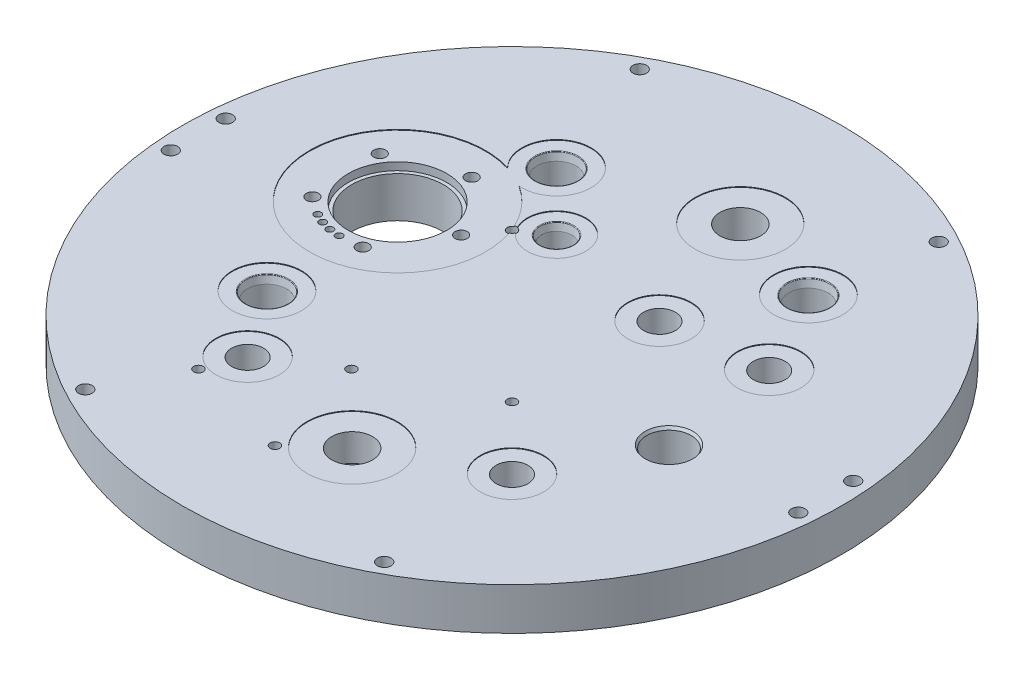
ISO-10303-21;
HEADER;
FILE_DESCRIPTION(('STEP AP214'),'2;1');
FILE_NAME('part.step','',(''),(''),'','','');
FILE_SCHEMA(('AUTOMOTIVE_DESIGN { 1 0 10303 214 1 1 1 1 }'));
ENDSEC;
DATA;
#1=APPLICATION_CONTEXT('core data for automotive mechanical design processes');
#2=APPLICATION_PROTOCOL_DEFINITION('international standard','automotive_design',2000,#1);
#3=PRODUCT_CONTEXT('',#1,'mechanical');
#4=PRODUCT('Part','Part','',(#3));
#5=PRODUCT_RELATED_PRODUCT_CATEGORY('part','',(#4));
#6=PRODUCT_DEFINITION_FORMATION('','',#4);
#7=PRODUCT_DEFINITION_CONTEXT('part definition',#1,'design');
#8=PRODUCT_DEFINITION('design','',#6,#7);
#9=PRODUCT_DEFINITION_SHAPE('','',#8);
#10=(LENGTH_UNIT() NAMED_UNIT(*) SI_UNIT(.MILLI.,.METRE.));
#11=(NAMED_UNIT(*) PLANE_ANGLE_UNIT() SI_UNIT($,.RADIAN.));
#12=(NAMED_UNIT(*) SI_UNIT($,.STERADIAN.) SOLID_ANGLE_UNIT());
#13=UNCERTAINTY_MEASURE_WITH_UNIT(LENGTH_MEASURE(1.E-05),#10,'distance_accuracy_value','');
#14=(GEOMETRIC_REPRESENTATION_CONTEXT(3) GLOBAL_UNCERTAINTY_ASSIGNED_CONTEXT((#13)) GLOBAL_UNIT_ASSIGNED_CONTEXT((#10,
#11,#12)) REPRESENTATION_CONTEXT('',''));
#15=CARTESIAN_POINT('',(0.,0.,0.));
#16=DIRECTION('',(0.,0.,1.));
#17=DIRECTION('',(1.,0.,0.));
#18=AXIS2_PLACEMENT_3D('',#15,#16,#17);
#19=CARTESIAN_POINT('',(-56.4293867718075,15.24,-15.1202086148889));
#20=DIRECTION('',(0.,1.,0.));
#21=DIRECTION('',(0.,0.,1.));
#22=AXIS2_PLACEMENT_3D('',#19,#20,#21);
#23=CYLINDRICAL_SURFACE('',#22,31.75);
#24=CARTESIAN_POINT('',(-56.4293867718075,14.986,-15.1202086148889));
#25=DIRECTION('',(0.,1.,0.));
#26=DIRECTION('',(0.,0.,1.));
#27=AXIS2_PLACEMENT_3D('',#24,#25,#26);
#28=CIRCLE('',#27,31.75);
#29=CARTESIAN_POINT('',(-27.644654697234,14.986,-28.518033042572));
#30=VERTEX_POINT('',#29);
#31=CARTESIAN_POINT('',(-39.2132447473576,14.986,-41.797295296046));
#32=VERTEX_POINT('',#31);
#33=EDGE_CURVE('E531',#30,#32,#28,.T.);
#34=ORIENTED_EDGE('',*,*,#33,.F.);
#35=DIRECTION('',(0.,1.,0.));
#36=VECTOR('',#35,1.);
#37=CARTESIAN_POINT('',(-27.644654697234,9.906,-28.518033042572));
#38=LINE('',#37,#36);
#39=CARTESIAN_POINT('',(-27.644654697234,15.24,-28.518033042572));
#40=VERTEX_POINT('',#39);
#41=EDGE_CURVE('E251',#30,#40,#38,.T.);
#42=ORIENTED_EDGE('',*,*,#41,.T.);
#43=CARTESIAN_POINT('',(-56.4293867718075,15.24,-15.1202086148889));
#44=DIRECTION('',(0.,1.,0.));
#45=DIRECTION('',(0.,0.,1.));
#46=AXIS2_PLACEMENT_3D('',#43,#44,#45);
#47=CIRCLE('',#46,31.75);
#48=CARTESIAN_POINT('',(-39.2132447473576,15.24,-41.797295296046));
#49=VERTEX_POINT('',#48);
#50=EDGE_CURVE('E532',#40,#49,#47,.T.);
#51=ORIENTED_EDGE('',*,*,#50,.T.);
#52=DIRECTION('',(0.,1.,0.));
#53=VECTOR('',#52,1.);
#54=CARTESIAN_POINT('',(-39.2132447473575,15.113,-41.797295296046));
#55=LINE('',#54,#53);
#56=EDGE_CURVE('E615',#49,#32,#55,.F.);
#57=ORIENTED_EDGE('',*,*,#56,.T.);
#58=EDGE_LOOP('',(#34,#42,#51,#57));
#59=FACE_BOUND('',#58,.T.);
#60=ADVANCED_FACE('F37',(#59),#23,.F.);
#61=CARTESIAN_POINT('',(-91.5970647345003,-2.54,0.));
#62=DIRECTION('',(0.,1.,0.));
#63=DIRECTION('',(0.,0.,1.));
#64=AXIS2_PLACEMENT_3D('',#61,#62,#63);
#65=PLANE('',#64);
#66=CARTESIAN_POINT('',(46.9134044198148,-2.54,-60.0464194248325));
#67=DIRECTION('',(0.,1.,0.));
#68=DIRECTION('',(0.,0.,1.));
#69=AXIS2_PLACEMENT_3D('',#66,#67,#68);
#70=CIRCLE('',#69,6.54811999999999);
#71=CARTESIAN_POINT('',(46.9134044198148,-2.54,-53.4982994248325));
#72=VERTEX_POINT('',#71);
#73=EDGE_CURVE('E278',#72,#72,#70,.T.);
#74=ORIENTED_EDGE('',*,*,#73,.T.);
#75=EDGE_LOOP('',(#74));
#76=FACE_BOUND('',#75,.T.);
#77=CARTESIAN_POINT('',(63.3055989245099,-2.54,-29.5198855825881));
#78=DIRECTION('',(0.,-1.,0.));
#79=DIRECTION('',(0.,0.,-1.));
#80=AXIS2_PLACEMENT_3D('',#77,#78,#79);
#81=CIRCLE('',#80,13.335);
#82=CARTESIAN_POINT('',(63.3055989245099,-2.54,-42.8548855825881));
#83=VERTEX_POINT('',#82);
#84=EDGE_CURVE('E307',#83,#83,#81,.T.);
#85=ORIENTED_EDGE('',*,*,#84,.F.);
#86=EDGE_LOOP('',(#85));
#87=FACE_BOUND('',#86,.T.);
#88=CARTESIAN_POINT('',(-34.9250000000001,-2.54,60.491874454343));
#89=DIRECTION('',(0.,-1.,0.));
#90=DIRECTION('',(0.,0.,-1.));
#91=AXIS2_PLACEMENT_3D('',#88,#89,#90);
#92=CIRCLE('',#91,13.335);
#93=CARTESIAN_POINT('',(-34.9250000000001,-2.54,47.156874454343));
#94=VERTEX_POINT('',#93);
#95=EDGE_CURVE('E316',#94,#94,#92,.T.);
#96=ORIENTED_EDGE('',*,*,#95,.F.);
#97=EDGE_LOOP('',(#96));
#98=FACE_BOUND('',#97,.T.);
#99=CARTESIAN_POINT('',(49.3914086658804,-2.54,49.3914086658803));
#100=DIRECTION('',(0.,-1.,0.));
#101=DIRECTION('',(0.,0.,-1.));
#102=AXIS2_PLACEMENT_3D('',#99,#100,#101);
#103=CIRCLE('',#102,13.335);
#104=CARTESIAN_POINT('',(49.3914086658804,-2.54,36.0564086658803));
#105=VERTEX_POINT('',#104);
#106=EDGE_CURVE('E324',#105,#105,#103,.T.);
#107=ORIENTED_EDGE('',*,*,#106,.F.);
#108=EDGE_LOOP('',(#107));
#109=FACE_BOUND('',#108,.T.);
#110=CARTESIAN_POINT('',(28.1650988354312,-2.54,-25.0673080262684));
#111=DIRECTION('',(0.,-1.,0.));
#112=DIRECTION('',(0.,0.,-1.));
#113=AXIS2_PLACEMENT_3D('',#110,#111,#112);
#114=CIRCLE('',#113,13.335);
#115=CARTESIAN_POINT('',(28.1650988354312,-2.54,-38.4023080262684));
#116=VERTEX_POINT('',#115);
#117=EDGE_CURVE('E333',#116,#116,#114,.T.);
#118=ORIENTED_EDGE('',*,*,#117,.F.);
#119=EDGE_LOOP('',(#118));
#120=FACE_BOUND('',#119,.T.);
#121=CARTESIAN_POINT('',(68.7888215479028,-2.54,12.1293252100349));
#122=DIRECTION('',(0.,-1.,0.));
#123=DIRECTION('',(0.,0.,-1.));
#124=AXIS2_PLACEMENT_3D('',#121,#122,#123);
#125=CIRCLE('',#124,15.875);
#126=CARTESIAN_POINT('',(68.7888215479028,-2.54,-3.74567478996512));
#127=VERTEX_POINT('',#126);
#128=EDGE_CURVE('E407',#127,#127,#125,.T.);
#129=ORIENTED_EDGE('',*,*,#128,.F.);
#130=EDGE_LOOP('',(#129));
#131=FACE_BOUND('',#130,.T.);
#132=CARTESIAN_POINT('',(0.174338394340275,-2.54,20.3878041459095));
#133=DIRECTION('',(0.,-1.,0.));
#134=DIRECTION('',(0.,0.,-1.));
#135=AXIS2_PLACEMENT_3D('',#132,#133,#134);
#136=CIRCLE('',#135,1.72719999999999);
#137=CARTESIAN_POINT('',(0.174338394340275,-2.54,18.6606041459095));
#138=VERTEX_POINT('',#137);
#139=EDGE_CURVE('E419',#138,#138,#136,.T.);
#140=ORIENTED_EDGE('',*,*,#139,.F.);
#141=EDGE_LOOP('',(#140));
#142=FACE_BOUND('',#141,.T.);
#143=CARTESIAN_POINT('',(-20.32,-2.54,0.));
#144=DIRECTION('',(0.,-1.,0.));
#145=DIRECTION('',(0.,0.,-1.));
#146=AXIS2_PLACEMENT_3D('',#143,#144,#145);
#147=CIRCLE('',#146,1.72719999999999);
#148=CARTESIAN_POINT('',(-20.32,-2.54,-1.72719999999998));
#149=VERTEX_POINT('',#148);
#150=EDGE_CURVE('E425',#149,#149,#147,.T.);
#151=ORIENTED_EDGE('',*,*,#150,.F.);
#152=EDGE_LOOP('',(#151));
#153=FACE_BOUND('',#152,.T.);
#154=CARTESIAN_POINT('',(0.,-2.54,33.0199999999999));
#155=DIRECTION('',(0.,-1.,0.));
#156=DIRECTION('',(0.,0.,-1.));
#157=AXIS2_PLACEMENT_3D('',#154,#155,#156);
#158=CIRCLE('',#157,1.72719999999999);
#159=CARTESIAN_POINT('',(0.,-2.54,31.2927999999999));
#160=VERTEX_POINT('',#159);
#161=EDGE_CURVE('E431',#160,#160,#158,.T.);
#162=ORIENTED_EDGE('',*,*,#161,.F.);
#163=EDGE_LOOP('',(#162));
#164=FACE_BOUND('',#163,.T.);
#165=CARTESIAN_POINT('',(-33.02,-2.54,0.));
#166=DIRECTION('',(0.,-1.,0.));
#167=DIRECTION('',(0.,0.,-1.));
#168=AXIS2_PLACEMENT_3D('',#165,#166,#167);
#169=CIRCLE('',#168,1.72719999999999);
#170=CARTESIAN_POINT('',(-33.02,-2.54,-1.72719999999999));
#171=VERTEX_POINT('',#170);
#172=EDGE_CURVE('E437',#171,#171,#169,.T.);
#173=ORIENTED_EDGE('',*,*,#172,.F.);
#174=EDGE_LOOP('',(#173));
#175=FACE_BOUND('',#174,.T.);
#176=CARTESIAN_POINT('',(0.,-2.54,-33.0199999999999));
#177=DIRECTION('',(0.,-1.,0.));
#178=DIRECTION('',(0.,0.,-1.));
#179=AXIS2_PLACEMENT_3D('',#176,#177,#178);
#180=CIRCLE('',#179,1.72719999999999);
#181=CARTESIAN_POINT('',(0.,-2.54,-34.7471999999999));
#182=VERTEX_POINT('',#181);
#183=EDGE_CURVE('E443',#182,#182,#180,.T.);
#184=ORIENTED_EDGE('',*,*,#183,.F.);
#185=EDGE_LOOP('',(#184));
#186=FACE_BOUND('',#185,.T.);
#187=CARTESIAN_POINT('',(0.174338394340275,-2.54,-20.3878041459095));
#188=DIRECTION('',(0.,-1.,0.));
#189=DIRECTION('',(0.,0.,-1.));
#190=AXIS2_PLACEMENT_3D('',#187,#188,#189);
#191=CIRCLE('',#190,1.72719999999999);
#192=CARTESIAN_POINT('',(0.174338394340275,-2.54,-22.1150041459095));
#193=VERTEX_POINT('',#192);
#194=EDGE_CURVE('E449',#193,#193,#191,.T.);
#195=ORIENTED_EDGE('',*,*,#194,.F.);
#196=EDGE_LOOP('',(#195));
#197=FACE_BOUND('',#196,.T.);
#198=CARTESIAN_POINT('',(-52.0161548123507,-2.54,36.4221037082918));
#199=DIRECTION('',(0.,1.,0.));
#200=DIRECTION('',(0.,0.,1.));
#201=AXIS2_PLACEMENT_3D('',#198,#199,#200);
#202=CIRCLE('',#201,6.54812);
#203=CARTESIAN_POINT('',(-52.0161548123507,-2.54,42.9702237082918));
#204=VERTEX_POINT('',#203);
#205=EDGE_CURVE('E479',#204,#204,#202,.T.);
#206=ORIENTED_EDGE('',*,*,#205,.T.);
#207=EDGE_LOOP('',(#206));
#208=FACE_BOUND('',#207,.T.);
#209=CARTESIAN_POINT('',(-17.2950165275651,-2.54,-33.3688651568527));
#210=DIRECTION('',(0.,1.,0.));
#211=DIRECTION('',(0.,0.,1.));
#212=AXIS2_PLACEMENT_3D('',#209,#210,#211);
#213=CIRCLE('',#212,4.96062);
#214=CARTESIAN_POINT('',(-17.2950165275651,-2.54,-28.4082451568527));
#215=VERTEX_POINT('',#214);
#216=EDGE_CURVE('E504',#215,#215,#213,.T.);
#217=ORIENTED_EDGE('',*,*,#216,.T.);
#218=EDGE_LOOP('',(#217));
#219=FACE_BOUND('',#218,.T.);
#220=CARTESIAN_POINT('',(-38.1807302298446,-2.54,-54.2545788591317));
#221=DIRECTION('',(0.,1.,0.));
#222=DIRECTION('',(0.,0.,1.));
#223=AXIS2_PLACEMENT_3D('',#220,#221,#222);
#224=CIRCLE('',#223,6.54811999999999);
#225=CARTESIAN_POINT('',(-38.1807302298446,-2.54,-47.7064588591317));
#226=VERTEX_POINT('',#225);
#227=EDGE_CURVE('E527',#226,#226,#224,.T.);
#228=ORIENTED_EDGE('',*,*,#227,.T.);
#229=EDGE_LOOP('',(#228));
#230=FACE_BOUND('',#229,.T.);
#231=CARTESIAN_POINT('',(-50.775743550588,-2.54,-36.2198923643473));
#232=DIRECTION('',(0.,1.,0.));
#233=DIRECTION('',(0.,0.,1.));
#234=AXIS2_PLACEMENT_3D('',#231,#232,#233);
#235=CIRCLE('',#234,2.19709999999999);
#236=CARTESIAN_POINT('',(-50.775743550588,-2.54,-34.0227923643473));
#237=VERTEX_POINT('',#236);
#238=EDGE_CURVE('E564',#237,#237,#235,.T.);
#239=ORIENTED_EDGE('',*,*,#238,.T.);
#240=EDGE_LOOP('',(#239));
#241=FACE_BOUND('',#240,.T.);
#242=CARTESIAN_POINT('',(-74.7493066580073,-2.54,-27.0173036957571));
#243=DIRECTION('',(0.,1.,0.));
#244=DIRECTION('',(0.,0.,1.));
#245=AXIS2_PLACEMENT_3D('',#242,#243,#244);
#246=CIRCLE('',#245,2.19709999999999);
#247=CARTESIAN_POINT('',(-74.7493066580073,-2.54,-24.8202036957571));
#248=VERTEX_POINT('',#247);
#249=EDGE_CURVE('E567',#248,#248,#246,.T.);
#250=ORIENTED_EDGE('',*,*,#249,.T.);
#251=EDGE_LOOP('',(#250));
#252=FACE_BOUND('',#251,.T.);
#253=CARTESIAN_POINT('',(-73.4053631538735,-2.54,-1.37333399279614));
#254=DIRECTION('',(0.,1.,0.));
#255=DIRECTION('',(0.,0.,1.));
#256=AXIS2_PLACEMENT_3D('',#253,#254,#255);
#257=CIRCLE('',#256,2.19709999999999);
#258=CARTESIAN_POINT('',(-73.4053631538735,-2.54,0.823766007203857));
#259=VERTEX_POINT('',#258);
#260=EDGE_CURVE('E570',#259,#259,#257,.T.);
#261=ORIENTED_EDGE('',*,*,#260,.T.);
#262=EDGE_LOOP('',(#261));
#263=FACE_BOUND('',#262,.T.);
#264=CARTESIAN_POINT('',(-48.60119728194,-2.54,5.27292222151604));
#265=DIRECTION('',(0.,1.,0.));
#266=DIRECTION('',(0.,0.,1.));
#267=AXIS2_PLACEMENT_3D('',#264,#265,#266);
#268=CIRCLE('',#267,2.19709999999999);
#269=CARTESIAN_POINT('',(-48.60119728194,-2.54,7.47002222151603));
#270=VERTEX_POINT('',#269);
#271=EDGE_CURVE('E573',#270,#270,#268,.T.);
#272=ORIENTED_EDGE('',*,*,#271,.T.);
#273=EDGE_LOOP('',(#272));
#274=FACE_BOUND('',#273,.T.);
#275=CARTESIAN_POINT('',(-34.6153232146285,-2.54,-16.2634352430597));
#276=DIRECTION('',(0.,1.,0.));
#277=DIRECTION('',(0.,0.,1.));
#278=AXIS2_PLACEMENT_3D('',#275,#276,#277);
#279=CIRCLE('',#278,2.19709999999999);
#280=CARTESIAN_POINT('',(-34.6153232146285,-2.54,-14.0663352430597));
#281=VERTEX_POINT('',#280);
#282=EDGE_CURVE('E576',#281,#281,#279,.T.);
#283=ORIENTED_EDGE('',*,*,#282,.T.);
#284=EDGE_LOOP('',(#283));
#285=FACE_BOUND('',#284,.T.);
#286=CARTESIAN_POINT('',(-66.9703867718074,-2.54,3.13733894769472));
#287=DIRECTION('',(0.,1.,0.));
#288=DIRECTION('',(0.,0.,1.));
#289=AXIS2_PLACEMENT_3D('',#286,#287,#288);
#290=CIRCLE('',#289,1.26999999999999);
#291=CARTESIAN_POINT('',(-66.9703867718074,-2.54,4.40733894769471));
#292=VERTEX_POINT('',#291);
#293=EDGE_CURVE('E579',#292,#292,#290,.T.);
#294=ORIENTED_EDGE('',*,*,#293,.T.);
#295=EDGE_LOOP('',(#294));
#296=FACE_BOUND('',#295,.T.);
#297=CARTESIAN_POINT('',(-63.6398554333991,-2.54,4.69039121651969));
#298=DIRECTION('',(0.,1.,0.));
#299=DIRECTION('',(0.,0.,1.));
#300=AXIS2_PLACEMENT_3D('',#297,#298,#299);
#301=CIRCLE('',#300,1.26999999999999);
#302=CARTESIAN_POINT('',(-63.6398554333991,-2.54,5.96039121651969));
#303=VERTEX_POINT('',#302);
#304=EDGE_CURVE('E582',#303,#303,#301,.T.);
#305=ORIENTED_EDGE('',*,*,#304,.T.);
#306=EDGE_LOOP('',(#305));
#307=FACE_BOUND('',#306,.T.);
#308=CARTESIAN_POINT('',(-60.0902376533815,-2.54,5.64150843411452));
#309=DIRECTION('',(0.,1.,0.));
#310=DIRECTION('',(0.,0.,1.));
#311=AXIS2_PLACEMENT_3D('',#308,#309,#310);
#312=CIRCLE('',#311,1.26999999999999);
#313=CARTESIAN_POINT('',(-60.0902376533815,-2.54,6.91150843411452));
#314=VERTEX_POINT('',#313);
#315=EDGE_CURVE('E585',#314,#314,#312,.T.);
#316=ORIENTED_EDGE('',*,*,#315,.T.);
#317=EDGE_LOOP('',(#316));
#318=FACE_BOUND('',#317,.T.);
#319=CARTESIAN_POINT('',(-56.4293867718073,-2.54,5.96179138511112));
#320=DIRECTION('',(0.,1.,0.));
#321=DIRECTION('',(0.,0.,1.));
#322=AXIS2_PLACEMENT_3D('',#319,#320,#321);
#323=CIRCLE('',#322,1.26999999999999);
#324=CARTESIAN_POINT('',(-56.4293867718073,-2.54,7.23179138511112));
#325=VERTEX_POINT('',#324);
#326=EDGE_CURVE('E588',#325,#325,#323,.T.);
#327=ORIENTED_EDGE('',*,*,#326,.T.);
#328=EDGE_LOOP('',(#327));
#329=FACE_BOUND('',#328,.T.);
#330=CARTESIAN_POINT('',(-56.4293867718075,-2.54,-15.1202086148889));
#331=DIRECTION('',(0.,1.,0.));
#332=DIRECTION('',(0.,0.,1.));
#333=AXIS2_PLACEMENT_3D('',#330,#331,#332);
#334=CIRCLE('',#333,16.51);
#335=CARTESIAN_POINT('',(-39.9193878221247,-2.54,-15.1260977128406));
#336=VERTEX_POINT('',#335);
#337=CARTESIAN_POINT('',(-40.267197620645,-2.54,-11.7491936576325));
#338=VERTEX_POINT('',#337);
#339=EDGE_CURVE('E597',#336,#338,#334,.T.);
#340=ORIENTED_EDGE('',*,*,#339,.T.);
#341=CARTESIAN_POINT('',(-40.4111525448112,-2.54,-13.4703841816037));
#342=DIRECTION('',(0.,-1.,0.));
#343=DIRECTION('',(0.,0.,-1.));
#344=AXIS2_PLACEMENT_3D('',#341,#342,#343);
#345=CIRCLE('',#344,1.72719999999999);
#346=EDGE_CURVE('E366',#336,#338,#345,.T.);
#347=ORIENTED_EDGE('',*,*,#346,.F.);
#348=EDGE_LOOP('',(#340,#347));
#349=FACE_BOUND('',#348,.T.);
#350=CARTESIAN_POINT('',(0.,-2.54,0.));
#351=DIRECTION('',(0.,-1.,0.));
#352=DIRECTION('',(0.,0.,-1.));
#353=AXIS2_PLACEMENT_3D('',#350,#351,#352);
#354=CIRCLE('',#353,91.5970647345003);
#355=CARTESIAN_POINT('',(0.,-2.54,-91.5970647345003));
#356=VERTEX_POINT('',#355);
#357=EDGE_CURVE('E600',#356,#356,#354,.T.);
#358=ORIENTED_EDGE('',*,*,#357,.T.);
#359=EDGE_LOOP('',(#358));
#360=FACE_BOUND('',#359,.T.);
#361=CARTESIAN_POINT('',(-60.9964109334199,-2.54,27.4418475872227));
#362=DIRECTION('',(0.,-1.,0.));
#363=DIRECTION('',(0.,0.,-1.));
#364=AXIS2_PLACEMENT_3D('',#361,#362,#363);
#365=CIRCLE('',#364,1.1303);
#366=CARTESIAN_POINT('',(-60.9964109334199,-2.54,26.3115475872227));
#367=VERTEX_POINT('',#366);
#368=EDGE_CURVE('E398',#367,#367,#365,.T.);
#369=ORIENTED_EDGE('',*,*,#368,.F.);
#370=EDGE_LOOP('',(#369));
#371=FACE_BOUND('',#370,.T.);
#372=CARTESIAN_POINT('',(43.3888215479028,-2.54,12.1293252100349));
#373=DIRECTION('',(0.,-1.,0.));
#374=DIRECTION('',(0.,0.,-1.));
#375=AXIS2_PLACEMENT_3D('',#372,#373,#374);
#376=CIRCLE('',#375,1.13029999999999);
#377=CARTESIAN_POINT('',(43.3888215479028,-2.54,10.9990252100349));
#378=VERTEX_POINT('',#377);
#379=EDGE_CURVE('E388',#378,#378,#376,.T.);
#380=ORIENTED_EDGE('',*,*,#379,.F.);
#381=EDGE_LOOP('',(#380));
#382=FACE_BOUND('',#381,.T.);
#383=CARTESIAN_POINT('',(13.4703841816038,-2.54,40.4111525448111));
#384=DIRECTION('',(0.,-1.,0.));
#385=DIRECTION('',(0.,0.,-1.));
#386=AXIS2_PLACEMENT_3D('',#383,#384,#385);
#387=CIRCLE('',#386,1.72719999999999);
#388=CARTESIAN_POINT('',(13.4703841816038,-2.54,38.6839525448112));
#389=VERTEX_POINT('',#388);
#390=EDGE_CURVE('E382',#389,#389,#387,.T.);
#391=ORIENTED_EDGE('',*,*,#390,.F.);
#392=EDGE_LOOP('',(#391));
#393=FACE_BOUND('',#392,.T.);
#394=CARTESIAN_POINT('',(40.4111525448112,-2.54,13.4703841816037));
#395=DIRECTION('',(0.,-1.,0.));
#396=DIRECTION('',(0.,0.,-1.));
#397=AXIS2_PLACEMENT_3D('',#394,#395,#396);
#398=CIRCLE('',#397,1.72719999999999);
#399=CARTESIAN_POINT('',(40.4111525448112,-2.54,11.7431841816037));
#400=VERTEX_POINT('',#399);
#401=EDGE_CURVE('E376',#400,#400,#398,.T.);
#402=ORIENTED_EDGE('',*,*,#401,.F.);
#403=EDGE_LOOP('',(#402));
#404=FACE_BOUND('',#403,.T.);
#405=CARTESIAN_POINT('',(-13.4703841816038,-2.54,-40.4111525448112));
#406=DIRECTION('',(0.,-1.,0.));
#407=DIRECTION('',(0.,0.,-1.));
#408=AXIS2_PLACEMENT_3D('',#405,#406,#407);
#409=CIRCLE('',#408,1.72719999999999);
#410=CARTESIAN_POINT('',(-13.4703841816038,-2.54,-42.1383525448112));
#411=VERTEX_POINT('',#410);
#412=EDGE_CURVE('E370',#411,#411,#409,.T.);
#413=ORIENTED_EDGE('',*,*,#412,.F.);
#414=EDGE_LOOP('',(#413));
#415=FACE_BOUND('',#414,.T.);
#416=CARTESIAN_POINT('',(12.3498583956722,-2.54,-70.0395273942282));
#417=DIRECTION('',(0.,1.,0.));
#418=DIRECTION('',(0.,0.,1.));
#419=AXIS2_PLACEMENT_3D('',#416,#417,#418);
#420=CIRCLE('',#419,7.34186999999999);
#421=CARTESIAN_POINT('',(12.3498583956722,-2.54,-62.6976573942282));
#422=VERTEX_POINT('',#421);
#423=EDGE_CURVE('E356',#422,#422,#420,.T.);
#424=ORIENTED_EDGE('',*,*,#423,.T.);
#425=EDGE_LOOP('',(#424));
#426=FACE_BOUND('',#425,.T.);
#427=CARTESIAN_POINT('',(12.3498583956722,-2.54,70.0395273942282));
#428=DIRECTION('',(0.,-1.,0.));
#429=DIRECTION('',(0.,0.,-1.));
#430=AXIS2_PLACEMENT_3D('',#427,#428,#429);
#431=CIRCLE('',#430,14.2875);
#432=CARTESIAN_POINT('',(12.3498583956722,-2.54,55.7520273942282));
#433=VERTEX_POINT('',#432);
#434=EDGE_CURVE('E342',#433,#433,#431,.T.);
#435=ORIENTED_EDGE('',*,*,#434,.F.);
#436=EDGE_LOOP('',(#435));
#437=FACE_BOUND('',#436,.T.);
#438=ADVANCED_FACE('F916',(#76,#87,#98,#109,#120,#131,#142,#153,#164,#175,#186,#197,#208,#219,
#230,#241,#252,#263,#274,#285,#296,#307,#318,#329,#349,#360,#371,#382,#393,#404,#415,#426,#437),
#65,.F.);
#439=CARTESIAN_POINT('',(0.,15.24,0.));
#440=DIRECTION('',(0.,-1.,0.));
#441=DIRECTION('',(0.,0.,-1.));
#442=AXIS2_PLACEMENT_3D('',#439,#440,#441);
#443=PLANE('',#442);
#444=CARTESIAN_POINT('',(113.232470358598,15.24,9.90655749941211));
#445=DIRECTION('',(0.,1.,0.));
#446=DIRECTION('',(0.,0.,1.));
#447=AXIS2_PLACEMENT_3D('',#444,#445,#446);
#448=CIRCLE('',#447,2.45744999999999);
#449=CARTESIAN_POINT('',(113.232470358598,15.24,12.3640074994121));
#450=VERTEX_POINT('',#449);
#451=EDGE_CURVE('E205',#450,#450,#448,.T.);
#452=ORIENTED_EDGE('',*,*,#451,.F.);
#453=EDGE_LOOP('',(#452));
#454=FACE_BOUND('',#453,.T.);
#455=CARTESIAN_POINT('',(113.232470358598,15.24,-9.90655749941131));
#456=DIRECTION('',(0.,1.,0.));
#457=DIRECTION('',(0.,0.,1.));
#458=AXIS2_PLACEMENT_3D('',#455,#456,#457);
#459=CIRCLE('',#458,2.45744999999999);
#460=CARTESIAN_POINT('',(113.232470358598,15.24,-7.44910749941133));
#461=VERTEX_POINT('',#460);
#462=EDGE_CURVE('E195',#461,#461,#459,.T.);
#463=ORIENTED_EDGE('',*,*,#462,.F.);
#464=EDGE_LOOP('',(#463));
#465=FACE_BOUND('',#464,.T.);
#466=CARTESIAN_POINT('',(53.9454510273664,15.24,-100.048091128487));
#467=DIRECTION('',(0.,1.,0.));
#468=DIRECTION('',(0.,0.,1.));
#469=AXIS2_PLACEMENT_3D('',#466,#467,#468);
#470=CIRCLE('',#469,2.45744999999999);
#471=CARTESIAN_POINT('',(53.9454510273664,15.24,-97.5906411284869));
#472=VERTEX_POINT('',#471);
#473=EDGE_CURVE('E192',#472,#472,#470,.T.);
#474=ORIENTED_EDGE('',*,*,#473,.F.);
#475=EDGE_LOOP('',(#474));
#476=FACE_BOUND('',#475,.T.);
#477=CARTESIAN_POINT('',(-53.945451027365,15.24,-100.048091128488));
#478=DIRECTION('',(0.,1.,0.));
#479=DIRECTION('',(0.,0.,1.));
#480=AXIS2_PLACEMENT_3D('',#477,#478,#479);
#481=CIRCLE('',#480,2.45744999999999);
#482=CARTESIAN_POINT('',(-53.945451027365,15.24,-97.5906411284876));
#483=VERTEX_POINT('',#482);
#484=EDGE_CURVE('E189',#483,#483,#481,.T.);
#485=ORIENTED_EDGE('',*,*,#484,.F.);
#486=EDGE_LOOP('',(#485));
#487=FACE_BOUND('',#486,.T.);
#488=CARTESIAN_POINT('',(-113.232470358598,15.24,-9.9065574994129));
#489=DIRECTION('',(0.,1.,0.));
#490=DIRECTION('',(0.,0.,1.));
#491=AXIS2_PLACEMENT_3D('',#488,#489,#490);
#492=CIRCLE('',#491,2.45744999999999);
#493=CARTESIAN_POINT('',(-113.232470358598,15.24,-7.44910749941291));
#494=VERTEX_POINT('',#493);
#495=EDGE_CURVE('E185',#494,#494,#492,.T.);
#496=ORIENTED_EDGE('',*,*,#495,.F.);
#497=EDGE_LOOP('',(#496));
#498=FACE_BOUND('',#497,.T.);
#499=CARTESIAN_POINT('',(-113.232470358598,15.24,9.90655749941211));
#500=DIRECTION('',(0.,1.,0.));
#501=DIRECTION('',(0.,0.,1.));
#502=AXIS2_PLACEMENT_3D('',#499,#500,#501);
#503=CIRCLE('',#502,2.45744999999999);
#504=CARTESIAN_POINT('',(-113.232470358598,15.24,12.3640074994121));
#505=VERTEX_POINT('',#504);
#506=EDGE_CURVE('E181',#505,#505,#503,.T.);
#507=ORIENTED_EDGE('',*,*,#506,.F.);
#508=EDGE_LOOP('',(#507));
#509=FACE_BOUND('',#508,.T.);
#510=CARTESIAN_POINT('',(-53.9454510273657,15.24,100.048091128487));
#511=DIRECTION('',(0.,1.,0.));
#512=DIRECTION('',(0.,0.,1.));
#513=AXIS2_PLACEMENT_3D('',#510,#511,#512);
#514=CIRCLE('',#513,2.45744999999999);
#515=CARTESIAN_POINT('',(-53.9454510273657,15.24,102.505541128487));
#516=VERTEX_POINT('',#515);
#517=EDGE_CURVE('E177',#516,#516,#514,.T.);
#518=ORIENTED_EDGE('',*,*,#517,.F.);
#519=EDGE_LOOP('',(#518));
#520=FACE_BOUND('',#519,.T.);
#521=CARTESIAN_POINT('',(53.9454510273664,15.24,100.048091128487));
#522=DIRECTION('',(0.,1.,0.));
#523=DIRECTION('',(0.,0.,1.));
#524=AXIS2_PLACEMENT_3D('',#521,#522,#523);
#525=CIRCLE('',#524,2.45744999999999);
#526=CARTESIAN_POINT('',(53.9454510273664,15.24,102.505541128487));
#527=VERTEX_POINT('',#526);
#528=EDGE_CURVE('E173',#527,#527,#525,.T.);
#529=ORIENTED_EDGE('',*,*,#528,.F.);
#530=EDGE_LOOP('',(#529));
#531=FACE_BOUND('',#530,.T.);
#532=CARTESIAN_POINT('',(-2.13855568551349,15.24,83.4098735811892));
#533=DIRECTION('',(0.,1.,0.));
#534=DIRECTION('',(0.,0.,1.));
#535=AXIS2_PLACEMENT_3D('',#532,#533,#534);
#536=CIRCLE('',#535,1.7272);
#537=CARTESIAN_POINT('',(-2.13855568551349,15.24,85.1370735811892));
#538=VERTEX_POINT('',#537);
#539=EDGE_CURVE('E172',#538,#538,#536,.T.);
#540=ORIENTED_EDGE('',*,*,#539,.F.);
#541=EDGE_LOOP('',(#540));
#542=FACE_BOUND('',#541,.T.);
#543=CARTESIAN_POINT('',(-39.8528932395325,15.24,73.3043472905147));
#544=DIRECTION('',(0.,1.,0.));
#545=DIRECTION('',(0.,0.,1.));
#546=AXIS2_PLACEMENT_3D('',#543,#544,#545);
#547=CIRCLE('',#546,1.7272);
#548=CARTESIAN_POINT('',(-39.8528932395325,15.24,75.0315472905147));
#549=VERTEX_POINT('',#548);
#550=EDGE_CURVE('E162',#549,#549,#547,.T.);
#551=ORIENTED_EDGE('',*,*,#550,.F.);
#552=EDGE_LOOP('',(#551));
#553=FACE_BOUND('',#552,.T.);
#554=CARTESIAN_POINT('',(-12.2440819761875,15.24,45.6955360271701));
#555=DIRECTION('',(0.,1.,0.));
#556=DIRECTION('',(0.,0.,1.));
#557=AXIS2_PLACEMENT_3D('',#554,#555,#556);
#558=CIRCLE('',#557,1.7272);
#559=CARTESIAN_POINT('',(-12.2440819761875,15.24,47.4227360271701));
#560=VERTEX_POINT('',#559);
#561=EDGE_CURVE('E226',#560,#560,#558,.T.);
#562=ORIENTED_EDGE('',*,*,#561,.F.);
#563=EDGE_LOOP('',(#562));
#564=FACE_BOUND('',#563,.T.);
#565=CARTESIAN_POINT('',(26.9407683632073,15.24,26.9407683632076));
#566=DIRECTION('',(0.,1.,0.));
#567=DIRECTION('',(0.,0.,1.));
#568=AXIS2_PLACEMENT_3D('',#565,#566,#567);
#569=CIRCLE('',#568,1.7272);
#570=CARTESIAN_POINT('',(26.9407683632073,15.24,28.6679683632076));
#571=VERTEX_POINT('',#570);
#572=EDGE_CURVE('E232',#571,#571,#569,.T.);
#573=ORIENTED_EDGE('',*,*,#572,.F.);
#574=EDGE_LOOP('',(#573));
#575=FACE_BOUND('',#574,.T.);
#576=CARTESIAN_POINT('',(46.9134044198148,15.24,-60.0464194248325));
#577=DIRECTION('',(0.,1.,0.));
#578=DIRECTION('',(0.,0.,1.));
#579=AXIS2_PLACEMENT_3D('',#576,#577,#578);
#580=CIRCLE('',#579,12.5);
#581=CARTESIAN_POINT('',(46.9134044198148,15.24,-47.5464194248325));
#582=VERTEX_POINT('',#581);
#583=EDGE_CURVE('E275',#582,#582,#580,.T.);
#584=ORIENTED_EDGE('',*,*,#583,.F.);
#585=EDGE_LOOP('',(#584));
#586=FACE_BOUND('',#585,.T.);
#587=CARTESIAN_POINT('',(63.3055989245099,15.24,-29.5198855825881));
#588=DIRECTION('',(0.,1.,0.));
#589=DIRECTION('',(0.,0.,1.));
#590=AXIS2_PLACEMENT_3D('',#587,#588,#589);
#591=CIRCLE('',#590,11.43);
#592=CARTESIAN_POINT('',(63.3055989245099,15.24,-18.0898855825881));
#593=VERTEX_POINT('',#592);
#594=EDGE_CURVE('E279',#593,#593,#591,.T.);
#595=ORIENTED_EDGE('',*,*,#594,.F.);
#596=EDGE_LOOP('',(#595));
#597=FACE_BOUND('',#596,.T.);
#598=CARTESIAN_POINT('',(-34.9250000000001,15.24,60.491874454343));
#599=DIRECTION('',(0.,1.,0.));
#600=DIRECTION('',(0.,0.,1.));
#601=AXIS2_PLACEMENT_3D('',#598,#599,#600);
#602=CIRCLE('',#601,11.43);
#603=CARTESIAN_POINT('',(-34.9250000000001,15.24,71.921874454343));
#604=VERTEX_POINT('',#603);
#605=EDGE_CURVE('E286',#604,#604,#602,.T.);
#606=ORIENTED_EDGE('',*,*,#605,.F.);
#607=EDGE_LOOP('',(#606));
#608=FACE_BOUND('',#607,.T.);
#609=CARTESIAN_POINT('',(28.1650988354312,15.24,-25.0673080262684));
#610=DIRECTION('',(0.,1.,0.));
#611=DIRECTION('',(0.,0.,1.));
#612=AXIS2_PLACEMENT_3D('',#609,#610,#611);
#613=CIRCLE('',#612,11.43);
#614=CARTESIAN_POINT('',(28.1650988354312,15.24,-13.6373080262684));
#615=VERTEX_POINT('',#614);
#616=EDGE_CURVE('E293',#615,#615,#613,.T.);
#617=ORIENTED_EDGE('',*,*,#616,.F.);
#618=EDGE_LOOP('',(#617));
#619=FACE_BOUND('',#618,.T.);
#620=CARTESIAN_POINT('',(49.3914086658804,15.24,49.3914086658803));
#621=DIRECTION('',(0.,1.,0.));
#622=DIRECTION('',(0.,0.,1.));
#623=AXIS2_PLACEMENT_3D('',#620,#621,#622);
#624=CIRCLE('',#623,11.43);
#625=CARTESIAN_POINT('',(49.3914086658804,15.24,60.8214086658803));
#626=VERTEX_POINT('',#625);
#627=EDGE_CURVE('E300',#626,#626,#624,.T.);
#628=ORIENTED_EDGE('',*,*,#627,.F.);
#629=EDGE_LOOP('',(#628));
#630=FACE_BOUND('',#629,.T.);
#631=CARTESIAN_POINT('',(12.3498583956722,15.24,-70.0395273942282));
#632=DIRECTION('',(0.,1.,0.));
#633=DIRECTION('',(0.,0.,1.));
#634=AXIS2_PLACEMENT_3D('',#631,#632,#633);
#635=CIRCLE('',#634,16.256);
#636=CARTESIAN_POINT('',(12.3498583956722,15.24,-53.7835273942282));
#637=VERTEX_POINT('',#636);
#638=EDGE_CURVE('E349',#637,#637,#635,.T.);
#639=ORIENTED_EDGE('',*,*,#638,.F.);
#640=EDGE_LOOP('',(#639));
#641=FACE_BOUND('',#640,.T.);
#642=CARTESIAN_POINT('',(12.3498583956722,15.24,70.0395273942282));
#643=DIRECTION('',(0.,1.,0.));
#644=DIRECTION('',(0.,0.,1.));
#645=AXIS2_PLACEMENT_3D('',#642,#643,#644);
#646=CIRCLE('',#645,16.256);
#647=CARTESIAN_POINT('',(12.3498583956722,15.24,86.2955273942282));
#648=VERTEX_POINT('',#647);
#649=EDGE_CURVE('E359',#648,#648,#646,.T.);
#650=ORIENTED_EDGE('',*,*,#649,.F.);
#651=EDGE_LOOP('',(#650));
#652=FACE_BOUND('',#651,.T.);
#653=CARTESIAN_POINT('',(68.7888215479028,15.24,12.1293252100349));
#654=DIRECTION('',(0.,-1.,0.));
#655=DIRECTION('',(0.,0.,-1.));
#656=AXIS2_PLACEMENT_3D('',#653,#654,#655);
#657=CIRCLE('',#656,8.606588);
#658=CARTESIAN_POINT('',(68.7888215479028,15.24,3.52273721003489));
#659=VERTEX_POINT('',#658);
#660=EDGE_CURVE('E404',#659,#659,#657,.T.);
#661=ORIENTED_EDGE('',*,*,#660,.T.);
#662=EDGE_LOOP('',(#661));
#663=FACE_BOUND('',#662,.T.);
#664=CARTESIAN_POINT('',(-52.0161548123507,15.24,36.4221037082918));
#665=DIRECTION('',(0.,1.,0.));
#666=DIRECTION('',(0.,0.,1.));
#667=AXIS2_PLACEMENT_3D('',#664,#665,#666);
#668=CIRCLE('',#667,12.5);
#669=CARTESIAN_POINT('',(-52.0161548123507,15.24,48.9221037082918));
#670=VERTEX_POINT('',#669);
#671=EDGE_CURVE('E476',#670,#670,#668,.T.);
#672=ORIENTED_EDGE('',*,*,#671,.F.);
#673=EDGE_LOOP('',(#672));
#674=FACE_BOUND('',#673,.T.);
#675=CARTESIAN_POINT('',(0.,15.24,0.));
#676=DIRECTION('',(0.,-1.,0.));
#677=DIRECTION('',(0.,0.,-1.));
#678=AXIS2_PLACEMENT_3D('',#675,#676,#677);
#679=CIRCLE('',#678,118.9355);
#680=CARTESIAN_POINT('',(0.,15.24,-118.9355));
#681=VERTEX_POINT('',#680);
#682=EDGE_CURVE('E612',#681,#681,#679,.T.);
#683=ORIENTED_EDGE('',*,*,#682,.F.);
#684=EDGE_LOOP('',(#683));
#685=FACE_BOUND('',#684,.T.);
#686=CARTESIAN_POINT('',(-17.2950165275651,15.24,-33.3688651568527));
#687=DIRECTION('',(0.,1.,0.));
#688=DIRECTION('',(0.,0.,1.));
#689=AXIS2_PLACEMENT_3D('',#686,#687,#688);
#690=CIRCLE('',#689,10.5);
#691=CARTESIAN_POINT('',(-25.2629738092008,15.24,-26.5306156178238));
#692=VERTEX_POINT('',#691);
#693=CARTESIAN_POINT('',(-26.6734762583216,15.24,-28.6471606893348));
#694=VERTEX_POINT('',#693);
#695=EDGE_CURVE('E501',#692,#694,#690,.T.);
#696=ORIENTED_EDGE('',*,*,#695,.F.);
#697=CARTESIAN_POINT('',(-26.9407683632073,15.24,-26.9407683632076));
#698=DIRECTION('',(0.,1.,0.));
#699=DIRECTION('',(0.,0.,1.));
#700=AXIS2_PLACEMENT_3D('',#697,#698,#699);
#701=CIRCLE('',#700,1.7272);
#702=CARTESIAN_POINT('',(-26.3603219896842,15.24,-25.3140225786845));
#703=VERTEX_POINT('',#702);
#704=EDGE_CURVE('E239',#703,#692,#701,.T.);
#705=ORIENTED_EDGE('',*,*,#704,.F.);
#706=CARTESIAN_POINT('',(-47.0598755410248,15.24,-45.4562393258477));
#707=VERTEX_POINT('',#706);
#708=EDGE_CURVE('E528',#707,#703,#47,.T.);
#709=ORIENTED_EDGE('',*,*,#708,.F.);
#710=CARTESIAN_POINT('',(-38.1807302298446,15.24,-54.2545788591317));
#711=DIRECTION('',(0.,1.,0.));
#712=DIRECTION('',(0.,0.,1.));
#713=AXIS2_PLACEMENT_3D('',#710,#711,#712);
#714=CIRCLE('',#713,12.5);
#715=EDGE_CURVE('E525',#49,#707,#714,.T.);
#716=ORIENTED_EDGE('',*,*,#715,.F.);
#717=ORIENTED_EDGE('',*,*,#50,.F.);
#718=EDGE_CURVE('E238',#694,#40,#701,.T.);
#719=ORIENTED_EDGE('',*,*,#718,.F.);
#720=EDGE_LOOP('',(#696,#705,#709,#716,#717,#719));
#721=FACE_BOUND('',#720,.T.);
#722=ADVANCED_FACE('F39',(#454,#465,#476,#487,#498,#509,#520,#531,#542,#553,#564,#575,#586,#597,
#608,#619,#630,#641,#652,#663,#674,#685,#721),#443,.F.);
#723=CARTESIAN_POINT('',(0.,0.,0.));
#724=DIRECTION('',(0.,-1.,0.));
#725=DIRECTION('',(0.,0.,-1.));
#726=AXIS2_PLACEMENT_3D('',#723,#724,#725);
#727=CYLINDRICAL_SURFACE('',#726,118.9355);
#728=CARTESIAN_POINT('',(0.,0.,0.));
#729=DIRECTION('',(0.,-1.,0.));
#730=DIRECTION('',(0.,0.,-1.));
#731=AXIS2_PLACEMENT_3D('',#728,#729,#730);
#732=CIRCLE('',#731,118.9355);
#733=CARTESIAN_POINT('',(0.,0.,-118.9355));
#734=VERTEX_POINT('',#733);
#735=EDGE_CURVE('E609',#734,#734,#732,.T.);
#736=ORIENTED_EDGE('',*,*,#735,.F.);
#737=EDGE_LOOP('',(#736));
#738=FACE_BOUND('',#737,.T.);
#739=ORIENTED_EDGE('',*,*,#682,.T.);
#740=EDGE_LOOP('',(#739));
#741=FACE_BOUND('',#740,.T.);
#742=ADVANCED_FACE('F2066',(#738,#741),#727,.T.);
#743=CARTESIAN_POINT('',(-118.9355,0.,0.));
#744=DIRECTION('',(0.,1.,0.));
#745=DIRECTION('',(0.,0.,1.));
#746=AXIS2_PLACEMENT_3D('',#743,#744,#745);
#747=PLANE('',#746);
#748=CARTESIAN_POINT('',(113.232470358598,0.,9.90655749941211));
#749=DIRECTION('',(0.,1.,0.));
#750=DIRECTION('',(0.,0.,1.));
#751=AXIS2_PLACEMENT_3D('',#748,#749,#750);
#752=CIRCLE('',#751,2.45744999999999);
#753=CARTESIAN_POINT('',(113.232470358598,0.,12.3640074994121));
#754=VERTEX_POINT('',#753);
#755=EDGE_CURVE('E41',#754,#754,#752,.T.);
#756=ORIENTED_EDGE('',*,*,#755,.T.);
#757=EDGE_LOOP('',(#756));
#758=FACE_BOUND('',#757,.T.);
#759=CARTESIAN_POINT('',(113.232470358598,0.,-9.90655749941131));
#760=DIRECTION('',(0.,1.,0.));
#761=DIRECTION('',(0.,0.,1.));
#762=AXIS2_PLACEMENT_3D('',#759,#760,#761);
#763=CIRCLE('',#762,2.45744999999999);
#764=CARTESIAN_POINT('',(113.232470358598,0.,-7.44910749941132));
#765=VERTEX_POINT('',#764);
#766=EDGE_CURVE('E193',#765,#765,#763,.T.);
#767=ORIENTED_EDGE('',*,*,#766,.T.);
#768=EDGE_LOOP('',(#767));
#769=FACE_BOUND('',#768,.T.);
#770=CARTESIAN_POINT('',(53.9454510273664,0.,-100.048091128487));
#771=DIRECTION('',(0.,1.,0.));
#772=DIRECTION('',(0.,0.,1.));
#773=AXIS2_PLACEMENT_3D('',#770,#771,#772);
#774=CIRCLE('',#773,2.45744999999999);
#775=CARTESIAN_POINT('',(53.9454510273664,0.,-97.5906411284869));
#776=VERTEX_POINT('',#775);
#777=EDGE_CURVE('E190',#776,#776,#774,.T.);
#778=ORIENTED_EDGE('',*,*,#777,.T.);
#779=EDGE_LOOP('',(#778));
#780=FACE_BOUND('',#779,.T.);
#781=CARTESIAN_POINT('',(-53.945451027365,0.,-100.048091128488));
#782=DIRECTION('',(0.,1.,0.));
#783=DIRECTION('',(0.,0.,1.));
#784=AXIS2_PLACEMENT_3D('',#781,#782,#783);
#785=CIRCLE('',#784,2.45744999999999);
#786=CARTESIAN_POINT('',(-53.945451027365,0.,-97.5906411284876));
#787=VERTEX_POINT('',#786);
#788=EDGE_CURVE('E186',#787,#787,#785,.T.);
#789=ORIENTED_EDGE('',*,*,#788,.T.);
#790=EDGE_LOOP('',(#789));
#791=FACE_BOUND('',#790,.T.);
#792=CARTESIAN_POINT('',(-113.232470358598,0.,-9.9065574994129));
#793=DIRECTION('',(0.,1.,0.));
#794=DIRECTION('',(0.,0.,1.));
#795=AXIS2_PLACEMENT_3D('',#792,#793,#794);
#796=CIRCLE('',#795,2.45744999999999);
#797=CARTESIAN_POINT('',(-113.232470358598,0.,-7.4491074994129));
#798=VERTEX_POINT('',#797);
#799=EDGE_CURVE('E182',#798,#798,#796,.T.);
#800=ORIENTED_EDGE('',*,*,#799,.T.);
#801=EDGE_LOOP('',(#800));
#802=FACE_BOUND('',#801,.T.);
#803=CARTESIAN_POINT('',(-113.232470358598,0.,9.90655749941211));
#804=DIRECTION('',(0.,1.,0.));
#805=DIRECTION('',(0.,0.,1.));
#806=AXIS2_PLACEMENT_3D('',#803,#804,#805);
#807=CIRCLE('',#806,2.45744999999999);
#808=CARTESIAN_POINT('',(-113.232470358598,0.,12.3640074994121));
#809=VERTEX_POINT('',#808);
#810=EDGE_CURVE('E178',#809,#809,#807,.T.);
#811=ORIENTED_EDGE('',*,*,#810,.T.);
#812=EDGE_LOOP('',(#811));
#813=FACE_BOUND('',#812,.T.);
#814=CARTESIAN_POINT('',(-53.9454510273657,0.,100.048091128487));
#815=DIRECTION('',(0.,1.,0.));
#816=DIRECTION('',(0.,0.,1.));
#817=AXIS2_PLACEMENT_3D('',#814,#815,#816);
#818=CIRCLE('',#817,2.45744999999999);
#819=CARTESIAN_POINT('',(-53.9454510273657,0.,102.505541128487));
#820=VERTEX_POINT('',#819);
#821=EDGE_CURVE('E174',#820,#820,#818,.T.);
#822=ORIENTED_EDGE('',*,*,#821,.T.);
#823=EDGE_LOOP('',(#822));
#824=FACE_BOUND('',#823,.T.);
#825=CARTESIAN_POINT('',(53.9454510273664,0.,100.048091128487));
#826=DIRECTION('',(0.,1.,0.));
#827=DIRECTION('',(0.,0.,1.));
#828=AXIS2_PLACEMENT_3D('',#825,#826,#827);
#829=CIRCLE('',#828,2.45744999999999);
#830=CARTESIAN_POINT('',(53.9454510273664,0.,102.505541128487));
#831=VERTEX_POINT('',#830);
#832=EDGE_CURVE('E169',#831,#831,#829,.T.);
#833=ORIENTED_EDGE('',*,*,#832,.T.);
#834=EDGE_LOOP('',(#833));
#835=FACE_BOUND('',#834,.T.);
#836=CARTESIAN_POINT('',(94.1888215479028,0.,12.1293252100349));
#837=DIRECTION('',(0.,1.,0.));
#838=DIRECTION('',(0.,0.,1.));
#839=AXIS2_PLACEMENT_3D('',#836,#837,#838);
#840=CIRCLE('',#839,1.13029999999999);
#841=CARTESIAN_POINT('',(94.1888215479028,0.,13.2596252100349));
#842=VERTEX_POINT('',#841);
#843=EDGE_CURVE('E397',#842,#842,#840,.T.);
#844=ORIENTED_EDGE('',*,*,#843,.T.);
#845=EDGE_LOOP('',(#844));
#846=FACE_BOUND('',#845,.T.);
#847=CARTESIAN_POINT('',(0.,0.,0.));
#848=DIRECTION('',(0.,-1.,0.));
#849=DIRECTION('',(0.,0.,-1.));
#850=AXIS2_PLACEMENT_3D('',#847,#848,#849);
#851=CIRCLE('',#850,91.8210000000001);
#852=CARTESIAN_POINT('',(0.,0.,-91.8210000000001));
#853=VERTEX_POINT('',#852);
#854=EDGE_CURVE('E606',#853,#853,#851,.T.);
#855=ORIENTED_EDGE('',*,*,#854,.F.);
#856=EDGE_LOOP('',(#855));
#857=FACE_BOUND('',#856,.T.);
#858=ORIENTED_EDGE('',*,*,#735,.T.);
#859=EDGE_LOOP('',(#858));
#860=FACE_BOUND('',#859,.T.);
#861=ADVANCED_FACE('F2058',(#758,#769,#780,#791,#802,#813,#824,#835,#846,#857,#860),#747,.F.);
#862=CARTESIAN_POINT('',(0.,0.,0.));
#863=DIRECTION('',(0.,-1.,0.));
#864=DIRECTION('',(0.,0.,-1.));
#865=AXIS2_PLACEMENT_3D('',#862,#863,#864);
#866=CYLINDRICAL_SURFACE('',#865,91.8210000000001);
#867=CARTESIAN_POINT('',(0.,-1.27,0.));
#868=DIRECTION('',(0.,-1.,0.));
#869=DIRECTION('',(0.,0.,-1.));
#870=AXIS2_PLACEMENT_3D('',#867,#868,#869);
#871=CIRCLE('',#870,91.8210000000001);
#872=CARTESIAN_POINT('',(0.,-1.27,-91.8210000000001));
#873=VERTEX_POINT('',#872);
#874=EDGE_CURVE('E603',#873,#873,#871,.T.);
#875=ORIENTED_EDGE('',*,*,#874,.F.);
#876=EDGE_LOOP('',(#875));
#877=FACE_BOUND('',#876,.T.);
#878=ORIENTED_EDGE('',*,*,#854,.T.);
#879=EDGE_LOOP('',(#878));
#880=FACE_BOUND('',#879,.T.);
#881=ADVANCED_FACE('F2048',(#877,#880),#866,.T.);
#882=CARTESIAN_POINT('',(0.,-1.27,0.));
#883=DIRECTION('',(0.,1.,0.));
#884=DIRECTION('',(0.,0.,1.));
#885=AXIS2_PLACEMENT_3D('',#882,#883,#884);
#886=CONICAL_SURFACE('',#885,91.8210000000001,0.174532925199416);
#887=ORIENTED_EDGE('',*,*,#357,.F.);
#888=EDGE_LOOP('',(#887));
#889=FACE_BOUND('',#888,.T.);
#890=ORIENTED_EDGE('',*,*,#874,.T.);
#891=EDGE_LOOP('',(#890));
#892=FACE_BOUND('',#891,.T.);
#893=ADVANCED_FACE('F911',(#889,#892),#886,.T.);
#894=CARTESIAN_POINT('',(-56.4293867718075,15.24,-15.1202086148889));
#895=DIRECTION('',(0.,1.,0.));
#896=DIRECTION('',(0.,0.,1.));
#897=AXIS2_PLACEMENT_3D('',#894,#895,#896);
#898=CYLINDRICAL_SURFACE('',#897,16.51);
#899=ORIENTED_EDGE('',*,*,#339,.F.);
#900=DIRECTION('',(0.,-1.,0.));
#901=VECTOR('',#900,1.);
#902=CARTESIAN_POINT('',(-39.9193878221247,1.905,-15.1260977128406));
#903=LINE('',#902,#901);
#904=CARTESIAN_POINT('',(-39.9193878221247,6.35,-15.1260977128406));
#905=VERTEX_POINT('',#904);
#906=EDGE_CURVE('E940',#336,#905,#903,.F.);
#907=ORIENTED_EDGE('',*,*,#906,.T.);
#908=CARTESIAN_POINT('',(-39.9193879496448,6.3498,-15.1264449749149));
#909=CARTESIAN_POINT('',(-39.919360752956,6.3926980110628,-15.0519239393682));
#910=CARTESIAN_POINT('',(-39.9198362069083,6.43551456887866,-14.9773542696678));
#911=CARTESIAN_POINT('',(-39.9218034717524,6.52080863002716,-14.8280096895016));
#912=CARTESIAN_POINT('',(-39.9232955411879,6.56328604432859,-14.7532347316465));
#913=CARTESIAN_POINT('',(-39.9272964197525,6.64747853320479,-14.6038089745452));
#914=CARTESIAN_POINT('',(-39.9297997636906,6.68919646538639,-14.5291596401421));
#915=CARTESIAN_POINT('',(-39.9358445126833,6.77172064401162,-14.3794088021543));
#916=CARTESIAN_POINT('',(-39.9393857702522,6.81252701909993,-14.3043073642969));
#917=CARTESIAN_POINT('',(-39.9454220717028,6.87151232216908,-14.1926787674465));
#918=CARTESIAN_POINT('',(-39.9474974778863,6.89037747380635,-14.1564921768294));
#919=CARTESIAN_POINT('',(-39.9519072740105,6.92751440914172,-14.0838228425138));
#920=CARTESIAN_POINT('',(-39.9542417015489,6.94578610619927,-14.0473400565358));
#921=CARTESIAN_POINT('',(-39.9591997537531,6.98155103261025,-13.9737318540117));
#922=CARTESIAN_POINT('',(-39.9618250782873,6.99903874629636,-13.9366038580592));
#923=CARTESIAN_POINT('',(-39.9673772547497,7.03260727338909,-13.8617364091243));
#924=CARTESIAN_POINT('',(-39.9703040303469,7.04868844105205,-13.8239971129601));
#925=CARTESIAN_POINT('',(-39.9753387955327,7.07294753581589,-13.7619083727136));
#926=CARTESIAN_POINT('',(-39.9773436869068,7.08183209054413,-13.7378292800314));
#927=CARTESIAN_POINT('',(-39.9814986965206,7.09833556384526,-13.6892394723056));
#928=CARTESIAN_POINT('',(-39.9836488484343,7.10595418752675,-13.6647286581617));
#929=CARTESIAN_POINT('',(-39.9880779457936,7.11937569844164,-13.6155270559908));
#930=CARTESIAN_POINT('',(-39.9903550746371,7.12519892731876,-13.5908417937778));
#931=CARTESIAN_POINT('',(-39.9950613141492,7.13461110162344,-13.5410726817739));
#932=CARTESIAN_POINT('',(-39.9974902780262,7.13820216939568,-13.5159892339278));
#933=CARTESIAN_POINT('',(-40.002537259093,7.14274292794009,-13.4651012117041));
#934=CARTESIAN_POINT('',(-40.0051580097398,7.14364060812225,-13.4392920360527));
#935=CARTESIAN_POINT('',(-40.0105143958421,7.1425053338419,-13.3877533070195));
#936=CARTESIAN_POINT('',(-40.013250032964,7.14047233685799,-13.3620237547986));
#937=CARTESIAN_POINT('',(-40.0188335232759,7.13374517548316,-13.3106456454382));
#938=CARTESIAN_POINT('',(-40.0216822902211,7.12902145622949,-13.2850012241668));
#939=CARTESIAN_POINT('',(-40.0274434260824,7.11745163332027,-13.2342052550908));
#940=CARTESIAN_POINT('',(-40.0303558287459,7.11060437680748,-13.2090539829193));
#941=CARTESIAN_POINT('',(-40.0378463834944,7.09118322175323,-13.1456173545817));
#942=CARTESIAN_POINT('',(-40.0424641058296,7.07752581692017,-13.1076748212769));
#943=CARTESIAN_POINT('',(-40.0518491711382,7.0479792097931,-13.0326761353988));
#944=CARTESIAN_POINT('',(-40.0566166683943,7.03208764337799,-12.9956209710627));
#945=CARTESIAN_POINT('',(-40.0663285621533,6.99889740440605,-12.9220720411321));
#946=CARTESIAN_POINT('',(-40.0712733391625,6.98159558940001,-12.8855797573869));
#947=CARTESIAN_POINT('',(-40.0813449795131,6.94610476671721,-12.8130525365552));
#948=CARTESIAN_POINT('',(-40.0864718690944,6.92791563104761,-12.7770176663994));
#949=CARTESIAN_POINT('',(-40.102198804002,6.87227808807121,-12.6690146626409));
#950=CARTESIAN_POINT('',(-40.1130925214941,6.83394785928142,-12.5975453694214));
#951=CARTESIAN_POINT('',(-40.1356918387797,6.75620359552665,-12.4554827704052));
#952=CARTESIAN_POINT('',(-40.1473961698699,6.71679130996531,-12.3848882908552));
#953=CARTESIAN_POINT('',(-40.1677607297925,6.65005900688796,-12.2667955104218));
#954=CARTESIAN_POINT('',(-40.1761922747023,6.62291790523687,-12.2191565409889));
#955=CARTESIAN_POINT('',(-40.1934542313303,6.56840471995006,-12.1240558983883));
#956=CARTESIAN_POINT('',(-40.2022848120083,6.54103254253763,-12.0765943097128));
#957=CARTESIAN_POINT('',(-40.2202513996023,6.48640998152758,-11.9823256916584));
#958=CARTESIAN_POINT('',(-40.2293833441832,6.45916122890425,-11.9355169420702));
#959=CARTESIAN_POINT('',(-40.2480344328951,6.40455555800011,-11.8420681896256));
#960=CARTESIAN_POINT('',(-40.2575534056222,6.37719869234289,-11.7954281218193));
#961=CARTESIAN_POINT('',(-40.2672685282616,6.34979999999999,-11.7488537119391));
#962=B_SPLINE_CURVE_WITH_KNOTS('',3,(#908,#909,#910,#911,#912,#913,#914,#915,#916,#917,#918,
#919,#920,#921,#922,#923,#924,#925,#926,#927,#928,#929,#930,#931,#932,#933,#934,#935,#936,#937,
#938,#939,#940,#941,#942,#943,#944,#945,#946,#947,#948,#949,#950,#951,#952,#953,#954,#955,#956,
#957,#958,#959,#960,#961),.UNSPECIFIED.,.F.,.F.,(4,2,2,2,2,2,2,2,2,2,2,2,2,2,2,2,2,2,2,2,2,2,2,
2,2,2,4),(0.,0.257959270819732,0.515984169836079,0.772632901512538,1.0292451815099,
1.15182600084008,1.27442463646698,1.39778177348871,1.52110775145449,1.59831534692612,
1.67554090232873,1.75185629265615,1.82809901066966,1.90580483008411,1.98351177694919,
2.06208918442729,2.14070932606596,2.26234386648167,2.38410809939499,2.50615149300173,
2.6282125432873,2.87366201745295,3.11873565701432,3.28515081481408,3.45163710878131,
3.61641556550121,3.78112182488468),.UNSPECIFIED.);
#963=CARTESIAN_POINT('',(-40.267197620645,6.35,-11.7491936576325));
#964=VERTEX_POINT('',#963);
#965=EDGE_CURVE('E623',#905,#964,#962,.T.);
#966=ORIENTED_EDGE('',*,*,#965,.T.);
#967=DIRECTION('',(0.,-1.,0.));
#968=VECTOR('',#967,1.);
#969=CARTESIAN_POINT('',(-40.267197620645,1.905,-11.7491936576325));
#970=LINE('',#969,#968);
#971=EDGE_CURVE('E639',#964,#338,#970,.T.);
#972=ORIENTED_EDGE('',*,*,#971,.T.);
#973=EDGE_LOOP('',(#899,#907,#966,#972));
#974=FACE_BOUND('',#973,.T.);
#975=CARTESIAN_POINT('',(-56.4293867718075,12.192,-15.1202086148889));
#976=DIRECTION('',(0.,1.,0.));
#977=DIRECTION('',(0.,0.,1.));
#978=AXIS2_PLACEMENT_3D('',#975,#976,#977);
#979=CIRCLE('',#978,16.51);
#980=CARTESIAN_POINT('',(-56.4293867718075,12.192,1.38979138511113));
#981=VERTEX_POINT('',#980);
#982=EDGE_CURVE('E594',#981,#981,#979,.T.);
#983=ORIENTED_EDGE('',*,*,#982,.T.);
#984=EDGE_LOOP('',(#983));
#985=FACE_BOUND('',#984,.T.);
#986=ADVANCED_FACE('F641',(#974,#985),#898,.F.);
#987=CARTESIAN_POINT('',(-39.9193867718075,12.192,-15.1202086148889));
#988=DIRECTION('',(0.,-1.,0.));
#989=DIRECTION('',(0.,0.,-1.));
#990=AXIS2_PLACEMENT_3D('',#987,#988,#989);
#991=PLANE('',#990);
#992=ORIENTED_EDGE('',*,*,#982,.F.);
#993=EDGE_LOOP('',(#992));
#994=FACE_BOUND('',#993,.T.);
#995=CARTESIAN_POINT('',(-56.4293867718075,12.192,-15.1202086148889));
#996=DIRECTION('',(0.,1.,0.));
#997=DIRECTION('',(0.,0.,1.));
#998=AXIS2_PLACEMENT_3D('',#995,#996,#997);
#999=CIRCLE('',#998,17.78);
#1000=CARTESIAN_POINT('',(-56.4293867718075,12.192,2.65979138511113));
#1001=VERTEX_POINT('',#1000);
#1002=EDGE_CURVE('E591',#1001,#1001,#999,.T.);
#1003=ORIENTED_EDGE('',*,*,#1002,.T.);
#1004=EDGE_LOOP('',(#1003));
#1005=FACE_BOUND('',#1004,.T.);
#1006=ADVANCED_FACE('F904',(#994,#1005),#991,.F.);
#1007=CARTESIAN_POINT('',(-56.4293867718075,15.24,-15.1202086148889));
#1008=DIRECTION('',(0.,1.,0.));
#1009=DIRECTION('',(0.,0.,1.));
#1010=AXIS2_PLACEMENT_3D('',#1007,#1008,#1009);
#1011=CYLINDRICAL_SURFACE('',#1010,17.78);
#1012=CARTESIAN_POINT('',(-56.4293867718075,14.986,-15.1202086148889));
#1013=DIRECTION('',(0.,-1.,0.));
#1014=DIRECTION('',(0.,0.,-1.));
#1015=AXIS2_PLACEMENT_3D('',#1012,#1013,#1014);
#1016=CIRCLE('',#1015,17.78);
#1017=CARTESIAN_POINT('',(-56.4293867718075,14.986,-32.9002086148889));
#1018=VERTEX_POINT('',#1017);
#1019=EDGE_CURVE('E561',#1018,#1018,#1016,.F.);
#1020=ORIENTED_EDGE('',*,*,#1019,.T.);
#1021=EDGE_LOOP('',(#1020));
#1022=FACE_BOUND('',#1021,.T.);
#1023=ORIENTED_EDGE('',*,*,#1002,.F.);
#1024=EDGE_LOOP('',(#1023));
#1025=FACE_BOUND('',#1024,.T.);
#1026=ADVANCED_FACE('F901',(#1022,#1025),#1011,.F.);
#1027=CARTESIAN_POINT('',(-56.4293867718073,15.24,5.96179138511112));
#1028=DIRECTION('',(0.,1.,0.));
#1029=DIRECTION('',(0.,0.,1.));
#1030=AXIS2_PLACEMENT_3D('',#1027,#1028,#1029);
#1031=CYLINDRICAL_SURFACE('',#1030,1.27);
#1032=CARTESIAN_POINT('',(-56.4293867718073,14.986,5.96179138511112));
#1033=DIRECTION('',(0.,-1.,0.));
#1034=DIRECTION('',(0.,0.,-1.));
#1035=AXIS2_PLACEMENT_3D('',#1032,#1033,#1034);
#1036=CIRCLE('',#1035,1.27);
#1037=CARTESIAN_POINT('',(-56.4293867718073,14.986,4.69179138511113));
#1038=VERTEX_POINT('',#1037);
#1039=EDGE_CURVE('E558',#1038,#1038,#1036,.F.);
#1040=ORIENTED_EDGE('',*,*,#1039,.T.);
#1041=EDGE_LOOP('',(#1040));
#1042=FACE_BOUND('',#1041,.T.);
#1043=ORIENTED_EDGE('',*,*,#326,.F.);
#1044=EDGE_LOOP('',(#1043));
#1045=FACE_BOUND('',#1044,.T.);
#1046=ADVANCED_FACE('F897',(#1042,#1045),#1031,.F.);
#1047=CARTESIAN_POINT('',(-60.0902376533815,15.24,5.64150843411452));
#1048=DIRECTION('',(0.,1.,0.));
#1049=DIRECTION('',(0.,0.,1.));
#1050=AXIS2_PLACEMENT_3D('',#1047,#1048,#1049);
#1051=CYLINDRICAL_SURFACE('',#1050,1.27);
#1052=CARTESIAN_POINT('',(-60.0902376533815,14.986,5.64150843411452));
#1053=DIRECTION('',(0.,-1.,0.));
#1054=DIRECTION('',(0.,0.,-1.));
#1055=AXIS2_PLACEMENT_3D('',#1052,#1053,#1054);
#1056=CIRCLE('',#1055,1.27);
#1057=CARTESIAN_POINT('',(-60.0902376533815,14.986,4.37150843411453));
#1058=VERTEX_POINT('',#1057);
#1059=EDGE_CURVE('E555',#1058,#1058,#1056,.F.);
#1060=ORIENTED_EDGE('',*,*,#1059,.T.);
#1061=EDGE_LOOP('',(#1060));
#1062=FACE_BOUND('',#1061,.T.);
#1063=ORIENTED_EDGE('',*,*,#315,.F.);
#1064=EDGE_LOOP('',(#1063));
#1065=FACE_BOUND('',#1064,.T.);
#1066=ADVANCED_FACE('F893',(#1062,#1065),#1051,.F.);
#1067=CARTESIAN_POINT('',(-63.6398554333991,15.24,4.69039121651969));
#1068=DIRECTION('',(0.,1.,0.));
#1069=DIRECTION('',(0.,0.,1.));
#1070=AXIS2_PLACEMENT_3D('',#1067,#1068,#1069);
#1071=CYLINDRICAL_SURFACE('',#1070,1.27);
#1072=CARTESIAN_POINT('',(-63.6398554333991,14.986,4.69039121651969));
#1073=DIRECTION('',(0.,-1.,0.));
#1074=DIRECTION('',(0.,0.,-1.));
#1075=AXIS2_PLACEMENT_3D('',#1072,#1073,#1074);
#1076=CIRCLE('',#1075,1.27);
#1077=CARTESIAN_POINT('',(-63.6398554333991,14.986,3.4203912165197));
#1078=VERTEX_POINT('',#1077);
#1079=EDGE_CURVE('E552',#1078,#1078,#1076,.F.);
#1080=ORIENTED_EDGE('',*,*,#1079,.T.);
#1081=EDGE_LOOP('',(#1080));
#1082=FACE_BOUND('',#1081,.T.);
#1083=ORIENTED_EDGE('',*,*,#304,.F.);
#1084=EDGE_LOOP('',(#1083));
#1085=FACE_BOUND('',#1084,.T.);
#1086=ADVANCED_FACE('F889',(#1082,#1085),#1071,.F.);
#1087=CARTESIAN_POINT('',(-66.9703867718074,15.24,3.13733894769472));
#1088=DIRECTION('',(0.,1.,0.));
#1089=DIRECTION('',(0.,0.,1.));
#1090=AXIS2_PLACEMENT_3D('',#1087,#1088,#1089);
#1091=CYLINDRICAL_SURFACE('',#1090,1.26999999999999);
#1092=CARTESIAN_POINT('',(-66.9703867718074,14.986,3.13733894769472));
#1093=DIRECTION('',(0.,-1.,0.));
#1094=DIRECTION('',(0.,0.,-1.));
#1095=AXIS2_PLACEMENT_3D('',#1092,#1093,#1094);
#1096=CIRCLE('',#1095,1.26999999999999);
#1097=CARTESIAN_POINT('',(-66.9703867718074,14.986,1.86733894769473));
#1098=VERTEX_POINT('',#1097);
#1099=EDGE_CURVE('E549',#1098,#1098,#1096,.F.);
#1100=ORIENTED_EDGE('',*,*,#1099,.T.);
#1101=EDGE_LOOP('',(#1100));
#1102=FACE_BOUND('',#1101,.T.);
#1103=ORIENTED_EDGE('',*,*,#293,.F.);
#1104=EDGE_LOOP('',(#1103));
#1105=FACE_BOUND('',#1104,.T.);
#1106=ADVANCED_FACE('F885',(#1102,#1105),#1091,.F.);
#1107=CARTESIAN_POINT('',(-34.6153232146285,15.24,-16.2634352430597));
#1108=DIRECTION('',(0.,1.,0.));
#1109=DIRECTION('',(0.,0.,1.));
#1110=AXIS2_PLACEMENT_3D('',#1107,#1108,#1109);
#1111=CYLINDRICAL_SURFACE('',#1110,2.19709999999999);
#1112=CARTESIAN_POINT('',(-34.6153232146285,14.986,-16.2634352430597));
#1113=DIRECTION('',(0.,-1.,0.));
#1114=DIRECTION('',(0.,0.,-1.));
#1115=AXIS2_PLACEMENT_3D('',#1112,#1113,#1114);
#1116=CIRCLE('',#1115,2.19709999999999);
#1117=CARTESIAN_POINT('',(-34.6153232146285,14.986,-18.4605352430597));
#1118=VERTEX_POINT('',#1117);
#1119=EDGE_CURVE('E546',#1118,#1118,#1116,.F.);
#1120=ORIENTED_EDGE('',*,*,#1119,.T.);
#1121=EDGE_LOOP('',(#1120));
#1122=FACE_BOUND('',#1121,.T.);
#1123=ORIENTED_EDGE('',*,*,#282,.F.);
#1124=EDGE_LOOP('',(#1123));
#1125=FACE_BOUND('',#1124,.T.);
#1126=ADVANCED_FACE('F881',(#1122,#1125),#1111,.F.);
#1127=CARTESIAN_POINT('',(-48.60119728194,15.24,5.27292222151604));
#1128=DIRECTION('',(0.,1.,0.));
#1129=DIRECTION('',(0.,0.,1.));
#1130=AXIS2_PLACEMENT_3D('',#1127,#1128,#1129);
#1131=CYLINDRICAL_SURFACE('',#1130,2.19709999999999);
#1132=CARTESIAN_POINT('',(-48.60119728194,14.986,5.27292222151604));
#1133=DIRECTION('',(0.,-1.,0.));
#1134=DIRECTION('',(0.,0.,-1.));
#1135=AXIS2_PLACEMENT_3D('',#1132,#1133,#1134);
#1136=CIRCLE('',#1135,2.19709999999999);
#1137=CARTESIAN_POINT('',(-48.60119728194,14.986,3.07582222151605));
#1138=VERTEX_POINT('',#1137);
#1139=EDGE_CURVE('E543',#1138,#1138,#1136,.F.);
#1140=ORIENTED_EDGE('',*,*,#1139,.T.);
#1141=EDGE_LOOP('',(#1140));
#1142=FACE_BOUND('',#1141,.T.);
#1143=ORIENTED_EDGE('',*,*,#271,.F.);
#1144=EDGE_LOOP('',(#1143));
#1145=FACE_BOUND('',#1144,.T.);
#1146=ADVANCED_FACE('F877',(#1142,#1145),#1131,.F.);
#1147=CARTESIAN_POINT('',(-73.4053631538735,15.24,-1.37333399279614));
#1148=DIRECTION('',(0.,1.,0.));
#1149=DIRECTION('',(0.,0.,1.));
#1150=AXIS2_PLACEMENT_3D('',#1147,#1148,#1149);
#1151=CYLINDRICAL_SURFACE('',#1150,2.19709999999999);
#1152=CARTESIAN_POINT('',(-73.4053631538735,14.986,-1.37333399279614));
#1153=DIRECTION('',(0.,-1.,0.));
#1154=DIRECTION('',(0.,0.,-1.));
#1155=AXIS2_PLACEMENT_3D('',#1152,#1153,#1154);
#1156=CIRCLE('',#1155,2.19709999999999);
#1157=CARTESIAN_POINT('',(-73.4053631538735,14.986,-3.57043399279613));
#1158=VERTEX_POINT('',#1157);
#1159=EDGE_CURVE('E540',#1158,#1158,#1156,.F.);
#1160=ORIENTED_EDGE('',*,*,#1159,.T.);
#1161=EDGE_LOOP('',(#1160));
#1162=FACE_BOUND('',#1161,.T.);
#1163=ORIENTED_EDGE('',*,*,#260,.F.);
#1164=EDGE_LOOP('',(#1163));
#1165=FACE_BOUND('',#1164,.T.);
#1166=ADVANCED_FACE('F873',(#1162,#1165),#1151,.F.);
#1167=CARTESIAN_POINT('',(-74.7493066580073,15.24,-27.0173036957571));
#1168=DIRECTION('',(0.,1.,0.));
#1169=DIRECTION('',(0.,0.,1.));
#1170=AXIS2_PLACEMENT_3D('',#1167,#1168,#1169);
#1171=CYLINDRICAL_SURFACE('',#1170,2.19709999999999);
#1172=CARTESIAN_POINT('',(-74.7493066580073,14.986,-27.0173036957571));
#1173=DIRECTION('',(0.,-1.,0.));
#1174=DIRECTION('',(0.,0.,-1.));
#1175=AXIS2_PLACEMENT_3D('',#1172,#1173,#1174);
#1176=CIRCLE('',#1175,2.19709999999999);
#1177=CARTESIAN_POINT('',(-74.7493066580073,14.986,-29.2144036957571));
#1178=VERTEX_POINT('',#1177);
#1179=EDGE_CURVE('E537',#1178,#1178,#1176,.F.);
#1180=ORIENTED_EDGE('',*,*,#1179,.T.);
#1181=EDGE_LOOP('',(#1180));
#1182=FACE_BOUND('',#1181,.T.);
#1183=ORIENTED_EDGE('',*,*,#249,.F.);
#1184=EDGE_LOOP('',(#1183));
#1185=FACE_BOUND('',#1184,.T.);
#1186=ADVANCED_FACE('F869',(#1182,#1185),#1171,.F.);
#1187=CARTESIAN_POINT('',(-50.775743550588,15.24,-36.2198923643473));
#1188=DIRECTION('',(0.,1.,0.));
#1189=DIRECTION('',(0.,0.,1.));
#1190=AXIS2_PLACEMENT_3D('',#1187,#1188,#1189);
#1191=CYLINDRICAL_SURFACE('',#1190,2.19709999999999);
#1192=CARTESIAN_POINT('',(-50.775743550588,14.986,-36.2198923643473));
#1193=DIRECTION('',(0.,-1.,0.));
#1194=DIRECTION('',(0.,0.,-1.));
#1195=AXIS2_PLACEMENT_3D('',#1192,#1193,#1194);
#1196=CIRCLE('',#1195,2.19709999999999);
#1197=CARTESIAN_POINT('',(-50.775743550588,14.986,-38.4169923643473));
#1198=VERTEX_POINT('',#1197);
#1199=EDGE_CURVE('E536',#1198,#1198,#1196,.F.);
#1200=ORIENTED_EDGE('',*,*,#1199,.T.);
#1201=EDGE_LOOP('',(#1200));
#1202=FACE_BOUND('',#1201,.T.);
#1203=ORIENTED_EDGE('',*,*,#238,.F.);
#1204=EDGE_LOOP('',(#1203));
#1205=FACE_BOUND('',#1204,.T.);
#1206=ADVANCED_FACE('F865',(#1202,#1205),#1191,.F.);
#1207=CARTESIAN_POINT('',(-46.4293867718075,14.986,-15.1202086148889));
#1208=DIRECTION('',(0.,-1.,0.));
#1209=DIRECTION('',(0.,0.,-1.));
#1210=AXIS2_PLACEMENT_3D('',#1207,#1208,#1209);
#1211=PLANE('',#1210);
#1212=ORIENTED_EDGE('',*,*,#1039,.F.);
#1213=EDGE_LOOP('',(#1212));
#1214=FACE_BOUND('',#1213,.T.);
#1215=ORIENTED_EDGE('',*,*,#1079,.F.);
#1216=EDGE_LOOP('',(#1215));
#1217=FACE_BOUND('',#1216,.T.);
#1218=ORIENTED_EDGE('',*,*,#1119,.F.);
#1219=EDGE_LOOP('',(#1218));
#1220=FACE_BOUND('',#1219,.T.);
#1221=ORIENTED_EDGE('',*,*,#1159,.F.);
#1222=EDGE_LOOP('',(#1221));
#1223=FACE_BOUND('',#1222,.T.);
#1224=ORIENTED_EDGE('',*,*,#1199,.F.);
#1225=EDGE_LOOP('',(#1224));
#1226=FACE_BOUND('',#1225,.T.);
#1227=CARTESIAN_POINT('',(-47.0598755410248,14.986,-45.4562393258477));
#1228=VERTEX_POINT('',#1227);
#1229=CARTESIAN_POINT('',(-26.3603219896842,14.986,-25.3140225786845));
#1230=VERTEX_POINT('',#1229);
#1231=EDGE_CURVE('E533',#1228,#1230,#28,.T.);
#1232=ORIENTED_EDGE('',*,*,#1231,.T.);
#1233=CARTESIAN_POINT('',(-26.9407683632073,14.986,-26.9407683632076));
#1234=DIRECTION('',(0.,-1.,0.));
#1235=DIRECTION('',(0.,0.,-1.));
#1236=AXIS2_PLACEMENT_3D('',#1233,#1234,#1235);
#1237=CIRCLE('',#1236,1.7272);
#1238=EDGE_CURVE('E248',#1230,#30,#1237,.T.);
#1239=ORIENTED_EDGE('',*,*,#1238,.T.);
#1240=ORIENTED_EDGE('',*,*,#33,.T.);
#1241=CARTESIAN_POINT('',(-38.1807302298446,14.986,-54.2545788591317));
#1242=DIRECTION('',(0.,1.,0.));
#1243=DIRECTION('',(0.,0.,1.));
#1244=AXIS2_PLACEMENT_3D('',#1241,#1242,#1243);
#1245=CIRCLE('',#1244,12.5);
#1246=EDGE_CURVE('E523',#32,#1228,#1245,.T.);
#1247=ORIENTED_EDGE('',*,*,#1246,.T.);
#1248=EDGE_LOOP('',(#1232,#1239,#1240,#1247));
#1249=FACE_BOUND('',#1248,.T.);
#1250=ORIENTED_EDGE('',*,*,#1179,.F.);
#1251=EDGE_LOOP('',(#1250));
#1252=FACE_BOUND('',#1251,.T.);
#1253=ORIENTED_EDGE('',*,*,#1139,.F.);
#1254=EDGE_LOOP('',(#1253));
#1255=FACE_BOUND('',#1254,.T.);
#1256=ORIENTED_EDGE('',*,*,#1099,.F.);
#1257=EDGE_LOOP('',(#1256));
#1258=FACE_BOUND('',#1257,.T.);
#1259=ORIENTED_EDGE('',*,*,#1059,.F.);
#1260=EDGE_LOOP('',(#1259));
#1261=FACE_BOUND('',#1260,.T.);
#1262=ORIENTED_EDGE('',*,*,#1019,.F.);
#1263=EDGE_LOOP('',(#1262));
#1264=FACE_BOUND('',#1263,.T.);
#1265=CARTESIAN_POINT('',(-38.1807302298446,14.986,-54.2545788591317));
#1266=DIRECTION('',(0.,1.,0.));
#1267=DIRECTION('',(0.,0.,1.));
#1268=AXIS2_PLACEMENT_3D('',#1265,#1266,#1267);
#1269=CIRCLE('',#1268,7.85);
#1270=CARTESIAN_POINT('',(-38.1807302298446,14.986,-46.4045788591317));
#1271=VERTEX_POINT('',#1270);
#1272=EDGE_CURVE('E520',#1271,#1271,#1269,.T.);
#1273=ORIENTED_EDGE('',*,*,#1272,.F.);
#1274=EDGE_LOOP('',(#1273));
#1275=FACE_BOUND('',#1274,.T.);
#1276=ADVANCED_FACE('F861',(#1214,#1217,#1220,#1223,#1226,#1249,#1252,#1255,#1258,#1261,#1264,
#1275),#1211,.F.);
#1277=ORIENTED_EDGE('',*,*,#708,.T.);
#1278=DIRECTION('',(0.,1.,0.));
#1279=VECTOR('',#1278,1.);
#1280=CARTESIAN_POINT('',(-26.3603219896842,9.906,-25.3140225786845));
#1281=LINE('',#1280,#1279);
#1282=EDGE_CURVE('E245',#703,#1230,#1281,.F.);
#1283=ORIENTED_EDGE('',*,*,#1282,.T.);
#1284=ORIENTED_EDGE('',*,*,#1231,.F.);
#1285=DIRECTION('',(0.,1.,0.));
#1286=VECTOR('',#1285,1.);
#1287=CARTESIAN_POINT('',(-47.0598755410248,15.113,-45.4562393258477));
#1288=LINE('',#1287,#1286);
#1289=EDGE_CURVE('E620',#1228,#707,#1288,.T.);
#1290=ORIENTED_EDGE('',*,*,#1289,.T.);
#1291=EDGE_LOOP('',(#1277,#1283,#1284,#1290));
#1292=FACE_BOUND('',#1291,.T.);
#1293=ADVANCED_FACE('F835',(#1292),#23,.F.);
#1294=CARTESIAN_POINT('',(-38.1807302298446,15.24,-54.2545788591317));
#1295=DIRECTION('',(0.,1.,0.));
#1296=DIRECTION('',(0.,0.,1.));
#1297=AXIS2_PLACEMENT_3D('',#1294,#1295,#1296);
#1298=CYLINDRICAL_SURFACE('',#1297,6.54811999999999);
#1299=CARTESIAN_POINT('',(-38.1807302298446,2.28599999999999,-54.2545788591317));
#1300=DIRECTION('',(0.,1.,0.));
#1301=DIRECTION('',(0.,0.,1.));
#1302=AXIS2_PLACEMENT_3D('',#1299,#1300,#1301);
#1303=CIRCLE('',#1302,6.54812);
#1304=CARTESIAN_POINT('',(-38.1807302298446,2.28599999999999,-47.7064588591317));
#1305=VERTEX_POINT('',#1304);
#1306=EDGE_CURVE('E505',#1305,#1305,#1303,.T.);
#1307=ORIENTED_EDGE('',*,*,#1306,.T.);
#1308=EDGE_LOOP('',(#1307));
#1309=FACE_BOUND('',#1308,.T.);
#1310=ORIENTED_EDGE('',*,*,#227,.F.);
#1311=EDGE_LOOP('',(#1310));
#1312=FACE_BOUND('',#1311,.T.);
#1313=ADVANCED_FACE('F831',(#1309,#1312),#1298,.F.);
#1314=CARTESIAN_POINT('',(-38.1807302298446,15.24,-54.2545788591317));
#1315=DIRECTION('',(0.,1.,0.));
#1316=DIRECTION('',(0.,0.,1.));
#1317=AXIS2_PLACEMENT_3D('',#1314,#1315,#1316);
#1318=CYLINDRICAL_SURFACE('',#1317,12.5);
#1319=ORIENTED_EDGE('',*,*,#1246,.F.);
#1320=ORIENTED_EDGE('',*,*,#56,.F.);
#1321=ORIENTED_EDGE('',*,*,#715,.T.);
#1322=ORIENTED_EDGE('',*,*,#1289,.F.);
#1323=EDGE_LOOP('',(#1319,#1320,#1321,#1322));
#1324=FACE_BOUND('',#1323,.T.);
#1325=ADVANCED_FACE('F834',(#1324),#1318,.F.);
#1326=CARTESIAN_POINT('',(-38.1807302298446,14.732,-54.2545788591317));
#1327=DIRECTION('',(0.,1.,0.));
#1328=DIRECTION('',(0.,0.,1.));
#1329=AXIS2_PLACEMENT_3D('',#1326,#1327,#1328);
#1330=TOROIDAL_SURFACE('',#1329,7.85,0.254000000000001);
#1331=CARTESIAN_POINT('',(-38.1807302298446,14.7848095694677,-54.2545788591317));
#1332=DIRECTION('',(0.,1.,0.));
#1333=DIRECTION('',(0.,0.,1.));
#1334=AXIS2_PLACEMENT_3D('',#1331,#1332,#1333);
#1335=CIRCLE('',#1334,7.60155050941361);
#1336=CARTESIAN_POINT('',(-38.1807302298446,14.7848095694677,-46.6530283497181));
#1337=VERTEX_POINT('',#1336);
#1338=EDGE_CURVE('E517',#1337,#1337,#1335,.T.);
#1339=ORIENTED_EDGE('',*,*,#1338,.F.);
#1340=EDGE_LOOP('',(#1339));
#1341=FACE_BOUND('',#1340,.T.);
#1342=ORIENTED_EDGE('',*,*,#1272,.T.);
#1343=EDGE_LOOP('',(#1342));
#1344=FACE_BOUND('',#1343,.T.);
#1345=ADVANCED_FACE('F851',(#1341,#1344),#1330,.T.);
#1346=CARTESIAN_POINT('',(-38.1807302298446,14.7848095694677,-54.2545788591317));
#1347=DIRECTION('',(0.,1.,0.));
#1348=DIRECTION('',(0.,0.,1.));
#1349=AXIS2_PLACEMENT_3D('',#1346,#1347,#1348);
#1350=CONICAL_SURFACE('',#1349,7.60155050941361,0.209439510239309);
#1351=CARTESIAN_POINT('',(-38.1807302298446,12.286,-54.2545788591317));
#1352=DIRECTION('',(0.,1.,0.));
#1353=DIRECTION('',(0.,0.,1.));
#1354=AXIS2_PLACEMENT_3D('',#1351,#1352,#1353);
#1355=CIRCLE('',#1354,7.07041213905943);
#1356=CARTESIAN_POINT('',(-38.1807302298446,12.286,-47.1841667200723));
#1357=VERTEX_POINT('',#1356);
#1358=EDGE_CURVE('E514',#1357,#1357,#1355,.T.);
#1359=ORIENTED_EDGE('',*,*,#1358,.F.);
#1360=EDGE_LOOP('',(#1359));
#1361=FACE_BOUND('',#1360,.T.);
#1362=ORIENTED_EDGE('',*,*,#1338,.T.);
#1363=EDGE_LOOP('',(#1362));
#1364=FACE_BOUND('',#1363,.T.);
#1365=ADVANCED_FACE('F847',(#1361,#1364),#1350,.F.);
#1366=CARTESIAN_POINT('',(-38.1807302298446,12.286,-54.2545788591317));
#1367=DIRECTION('',(0.,1.,0.));
#1368=DIRECTION('',(0.,0.,1.));
#1369=AXIS2_PLACEMENT_3D('',#1366,#1367,#1368);
#1370=CONICAL_SURFACE('',#1369,7.07041213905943,0.785398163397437);
#1371=CARTESIAN_POINT('',(-38.1807302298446,12.3593378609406,-54.2545788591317));
#1372=DIRECTION('',(0.,1.,0.));
#1373=DIRECTION('',(0.,0.,1.));
#1374=AXIS2_PLACEMENT_3D('',#1371,#1372,#1373);
#1375=CIRCLE('',#1374,7.14375);
#1376=CARTESIAN_POINT('',(-38.1807302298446,12.3593378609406,-47.1108288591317));
#1377=VERTEX_POINT('',#1376);
#1378=EDGE_CURVE('E511',#1377,#1377,#1375,.T.);
#1379=ORIENTED_EDGE('',*,*,#1378,.F.);
#1380=EDGE_LOOP('',(#1379));
#1381=FACE_BOUND('',#1380,.T.);
#1382=ORIENTED_EDGE('',*,*,#1358,.T.);
#1383=EDGE_LOOP('',(#1382));
#1384=FACE_BOUND('',#1383,.T.);
#1385=ADVANCED_FACE('F843',(#1381,#1384),#1370,.T.);
#1386=CARTESIAN_POINT('',(-38.1807302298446,15.24,-54.2545788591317));
#1387=DIRECTION('',(0.,1.,0.));
#1388=DIRECTION('',(0.,0.,1.));
#1389=AXIS2_PLACEMENT_3D('',#1386,#1387,#1388);
#1390=CYLINDRICAL_SURFACE('',#1389,7.14375);
#1391=CARTESIAN_POINT('',(-38.1807302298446,2.28599999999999,-54.2545788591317));
#1392=DIRECTION('',(0.,1.,0.));
#1393=DIRECTION('',(0.,0.,1.));
#1394=AXIS2_PLACEMENT_3D('',#1391,#1392,#1393);
#1395=CIRCLE('',#1394,7.14375);
#1396=CARTESIAN_POINT('',(-38.1807302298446,2.28599999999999,-47.1108288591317));
#1397=VERTEX_POINT('',#1396);
#1398=EDGE_CURVE('E508',#1397,#1397,#1395,.T.);
#1399=ORIENTED_EDGE('',*,*,#1398,.F.);
#1400=EDGE_LOOP('',(#1399));
#1401=FACE_BOUND('',#1400,.T.);
#1402=ORIENTED_EDGE('',*,*,#1378,.T.);
#1403=EDGE_LOOP('',(#1402));
#1404=FACE_BOUND('',#1403,.T.);
#1405=ADVANCED_FACE('F839',(#1401,#1404),#1390,.F.);
#1406=CARTESIAN_POINT('',(-44.7288502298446,2.28599999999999,-54.2545788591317));
#1407=DIRECTION('',(0.,-1.,0.));
#1408=DIRECTION('',(0.,0.,-1.));
#1409=AXIS2_PLACEMENT_3D('',#1406,#1407,#1408);
#1410=PLANE('',#1409);
#1411=ORIENTED_EDGE('',*,*,#1306,.F.);
#1412=EDGE_LOOP('',(#1411));
#1413=FACE_BOUND('',#1412,.T.);
#1414=ORIENTED_EDGE('',*,*,#1398,.T.);
#1415=EDGE_LOOP('',(#1414));
#1416=FACE_BOUND('',#1415,.T.);
#1417=ADVANCED_FACE('F803',(#1413,#1416),#1410,.F.);
#1418=CARTESIAN_POINT('',(-17.2950165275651,15.24,-33.3688651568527));
#1419=DIRECTION('',(0.,1.,0.));
#1420=DIRECTION('',(0.,0.,1.));
#1421=AXIS2_PLACEMENT_3D('',#1418,#1419,#1420);
#1422=CYLINDRICAL_SURFACE('',#1421,4.96062);
#1423=CARTESIAN_POINT('',(-17.2950165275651,3.48599999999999,-33.3688651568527));
#1424=DIRECTION('',(0.,1.,0.));
#1425=DIRECTION('',(0.,0.,1.));
#1426=AXIS2_PLACEMENT_3D('',#1423,#1424,#1425);
#1427=CIRCLE('',#1426,4.96062000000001);
#1428=CARTESIAN_POINT('',(-17.2950165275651,3.48599999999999,-28.4082451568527));
#1429=VERTEX_POINT('',#1428);
#1430=EDGE_CURVE('E480',#1429,#1429,#1427,.T.);
#1431=ORIENTED_EDGE('',*,*,#1430,.T.);
#1432=EDGE_LOOP('',(#1431));
#1433=FACE_BOUND('',#1432,.T.);
#1434=ORIENTED_EDGE('',*,*,#216,.F.);
#1435=EDGE_LOOP('',(#1434));
#1436=FACE_BOUND('',#1435,.T.);
#1437=ADVANCED_FACE('F799',(#1433,#1436),#1422,.F.);
#1438=CARTESIAN_POINT('',(-17.2950165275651,15.24,-33.3688651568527));
#1439=DIRECTION('',(0.,1.,0.));
#1440=DIRECTION('',(0.,0.,1.));
#1441=AXIS2_PLACEMENT_3D('',#1438,#1439,#1440);
#1442=CYLINDRICAL_SURFACE('',#1441,10.5);
#1443=CARTESIAN_POINT('',(-17.2950165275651,14.986,-33.3688651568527));
#1444=DIRECTION('',(0.,1.,0.));
#1445=DIRECTION('',(0.,0.,1.));
#1446=AXIS2_PLACEMENT_3D('',#1443,#1444,#1445);
#1447=CIRCLE('',#1446,10.5);
#1448=CARTESIAN_POINT('',(-25.2629738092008,14.986,-26.5306156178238));
#1449=VERTEX_POINT('',#1448);
#1450=CARTESIAN_POINT('',(-26.6734762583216,14.986,-28.6471606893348));
#1451=VERTEX_POINT('',#1450);
#1452=EDGE_CURVE('E498',#1449,#1451,#1447,.T.);
#1453=ORIENTED_EDGE('',*,*,#1452,.F.);
#1454=DIRECTION('',(0.,1.,0.));
#1455=VECTOR('',#1454,1.);
#1456=CARTESIAN_POINT('',(-25.2629738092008,9.906,-26.5306156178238));
#1457=LINE('',#1456,#1455);
#1458=EDGE_CURVE('E158',#1449,#692,#1457,.T.);
#1459=ORIENTED_EDGE('',*,*,#1458,.T.);
#1460=ORIENTED_EDGE('',*,*,#695,.T.);
#1461=DIRECTION('',(0.,1.,0.));
#1462=VECTOR('',#1461,1.);
#1463=CARTESIAN_POINT('',(-26.6734762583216,9.906,-28.6471606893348));
#1464=LINE('',#1463,#1462);
#1465=EDGE_CURVE('E939',#694,#1451,#1464,.F.);
#1466=ORIENTED_EDGE('',*,*,#1465,.T.);
#1467=EDGE_LOOP('',(#1453,#1459,#1460,#1466));
#1468=FACE_BOUND('',#1467,.T.);
#1469=ADVANCED_FACE('F802',(#1468),#1442,.F.);
#1470=CARTESIAN_POINT('',(-23.5200165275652,14.986,-33.3688651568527));
#1471=DIRECTION('',(0.,-1.,0.));
#1472=DIRECTION('',(0.,0.,-1.));
#1473=AXIS2_PLACEMENT_3D('',#1470,#1471,#1472);
#1474=PLANE('',#1473);
#1475=CARTESIAN_POINT('',(-17.2950165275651,14.986,-33.3688651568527));
#1476=DIRECTION('',(0.,1.,0.));
#1477=DIRECTION('',(0.,0.,1.));
#1478=AXIS2_PLACEMENT_3D('',#1475,#1476,#1477);
#1479=CIRCLE('',#1478,6.22500000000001);
#1480=CARTESIAN_POINT('',(-17.2950165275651,14.986,-27.1438651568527));
#1481=VERTEX_POINT('',#1480);
#1482=EDGE_CURVE('E495',#1481,#1481,#1479,.T.);
#1483=ORIENTED_EDGE('',*,*,#1482,.F.);
#1484=EDGE_LOOP('',(#1483));
#1485=FACE_BOUND('',#1484,.T.);
#1486=ORIENTED_EDGE('',*,*,#1452,.T.);
#1487=CARTESIAN_POINT('',(-26.9407683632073,14.986,-26.9407683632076));
#1488=DIRECTION('',(0.,-1.,0.));
#1489=DIRECTION('',(0.,0.,-1.));
#1490=AXIS2_PLACEMENT_3D('',#1487,#1488,#1489);
#1491=CIRCLE('',#1490,1.7272);
#1492=EDGE_CURVE('E62',#1451,#1449,#1491,.T.);
#1493=ORIENTED_EDGE('',*,*,#1492,.T.);
#1494=EDGE_LOOP('',(#1486,#1493));
#1495=FACE_BOUND('',#1494,.T.);
#1496=ADVANCED_FACE('F823',(#1485,#1495),#1474,.F.);
#1497=CARTESIAN_POINT('',(-17.2950165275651,14.732,-33.3688651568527));
#1498=DIRECTION('',(0.,1.,0.));
#1499=DIRECTION('',(0.,0.,1.));
#1500=AXIS2_PLACEMENT_3D('',#1497,#1498,#1499);
#1501=TOROIDAL_SURFACE('',#1500,6.22500000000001,0.254000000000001);
#1502=CARTESIAN_POINT('',(-17.2950165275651,14.7848095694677,-33.3688651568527));
#1503=DIRECTION('',(0.,1.,0.));
#1504=DIRECTION('',(0.,0.,1.));
#1505=AXIS2_PLACEMENT_3D('',#1502,#1503,#1504);
#1506=CIRCLE('',#1505,5.97655050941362);
#1507=CARTESIAN_POINT('',(-17.2950165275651,14.7848095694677,-27.3923146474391));
#1508=VERTEX_POINT('',#1507);
#1509=EDGE_CURVE('E492',#1508,#1508,#1506,.T.);
#1510=ORIENTED_EDGE('',*,*,#1509,.F.);
#1511=EDGE_LOOP('',(#1510));
#1512=FACE_BOUND('',#1511,.T.);
#1513=ORIENTED_EDGE('',*,*,#1482,.T.);
#1514=EDGE_LOOP('',(#1513));
#1515=FACE_BOUND('',#1514,.T.);
#1516=ADVANCED_FACE('F819',(#1512,#1515),#1501,.T.);
#1517=CARTESIAN_POINT('',(-17.2950165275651,14.7848095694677,-33.3688651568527));
#1518=DIRECTION('',(0.,1.,0.));
#1519=DIRECTION('',(0.,0.,1.));
#1520=AXIS2_PLACEMENT_3D('',#1517,#1518,#1519);
#1521=CONICAL_SURFACE('',#1520,5.97655050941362,0.209439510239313);
#1522=CARTESIAN_POINT('',(-17.2950165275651,12.386,-33.3688651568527));
#1523=DIRECTION('',(0.,1.,0.));
#1524=DIRECTION('',(0.,0.,1.));
#1525=AXIS2_PLACEMENT_3D('',#1522,#1523,#1524);
#1526=CIRCLE('',#1525,5.46666779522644);
#1527=CARTESIAN_POINT('',(-17.2950165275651,12.386,-27.9021973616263));
#1528=VERTEX_POINT('',#1527);
#1529=EDGE_CURVE('E489',#1528,#1528,#1526,.T.);
#1530=ORIENTED_EDGE('',*,*,#1529,.F.);
#1531=EDGE_LOOP('',(#1530));
#1532=FACE_BOUND('',#1531,.T.);
#1533=ORIENTED_EDGE('',*,*,#1509,.T.);
#1534=EDGE_LOOP('',(#1533));
#1535=FACE_BOUND('',#1534,.T.);
#1536=ADVANCED_FACE('F815',(#1532,#1535),#1521,.F.);
#1537=CARTESIAN_POINT('',(-17.2950165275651,12.386,-33.3688651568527));
#1538=DIRECTION('',(0.,1.,0.));
#1539=DIRECTION('',(0.,0.,1.));
#1540=AXIS2_PLACEMENT_3D('',#1537,#1538,#1539);
#1541=CONICAL_SURFACE('',#1540,5.46666779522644,0.785398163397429);
#1542=CARTESIAN_POINT('',(-17.2950165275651,12.4755822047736,-33.3688651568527));
#1543=DIRECTION('',(0.,1.,0.));
#1544=DIRECTION('',(0.,0.,1.));
#1545=AXIS2_PLACEMENT_3D('',#1542,#1543,#1544);
#1546=CIRCLE('',#1545,5.55625000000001);
#1547=CARTESIAN_POINT('',(-17.2950165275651,12.4755822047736,-27.8126151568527));
#1548=VERTEX_POINT('',#1547);
#1549=EDGE_CURVE('E486',#1548,#1548,#1546,.T.);
#1550=ORIENTED_EDGE('',*,*,#1549,.F.);
#1551=EDGE_LOOP('',(#1550));
#1552=FACE_BOUND('',#1551,.T.);
#1553=ORIENTED_EDGE('',*,*,#1529,.T.);
#1554=EDGE_LOOP('',(#1553));
#1555=FACE_BOUND('',#1554,.T.);
#1556=ADVANCED_FACE('F811',(#1552,#1555),#1541,.T.);
#1557=CARTESIAN_POINT('',(-17.2950165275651,15.24,-33.3688651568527));
#1558=DIRECTION('',(0.,1.,0.));
#1559=DIRECTION('',(0.,0.,1.));
#1560=AXIS2_PLACEMENT_3D('',#1557,#1558,#1559);
#1561=CYLINDRICAL_SURFACE('',#1560,5.55625000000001);
#1562=CARTESIAN_POINT('',(-17.2950165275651,3.48599999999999,-33.3688651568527));
#1563=DIRECTION('',(0.,1.,0.));
#1564=DIRECTION('',(0.,0.,1.));
#1565=AXIS2_PLACEMENT_3D('',#1562,#1563,#1564);
#1566=CIRCLE('',#1565,5.55625000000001);
#1567=CARTESIAN_POINT('',(-17.2950165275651,3.48599999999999,-27.8126151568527));
#1568=VERTEX_POINT('',#1567);
#1569=EDGE_CURVE('E483',#1568,#1568,#1566,.T.);
#1570=ORIENTED_EDGE('',*,*,#1569,.F.);
#1571=EDGE_LOOP('',(#1570));
#1572=FACE_BOUND('',#1571,.T.);
#1573=ORIENTED_EDGE('',*,*,#1549,.T.);
#1574=EDGE_LOOP('',(#1573));
#1575=FACE_BOUND('',#1574,.T.);
#1576=ADVANCED_FACE('F807',(#1572,#1575),#1561,.F.);
#1577=CARTESIAN_POINT('',(-22.2556365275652,3.48599999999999,-33.3688651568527));
#1578=DIRECTION('',(0.,-1.,0.));
#1579=DIRECTION('',(0.,0.,-1.));
#1580=AXIS2_PLACEMENT_3D('',#1577,#1578,#1579);
#1581=PLANE('',#1580);
#1582=ORIENTED_EDGE('',*,*,#1430,.F.);
#1583=EDGE_LOOP('',(#1582));
#1584=FACE_BOUND('',#1583,.T.);
#1585=ORIENTED_EDGE('',*,*,#1569,.T.);
#1586=EDGE_LOOP('',(#1585));
#1587=FACE_BOUND('',#1586,.T.);
#1588=ADVANCED_FACE('F771',(#1584,#1587),#1581,.F.);
#1589=CARTESIAN_POINT('',(-52.0161548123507,15.24,36.4221037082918));
#1590=DIRECTION('',(0.,1.,0.));
#1591=DIRECTION('',(0.,0.,1.));
#1592=AXIS2_PLACEMENT_3D('',#1589,#1590,#1591);
#1593=CYLINDRICAL_SURFACE('',#1592,6.54812);
#1594=CARTESIAN_POINT('',(-52.0161548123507,2.28599999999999,36.4221037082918));
#1595=DIRECTION('',(0.,1.,0.));
#1596=DIRECTION('',(0.,0.,1.));
#1597=AXIS2_PLACEMENT_3D('',#1594,#1595,#1596);
#1598=CIRCLE('',#1597,6.54812);
#1599=CARTESIAN_POINT('',(-52.0161548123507,2.28599999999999,42.9702237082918));
#1600=VERTEX_POINT('',#1599);
#1601=EDGE_CURVE('E455',#1600,#1600,#1598,.T.);
#1602=ORIENTED_EDGE('',*,*,#1601,.T.);
#1603=EDGE_LOOP('',(#1602));
#1604=FACE_BOUND('',#1603,.T.);
#1605=ORIENTED_EDGE('',*,*,#205,.F.);
#1606=EDGE_LOOP('',(#1605));
#1607=FACE_BOUND('',#1606,.T.);
#1608=ADVANCED_FACE('F767',(#1604,#1607),#1593,.F.);
#1609=CARTESIAN_POINT('',(-52.0161548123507,15.24,36.4221037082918));
#1610=DIRECTION('',(0.,1.,0.));
#1611=DIRECTION('',(0.,0.,1.));
#1612=AXIS2_PLACEMENT_3D('',#1609,#1610,#1611);
#1613=CYLINDRICAL_SURFACE('',#1612,12.5);
#1614=CARTESIAN_POINT('',(-52.0161548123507,14.986,36.4221037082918));
#1615=DIRECTION('',(0.,1.,0.));
#1616=DIRECTION('',(0.,0.,1.));
#1617=AXIS2_PLACEMENT_3D('',#1614,#1615,#1616);
#1618=CIRCLE('',#1617,12.5);
#1619=CARTESIAN_POINT('',(-52.0161548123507,14.986,48.9221037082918));
#1620=VERTEX_POINT('',#1619);
#1621=EDGE_CURVE('E473',#1620,#1620,#1618,.T.);
#1622=ORIENTED_EDGE('',*,*,#1621,.F.);
#1623=EDGE_LOOP('',(#1622));
#1624=FACE_BOUND('',#1623,.T.);
#1625=ORIENTED_EDGE('',*,*,#671,.T.);
#1626=EDGE_LOOP('',(#1625));
#1627=FACE_BOUND('',#1626,.T.);
#1628=ADVANCED_FACE('F770',(#1624,#1627),#1613,.F.);
#1629=CARTESIAN_POINT('',(-59.8661548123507,14.986,36.4221037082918));
#1630=DIRECTION('',(0.,-1.,0.));
#1631=DIRECTION('',(0.,0.,-1.));
#1632=AXIS2_PLACEMENT_3D('',#1629,#1630,#1631);
#1633=PLANE('',#1632);
#1634=CARTESIAN_POINT('',(-52.0161548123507,14.986,36.4221037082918));
#1635=DIRECTION('',(0.,1.,0.));
#1636=DIRECTION('',(0.,0.,1.));
#1637=AXIS2_PLACEMENT_3D('',#1634,#1635,#1636);
#1638=CIRCLE('',#1637,7.85);
#1639=CARTESIAN_POINT('',(-52.0161548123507,14.986,44.2721037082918));
#1640=VERTEX_POINT('',#1639);
#1641=EDGE_CURVE('E470',#1640,#1640,#1638,.T.);
#1642=ORIENTED_EDGE('',*,*,#1641,.F.);
#1643=EDGE_LOOP('',(#1642));
#1644=FACE_BOUND('',#1643,.T.);
#1645=ORIENTED_EDGE('',*,*,#1621,.T.);
#1646=EDGE_LOOP('',(#1645));
#1647=FACE_BOUND('',#1646,.T.);
#1648=ADVANCED_FACE('F791',(#1644,#1647),#1633,.F.);
#1649=CARTESIAN_POINT('',(-52.0161548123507,14.732,36.4221037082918));
#1650=DIRECTION('',(0.,1.,0.));
#1651=DIRECTION('',(0.,0.,1.));
#1652=AXIS2_PLACEMENT_3D('',#1649,#1650,#1651);
#1653=TOROIDAL_SURFACE('',#1652,7.85,0.254000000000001);
#1654=CARTESIAN_POINT('',(-52.0161548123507,14.7848095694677,36.4221037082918));
#1655=DIRECTION('',(0.,1.,0.));
#1656=DIRECTION('',(0.,0.,1.));
#1657=AXIS2_PLACEMENT_3D('',#1654,#1655,#1656);
#1658=CIRCLE('',#1657,7.60155050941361);
#1659=CARTESIAN_POINT('',(-52.0161548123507,14.7848095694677,44.0236542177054));
#1660=VERTEX_POINT('',#1659);
#1661=EDGE_CURVE('E467',#1660,#1660,#1658,.T.);
#1662=ORIENTED_EDGE('',*,*,#1661,.F.);
#1663=EDGE_LOOP('',(#1662));
#1664=FACE_BOUND('',#1663,.T.);
#1665=ORIENTED_EDGE('',*,*,#1641,.T.);
#1666=EDGE_LOOP('',(#1665));
#1667=FACE_BOUND('',#1666,.T.);
#1668=ADVANCED_FACE('F787',(#1664,#1667),#1653,.T.);
#1669=CARTESIAN_POINT('',(-52.0161548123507,14.7848095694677,36.4221037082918));
#1670=DIRECTION('',(0.,1.,0.));
#1671=DIRECTION('',(0.,0.,1.));
#1672=AXIS2_PLACEMENT_3D('',#1669,#1670,#1671);
#1673=CONICAL_SURFACE('',#1672,7.60155050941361,0.209439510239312);
#1674=CARTESIAN_POINT('',(-52.0161548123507,12.286,36.4221037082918));
#1675=DIRECTION('',(0.,1.,0.));
#1676=DIRECTION('',(0.,0.,1.));
#1677=AXIS2_PLACEMENT_3D('',#1674,#1675,#1676);
#1678=CIRCLE('',#1677,7.07041213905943);
#1679=CARTESIAN_POINT('',(-52.0161548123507,12.286,43.4925158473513));
#1680=VERTEX_POINT('',#1679);
#1681=EDGE_CURVE('E464',#1680,#1680,#1678,.T.);
#1682=ORIENTED_EDGE('',*,*,#1681,.F.);
#1683=EDGE_LOOP('',(#1682));
#1684=FACE_BOUND('',#1683,.T.);
#1685=ORIENTED_EDGE('',*,*,#1661,.T.);
#1686=EDGE_LOOP('',(#1685));
#1687=FACE_BOUND('',#1686,.T.);
#1688=ADVANCED_FACE('F783',(#1684,#1687),#1673,.F.);
#1689=CARTESIAN_POINT('',(-52.0161548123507,12.286,36.4221037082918));
#1690=DIRECTION('',(0.,1.,0.));
#1691=DIRECTION('',(0.,0.,1.));
#1692=AXIS2_PLACEMENT_3D('',#1689,#1690,#1691);
#1693=CONICAL_SURFACE('',#1692,7.07041213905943,0.785398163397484);
#1694=CARTESIAN_POINT('',(-52.0161548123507,12.3593378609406,36.4221037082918));
#1695=DIRECTION('',(0.,1.,0.));
#1696=DIRECTION('',(0.,0.,1.));
#1697=AXIS2_PLACEMENT_3D('',#1694,#1695,#1696);
#1698=CIRCLE('',#1697,7.14375000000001);
#1699=CARTESIAN_POINT('',(-52.0161548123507,12.3593378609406,43.5658537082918));
#1700=VERTEX_POINT('',#1699);
#1701=EDGE_CURVE('E461',#1700,#1700,#1698,.T.);
#1702=ORIENTED_EDGE('',*,*,#1701,.F.);
#1703=EDGE_LOOP('',(#1702));
#1704=FACE_BOUND('',#1703,.T.);
#1705=ORIENTED_EDGE('',*,*,#1681,.T.);
#1706=EDGE_LOOP('',(#1705));
#1707=FACE_BOUND('',#1706,.T.);
#1708=ADVANCED_FACE('F779',(#1704,#1707),#1693,.T.);
#1709=CARTESIAN_POINT('',(-52.0161548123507,15.24,36.4221037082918));
#1710=DIRECTION('',(0.,1.,0.));
#1711=DIRECTION('',(0.,0.,1.));
#1712=AXIS2_PLACEMENT_3D('',#1709,#1710,#1711);
#1713=CYLINDRICAL_SURFACE('',#1712,7.14375000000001);
#1714=CARTESIAN_POINT('',(-52.0161548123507,2.28599999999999,36.4221037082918));
#1715=DIRECTION('',(0.,1.,0.));
#1716=DIRECTION('',(0.,0.,1.));
#1717=AXIS2_PLACEMENT_3D('',#1714,#1715,#1716);
#1718=CIRCLE('',#1717,7.14375);
#1719=CARTESIAN_POINT('',(-52.0161548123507,2.28599999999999,43.5658537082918));
#1720=VERTEX_POINT('',#1719);
#1721=EDGE_CURVE('E458',#1720,#1720,#1718,.T.);
#1722=ORIENTED_EDGE('',*,*,#1721,.F.);
#1723=EDGE_LOOP('',(#1722));
#1724=FACE_BOUND('',#1723,.T.);
#1725=ORIENTED_EDGE('',*,*,#1701,.T.);
#1726=EDGE_LOOP('',(#1725));
#1727=FACE_BOUND('',#1726,.T.);
#1728=ADVANCED_FACE('F775',(#1724,#1727),#1713,.F.);
#1729=CARTESIAN_POINT('',(-58.5642748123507,2.28599999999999,36.4221037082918));
#1730=DIRECTION('',(0.,-1.,0.));
#1731=DIRECTION('',(0.,0.,-1.));
#1732=AXIS2_PLACEMENT_3D('',#1729,#1730,#1731);
#1733=PLANE('',#1732);
#1734=ORIENTED_EDGE('',*,*,#1601,.F.);
#1735=EDGE_LOOP('',(#1734));
#1736=FACE_BOUND('',#1735,.T.);
#1737=ORIENTED_EDGE('',*,*,#1721,.T.);
#1738=EDGE_LOOP('',(#1737));
#1739=FACE_BOUND('',#1738,.T.);
#1740=ADVANCED_FACE('F765',(#1736,#1739),#1733,.F.);
#1741=CARTESIAN_POINT('',(0.174338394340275,6.35,-20.3878041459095));
#1742=DIRECTION('',(0.,-1.,0.));
#1743=DIRECTION('',(0.,0.,-1.));
#1744=AXIS2_PLACEMENT_3D('',#1741,#1742,#1743);
#1745=CONICAL_SURFACE('',#1744,1.7272,1.02974425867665);
#1746=CARTESIAN_POINT('',(0.174338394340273,7.3878064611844,-20.3878041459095));
#1747=VERTEX_POINT('',#1746);
#1748=VERTEX_LOOP('',#1747);
#1749=FACE_BOUND('',#1748,.T.);
#1750=CARTESIAN_POINT('',(0.174338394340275,6.35,-20.3878041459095));
#1751=DIRECTION('',(0.,-1.,0.));
#1752=DIRECTION('',(0.,0.,-1.));
#1753=AXIS2_PLACEMENT_3D('',#1750,#1751,#1752);
#1754=CIRCLE('',#1753,1.7272);
#1755=CARTESIAN_POINT('',(0.174338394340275,6.35,-22.1150041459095));
#1756=VERTEX_POINT('',#1755);
#1757=EDGE_CURVE('E452',#1756,#1756,#1754,.T.);
#1758=ORIENTED_EDGE('',*,*,#1757,.T.);
#1759=EDGE_LOOP('',(#1758));
#1760=FACE_BOUND('',#1759,.T.);
#1761=ADVANCED_FACE('F761',(#1749,#1760),#1745,.F.);
#1762=CARTESIAN_POINT('',(0.174338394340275,-2.54,-20.3878041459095));
#1763=DIRECTION('',(0.,-1.,0.));
#1764=DIRECTION('',(0.,0.,-1.));
#1765=AXIS2_PLACEMENT_3D('',#1762,#1763,#1764);
#1766=CYLINDRICAL_SURFACE('',#1765,1.72719999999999);
#1767=ORIENTED_EDGE('',*,*,#1757,.F.);
#1768=EDGE_LOOP('',(#1767));
#1769=FACE_BOUND('',#1768,.T.);
#1770=ORIENTED_EDGE('',*,*,#194,.T.);
#1771=EDGE_LOOP('',(#1770));
#1772=FACE_BOUND('',#1771,.T.);
#1773=ADVANCED_FACE('F757',(#1769,#1772),#1766,.F.);
#1774=CARTESIAN_POINT('',(0.,6.35,-33.0199999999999));
#1775=DIRECTION('',(0.,-1.,0.));
#1776=DIRECTION('',(0.,0.,-1.));
#1777=AXIS2_PLACEMENT_3D('',#1774,#1775,#1776);
#1778=CONICAL_SURFACE('',#1777,1.7272,1.02974425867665);
#1779=CARTESIAN_POINT('',(0.,7.3878064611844,-33.0199999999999));
#1780=VERTEX_POINT('',#1779);
#1781=VERTEX_LOOP('',#1780);
#1782=FACE_BOUND('',#1781,.T.);
#1783=CARTESIAN_POINT('',(0.,6.35,-33.0199999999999));
#1784=DIRECTION('',(0.,-1.,0.));
#1785=DIRECTION('',(0.,0.,-1.));
#1786=AXIS2_PLACEMENT_3D('',#1783,#1784,#1785);
#1787=CIRCLE('',#1786,1.7272);
#1788=CARTESIAN_POINT('',(0.,6.35,-34.7471999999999));
#1789=VERTEX_POINT('',#1788);
#1790=EDGE_CURVE('E446',#1789,#1789,#1787,.T.);
#1791=ORIENTED_EDGE('',*,*,#1790,.T.);
#1792=EDGE_LOOP('',(#1791));
#1793=FACE_BOUND('',#1792,.T.);
#1794=ADVANCED_FACE('F753',(#1782,#1793),#1778,.F.);
#1795=CARTESIAN_POINT('',(0.,-2.54,-33.0199999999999));
#1796=DIRECTION('',(0.,-1.,0.));
#1797=DIRECTION('',(0.,0.,-1.));
#1798=AXIS2_PLACEMENT_3D('',#1795,#1796,#1797);
#1799=CYLINDRICAL_SURFACE('',#1798,1.72719999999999);
#1800=ORIENTED_EDGE('',*,*,#1790,.F.);
#1801=EDGE_LOOP('',(#1800));
#1802=FACE_BOUND('',#1801,.T.);
#1803=ORIENTED_EDGE('',*,*,#183,.T.);
#1804=EDGE_LOOP('',(#1803));
#1805=FACE_BOUND('',#1804,.T.);
#1806=ADVANCED_FACE('F749',(#1802,#1805),#1799,.F.);
#1807=CARTESIAN_POINT('',(-33.02,6.35,0.));
#1808=DIRECTION('',(0.,-1.,0.));
#1809=DIRECTION('',(0.,0.,-1.));
#1810=AXIS2_PLACEMENT_3D('',#1807,#1808,#1809);
#1811=CONICAL_SURFACE('',#1810,1.7272,1.02974425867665);
#1812=CARTESIAN_POINT('',(-33.02,7.3878064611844,0.));
#1813=VERTEX_POINT('',#1812);
#1814=VERTEX_LOOP('',#1813);
#1815=FACE_BOUND('',#1814,.T.);
#1816=CARTESIAN_POINT('',(-33.02,6.35,0.));
#1817=DIRECTION('',(0.,-1.,0.));
#1818=DIRECTION('',(0.,0.,-1.));
#1819=AXIS2_PLACEMENT_3D('',#1816,#1817,#1818);
#1820=CIRCLE('',#1819,1.7272);
#1821=CARTESIAN_POINT('',(-33.02,6.35,-1.7272));
#1822=VERTEX_POINT('',#1821);
#1823=EDGE_CURVE('E440',#1822,#1822,#1820,.T.);
#1824=ORIENTED_EDGE('',*,*,#1823,.T.);
#1825=EDGE_LOOP('',(#1824));
#1826=FACE_BOUND('',#1825,.T.);
#1827=ADVANCED_FACE('F745',(#1815,#1826),#1811,.F.);
#1828=CARTESIAN_POINT('',(-33.02,-2.54,0.));
#1829=DIRECTION('',(0.,-1.,0.));
#1830=DIRECTION('',(0.,0.,-1.));
#1831=AXIS2_PLACEMENT_3D('',#1828,#1829,#1830);
#1832=CYLINDRICAL_SURFACE('',#1831,1.72719999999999);
#1833=ORIENTED_EDGE('',*,*,#1823,.F.);
#1834=EDGE_LOOP('',(#1833));
#1835=FACE_BOUND('',#1834,.T.);
#1836=ORIENTED_EDGE('',*,*,#172,.T.);
#1837=EDGE_LOOP('',(#1836));
#1838=FACE_BOUND('',#1837,.T.);
#1839=ADVANCED_FACE('F741',(#1835,#1838),#1832,.F.);
#1840=CARTESIAN_POINT('',(0.,6.35,33.0199999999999));
#1841=DIRECTION('',(0.,-1.,0.));
#1842=DIRECTION('',(0.,0.,-1.));
#1843=AXIS2_PLACEMENT_3D('',#1840,#1841,#1842);
#1844=CONICAL_SURFACE('',#1843,1.7272,1.02974425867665);
#1845=CARTESIAN_POINT('',(0.,7.3878064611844,33.0199999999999));
#1846=VERTEX_POINT('',#1845);
#1847=VERTEX_LOOP('',#1846);
#1848=FACE_BOUND('',#1847,.T.);
#1849=CARTESIAN_POINT('',(0.,6.35,33.0199999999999));
#1850=DIRECTION('',(0.,-1.,0.));
#1851=DIRECTION('',(0.,0.,-1.));
#1852=AXIS2_PLACEMENT_3D('',#1849,#1850,#1851);
#1853=CIRCLE('',#1852,1.7272);
#1854=CARTESIAN_POINT('',(0.,6.35,31.2927999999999));
#1855=VERTEX_POINT('',#1854);
#1856=EDGE_CURVE('E434',#1855,#1855,#1853,.T.);
#1857=ORIENTED_EDGE('',*,*,#1856,.T.);
#1858=EDGE_LOOP('',(#1857));
#1859=FACE_BOUND('',#1858,.T.);
#1860=ADVANCED_FACE('F737',(#1848,#1859),#1844,.F.);
#1861=CARTESIAN_POINT('',(0.,-2.54,33.0199999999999));
#1862=DIRECTION('',(0.,-1.,0.));
#1863=DIRECTION('',(0.,0.,-1.));
#1864=AXIS2_PLACEMENT_3D('',#1861,#1862,#1863);
#1865=CYLINDRICAL_SURFACE('',#1864,1.72719999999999);
#1866=ORIENTED_EDGE('',*,*,#1856,.F.);
#1867=EDGE_LOOP('',(#1866));
#1868=FACE_BOUND('',#1867,.T.);
#1869=ORIENTED_EDGE('',*,*,#161,.T.);
#1870=EDGE_LOOP('',(#1869));
#1871=FACE_BOUND('',#1870,.T.);
#1872=ADVANCED_FACE('F733',(#1868,#1871),#1865,.F.);
#1873=CARTESIAN_POINT('',(-20.32,6.35,0.));
#1874=DIRECTION('',(0.,-1.,0.));
#1875=DIRECTION('',(0.,0.,-1.));
#1876=AXIS2_PLACEMENT_3D('',#1873,#1874,#1875);
#1877=CONICAL_SURFACE('',#1876,1.7272,1.02974425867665);
#1878=CARTESIAN_POINT('',(-20.32,7.3878064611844,0.));
#1879=VERTEX_POINT('',#1878);
#1880=VERTEX_LOOP('',#1879);
#1881=FACE_BOUND('',#1880,.T.);
#1882=CARTESIAN_POINT('',(-20.32,6.35,0.));
#1883=DIRECTION('',(0.,-1.,0.));
#1884=DIRECTION('',(0.,0.,-1.));
#1885=AXIS2_PLACEMENT_3D('',#1882,#1883,#1884);
#1886=CIRCLE('',#1885,1.7272);
#1887=CARTESIAN_POINT('',(-20.32,6.35,-1.72719999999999));
#1888=VERTEX_POINT('',#1887);
#1889=EDGE_CURVE('E428',#1888,#1888,#1886,.T.);
#1890=ORIENTED_EDGE('',*,*,#1889,.T.);
#1891=EDGE_LOOP('',(#1890));
#1892=FACE_BOUND('',#1891,.T.);
#1893=ADVANCED_FACE('F729',(#1881,#1892),#1877,.F.);
#1894=CARTESIAN_POINT('',(-20.32,-2.54,0.));
#1895=DIRECTION('',(0.,-1.,0.));
#1896=DIRECTION('',(0.,0.,-1.));
#1897=AXIS2_PLACEMENT_3D('',#1894,#1895,#1896);
#1898=CYLINDRICAL_SURFACE('',#1897,1.72719999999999);
#1899=ORIENTED_EDGE('',*,*,#1889,.F.);
#1900=EDGE_LOOP('',(#1899));
#1901=FACE_BOUND('',#1900,.T.);
#1902=ORIENTED_EDGE('',*,*,#150,.T.);
#1903=EDGE_LOOP('',(#1902));
#1904=FACE_BOUND('',#1903,.T.);
#1905=ADVANCED_FACE('F725',(#1901,#1904),#1898,.F.);
#1906=CARTESIAN_POINT('',(0.174338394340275,6.35,20.3878041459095));
#1907=DIRECTION('',(0.,-1.,0.));
#1908=DIRECTION('',(0.,0.,-1.));
#1909=AXIS2_PLACEMENT_3D('',#1906,#1907,#1908);
#1910=CONICAL_SURFACE('',#1909,1.7272,1.02974425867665);
#1911=CARTESIAN_POINT('',(0.174338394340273,7.3878064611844,20.3878041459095));
#1912=VERTEX_POINT('',#1911);
#1913=VERTEX_LOOP('',#1912);
#1914=FACE_BOUND('',#1913,.T.);
#1915=CARTESIAN_POINT('',(0.174338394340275,6.35,20.3878041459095));
#1916=DIRECTION('',(0.,-1.,0.));
#1917=DIRECTION('',(0.,0.,-1.));
#1918=AXIS2_PLACEMENT_3D('',#1915,#1916,#1917);
#1919=CIRCLE('',#1918,1.7272);
#1920=CARTESIAN_POINT('',(0.174338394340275,6.35,18.6606041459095));
#1921=VERTEX_POINT('',#1920);
#1922=EDGE_CURVE('E422',#1921,#1921,#1919,.T.);
#1923=ORIENTED_EDGE('',*,*,#1922,.T.);
#1924=EDGE_LOOP('',(#1923));
#1925=FACE_BOUND('',#1924,.T.);
#1926=ADVANCED_FACE('F721',(#1914,#1925),#1910,.F.);
#1927=CARTESIAN_POINT('',(0.174338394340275,-2.54,20.3878041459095));
#1928=DIRECTION('',(0.,-1.,0.));
#1929=DIRECTION('',(0.,0.,-1.));
#1930=AXIS2_PLACEMENT_3D('',#1927,#1928,#1929);
#1931=CYLINDRICAL_SURFACE('',#1930,1.72719999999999);
#1932=ORIENTED_EDGE('',*,*,#1922,.F.);
#1933=EDGE_LOOP('',(#1932));
#1934=FACE_BOUND('',#1933,.T.);
#1935=ORIENTED_EDGE('',*,*,#139,.T.);
#1936=EDGE_LOOP('',(#1935));
#1937=FACE_BOUND('',#1936,.T.);
#1938=ADVANCED_FACE('F717',(#1934,#1937),#1931,.F.);
#1939=CARTESIAN_POINT('',(68.7888215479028,14.2239997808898,12.1293252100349));
#1940=DIRECTION('',(0.,1.,0.));
#1941=DIRECTION('',(0.,0.,1.));
#1942=AXIS2_PLACEMENT_3D('',#1939,#1940,#1941);
#1943=CONICAL_SURFACE('',#1942,8.02,0.523598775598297);
#1944=ORIENTED_EDGE('',*,*,#660,.F.);
#1945=EDGE_LOOP('',(#1944));
#1946=FACE_BOUND('',#1945,.T.);
#1947=CARTESIAN_POINT('',(68.7888215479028,14.2239997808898,12.1293252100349));
#1948=DIRECTION('',(0.,-1.,0.));
#1949=DIRECTION('',(0.,0.,-1.));
#1950=AXIS2_PLACEMENT_3D('',#1947,#1948,#1949);
#1951=CIRCLE('',#1950,8.02);
#1952=CARTESIAN_POINT('',(68.7888215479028,14.2239997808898,4.10932521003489));
#1953=VERTEX_POINT('',#1952);
#1954=EDGE_CURVE('E416',#1953,#1953,#1951,.T.);
#1955=ORIENTED_EDGE('',*,*,#1954,.T.);
#1956=EDGE_LOOP('',(#1955));
#1957=FACE_BOUND('',#1956,.T.);
#1958=ADVANCED_FACE('F713',(#1946,#1957),#1943,.F.);
#1959=CARTESIAN_POINT('',(68.7888215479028,-2.54,12.1293252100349));
#1960=DIRECTION('',(0.,-1.,0.));
#1961=DIRECTION('',(0.,0.,-1.));
#1962=AXIS2_PLACEMENT_3D('',#1959,#1960,#1961);
#1963=CYLINDRICAL_SURFACE('',#1962,8.02);
#1964=ORIENTED_EDGE('',*,*,#1954,.F.);
#1965=EDGE_LOOP('',(#1964));
#1966=FACE_BOUND('',#1965,.T.);
#1967=CARTESIAN_POINT('',(68.7888215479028,2.54,12.1293252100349));
#1968=DIRECTION('',(0.,-1.,0.));
#1969=DIRECTION('',(0.,0.,-1.));
#1970=AXIS2_PLACEMENT_3D('',#1967,#1968,#1969);
#1971=CIRCLE('',#1970,8.02);
#1972=CARTESIAN_POINT('',(68.7888215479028,2.54,4.10932521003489));
#1973=VERTEX_POINT('',#1972);
#1974=EDGE_CURVE('E413',#1973,#1973,#1971,.T.);
#1975=ORIENTED_EDGE('',*,*,#1974,.T.);
#1976=EDGE_LOOP('',(#1975));
#1977=FACE_BOUND('',#1976,.T.);
#1978=ADVANCED_FACE('F709',(#1966,#1977),#1963,.F.);
#1979=CARTESIAN_POINT('',(76.8088215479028,2.54,12.1293252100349));
#1980=DIRECTION('',(0.,1.,0.));
#1981=DIRECTION('',(0.,0.,1.));
#1982=AXIS2_PLACEMENT_3D('',#1979,#1980,#1981);
#1983=PLANE('',#1982);
#1984=ORIENTED_EDGE('',*,*,#1974,.F.);
#1985=EDGE_LOOP('',(#1984));
#1986=FACE_BOUND('',#1985,.T.);
#1987=CARTESIAN_POINT('',(68.7888215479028,2.54,12.1293252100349));
#1988=DIRECTION('',(0.,-1.,0.));
#1989=DIRECTION('',(0.,0.,-1.));
#1990=AXIS2_PLACEMENT_3D('',#1987,#1988,#1989);
#1991=CIRCLE('',#1990,15.875);
#1992=CARTESIAN_POINT('',(68.7888215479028,2.54,-3.74567478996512));
#1993=VERTEX_POINT('',#1992);
#1994=EDGE_CURVE('E410',#1993,#1993,#1991,.T.);
#1995=ORIENTED_EDGE('',*,*,#1994,.T.);
#1996=EDGE_LOOP('',(#1995));
#1997=FACE_BOUND('',#1996,.T.);
#1998=ADVANCED_FACE('F705',(#1986,#1997),#1983,.F.);
#1999=CARTESIAN_POINT('',(68.7888215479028,-2.54,12.1293252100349));
#2000=DIRECTION('',(0.,-1.,0.));
#2001=DIRECTION('',(0.,0.,-1.));
#2002=AXIS2_PLACEMENT_3D('',#1999,#2000,#2001);
#2003=CYLINDRICAL_SURFACE('',#2002,15.875);
#2004=ORIENTED_EDGE('',*,*,#1994,.F.);
#2005=EDGE_LOOP('',(#2004));
#2006=FACE_BOUND('',#2005,.T.);
#2007=ORIENTED_EDGE('',*,*,#128,.T.);
#2008=EDGE_LOOP('',(#2007));
#2009=FACE_BOUND('',#2008,.T.);
#2010=ADVANCED_FACE('F701',(#2006,#2009),#2003,.F.);
#2011=CARTESIAN_POINT('',(-60.9964109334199,5.842,27.4418475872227));
#2012=DIRECTION('',(0.,-1.,0.));
#2013=DIRECTION('',(0.,0.,-1.));
#2014=AXIS2_PLACEMENT_3D('',#2011,#2012,#2013);
#2015=CONICAL_SURFACE('',#2014,1.1303,1.02974425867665);
#2016=CARTESIAN_POINT('',(-60.9964109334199,6.52115275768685,27.4418475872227));
#2017=VERTEX_POINT('',#2016);
#2018=VERTEX_LOOP('',#2017);
#2019=FACE_BOUND('',#2018,.T.);
#2020=CARTESIAN_POINT('',(-60.9964109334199,5.842,27.4418475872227));
#2021=DIRECTION('',(0.,-1.,0.));
#2022=DIRECTION('',(0.,0.,-1.));
#2023=AXIS2_PLACEMENT_3D('',#2020,#2021,#2022);
#2024=CIRCLE('',#2023,1.1303);
#2025=CARTESIAN_POINT('',(-60.9964109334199,5.842,26.3115475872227));
#2026=VERTEX_POINT('',#2025);
#2027=EDGE_CURVE('E401',#2026,#2026,#2024,.T.);
#2028=ORIENTED_EDGE('',*,*,#2027,.T.);
#2029=EDGE_LOOP('',(#2028));
#2030=FACE_BOUND('',#2029,.T.);
#2031=ADVANCED_FACE('F697',(#2019,#2030),#2015,.F.);
#2032=CARTESIAN_POINT('',(-60.9964109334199,-2.54,27.4418475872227));
#2033=DIRECTION('',(0.,-1.,0.));
#2034=DIRECTION('',(0.,0.,-1.));
#2035=AXIS2_PLACEMENT_3D('',#2032,#2033,#2034);
#2036=CYLINDRICAL_SURFACE('',#2035,1.1303);
#2037=ORIENTED_EDGE('',*,*,#2027,.F.);
#2038=EDGE_LOOP('',(#2037));
#2039=FACE_BOUND('',#2038,.T.);
#2040=ORIENTED_EDGE('',*,*,#368,.T.);
#2041=EDGE_LOOP('',(#2040));
#2042=FACE_BOUND('',#2041,.T.);
#2043=ADVANCED_FACE('F690',(#2039,#2042),#2036,.F.);
#2044=CARTESIAN_POINT('',(94.1888215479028,-2.54,12.1293252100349));
#2045=DIRECTION('',(0.,-1.,0.));
#2046=DIRECTION('',(0.,0.,-1.));
#2047=AXIS2_PLACEMENT_3D('',#2044,#2045,#2046);
#2048=CYLINDRICAL_SURFACE('',#2047,1.13029999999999);
#2049=CARTESIAN_POINT('',(94.1888215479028,5.842,12.1293252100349));
#2050=DIRECTION('',(0.,-1.,0.));
#2051=DIRECTION('',(0.,0.,-1.));
#2052=AXIS2_PLACEMENT_3D('',#2049,#2050,#2051);
#2053=CIRCLE('',#2052,1.13029999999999);
#2054=CARTESIAN_POINT('',(94.1888215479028,5.842,10.9990252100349));
#2055=VERTEX_POINT('',#2054);
#2056=EDGE_CURVE('E394',#2055,#2055,#2053,.T.);
#2057=ORIENTED_EDGE('',*,*,#2056,.F.);
#2058=EDGE_LOOP('',(#2057));
#2059=FACE_BOUND('',#2058,.T.);
#2060=ORIENTED_EDGE('',*,*,#843,.F.);
#2061=EDGE_LOOP('',(#2060));
#2062=FACE_BOUND('',#2061,.T.);
#2063=ADVANCED_FACE('F687',(#2059,#2062),#2048,.F.);
#2064=CARTESIAN_POINT('',(94.1888215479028,5.842,12.1293252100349));
#2065=DIRECTION('',(0.,-1.,0.));
#2066=DIRECTION('',(0.,0.,-1.));
#2067=AXIS2_PLACEMENT_3D('',#2064,#2065,#2066);
#2068=CONICAL_SURFACE('',#2067,1.13029999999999,1.02974425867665);
#2069=CARTESIAN_POINT('',(94.1888215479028,6.52115275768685,12.1293252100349));
#2070=VERTEX_POINT('',#2069);
#2071=VERTEX_LOOP('',#2070);
#2072=FACE_BOUND('',#2071,.T.);
#2073=ORIENTED_EDGE('',*,*,#2056,.T.);
#2074=EDGE_LOOP('',(#2073));
#2075=FACE_BOUND('',#2074,.T.);
#2076=ADVANCED_FACE('F685',(#2072,#2075),#2068,.F.);
#2077=CARTESIAN_POINT('',(43.3888215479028,5.842,12.1293252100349));
#2078=DIRECTION('',(0.,-1.,0.));
#2079=DIRECTION('',(0.,0.,-1.));
#2080=AXIS2_PLACEMENT_3D('',#2077,#2078,#2079);
#2081=CONICAL_SURFACE('',#2080,1.13029999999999,1.02974425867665);
#2082=CARTESIAN_POINT('',(43.3888215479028,6.52115275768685,12.1293252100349));
#2083=VERTEX_POINT('',#2082);
#2084=VERTEX_LOOP('',#2083);
#2085=FACE_BOUND('',#2084,.T.);
#2086=CARTESIAN_POINT('',(43.3888215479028,5.842,12.1293252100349));
#2087=DIRECTION('',(0.,-1.,0.));
#2088=DIRECTION('',(0.,0.,-1.));
#2089=AXIS2_PLACEMENT_3D('',#2086,#2087,#2088);
#2090=CIRCLE('',#2089,1.13029999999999);
#2091=CARTESIAN_POINT('',(43.3888215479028,5.842,10.9990252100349));
#2092=VERTEX_POINT('',#2091);
#2093=EDGE_CURVE('E391',#2092,#2092,#2090,.T.);
#2094=ORIENTED_EDGE('',*,*,#2093,.T.);
#2095=EDGE_LOOP('',(#2094));
#2096=FACE_BOUND('',#2095,.T.);
#2097=ADVANCED_FACE('F681',(#2085,#2096),#2081,.F.);
#2098=CARTESIAN_POINT('',(43.3888215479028,-2.54,12.1293252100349));
#2099=DIRECTION('',(0.,-1.,0.));
#2100=DIRECTION('',(0.,0.,-1.));
#2101=AXIS2_PLACEMENT_3D('',#2098,#2099,#2100);
#2102=CYLINDRICAL_SURFACE('',#2101,1.13029999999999);
#2103=ORIENTED_EDGE('',*,*,#2093,.F.);
#2104=EDGE_LOOP('',(#2103));
#2105=FACE_BOUND('',#2104,.T.);
#2106=ORIENTED_EDGE('',*,*,#379,.T.);
#2107=EDGE_LOOP('',(#2106));
#2108=FACE_BOUND('',#2107,.T.);
#2109=ADVANCED_FACE('F677',(#2105,#2108),#2102,.F.);
#2110=CARTESIAN_POINT('',(13.4703841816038,6.35,40.4111525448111));
#2111=DIRECTION('',(0.,-1.,0.));
#2112=DIRECTION('',(0.,0.,-1.));
#2113=AXIS2_PLACEMENT_3D('',#2110,#2111,#2112);
#2114=CONICAL_SURFACE('',#2113,1.7272,1.02974425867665);
#2115=CARTESIAN_POINT('',(13.4703841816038,7.3878064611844,40.4111525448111));
#2116=VERTEX_POINT('',#2115);
#2117=VERTEX_LOOP('',#2116);
#2118=FACE_BOUND('',#2117,.T.);
#2119=CARTESIAN_POINT('',(13.4703841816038,6.35,40.4111525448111));
#2120=DIRECTION('',(0.,-1.,0.));
#2121=DIRECTION('',(0.,0.,-1.));
#2122=AXIS2_PLACEMENT_3D('',#2119,#2120,#2121);
#2123=CIRCLE('',#2122,1.7272);
#2124=CARTESIAN_POINT('',(13.4703841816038,6.35,38.6839525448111));
#2125=VERTEX_POINT('',#2124);
#2126=EDGE_CURVE('E385',#2125,#2125,#2123,.T.);
#2127=ORIENTED_EDGE('',*,*,#2126,.T.);
#2128=EDGE_LOOP('',(#2127));
#2129=FACE_BOUND('',#2128,.T.);
#2130=ADVANCED_FACE('F673',(#2118,#2129),#2114,.F.);
#2131=CARTESIAN_POINT('',(13.4703841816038,-2.54,40.4111525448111));
#2132=DIRECTION('',(0.,-1.,0.));
#2133=DIRECTION('',(0.,0.,-1.));
#2134=AXIS2_PLACEMENT_3D('',#2131,#2132,#2133);
#2135=CYLINDRICAL_SURFACE('',#2134,1.72719999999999);
#2136=ORIENTED_EDGE('',*,*,#2126,.F.);
#2137=EDGE_LOOP('',(#2136));
#2138=FACE_BOUND('',#2137,.T.);
#2139=ORIENTED_EDGE('',*,*,#390,.T.);
#2140=EDGE_LOOP('',(#2139));
#2141=FACE_BOUND('',#2140,.T.);
#2142=ADVANCED_FACE('F669',(#2138,#2141),#2135,.F.);
#2143=CARTESIAN_POINT('',(40.4111525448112,6.35,13.4703841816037));
#2144=DIRECTION('',(0.,-1.,0.));
#2145=DIRECTION('',(0.,0.,-1.));
#2146=AXIS2_PLACEMENT_3D('',#2143,#2144,#2145);
#2147=CONICAL_SURFACE('',#2146,1.7272,1.02974425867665);
#2148=CARTESIAN_POINT('',(40.4111525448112,7.3878064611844,13.4703841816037));
#2149=VERTEX_POINT('',#2148);
#2150=VERTEX_LOOP('',#2149);
#2151=FACE_BOUND('',#2150,.T.);
#2152=CARTESIAN_POINT('',(40.4111525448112,6.35,13.4703841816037));
#2153=DIRECTION('',(0.,-1.,0.));
#2154=DIRECTION('',(0.,0.,-1.));
#2155=AXIS2_PLACEMENT_3D('',#2152,#2153,#2154);
#2156=CIRCLE('',#2155,1.7272);
#2157=CARTESIAN_POINT('',(40.4111525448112,6.35,11.7431841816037));
#2158=VERTEX_POINT('',#2157);
#2159=EDGE_CURVE('E379',#2158,#2158,#2156,.T.);
#2160=ORIENTED_EDGE('',*,*,#2159,.T.);
#2161=EDGE_LOOP('',(#2160));
#2162=FACE_BOUND('',#2161,.T.);
#2163=ADVANCED_FACE('F665',(#2151,#2162),#2147,.F.);
#2164=CARTESIAN_POINT('',(40.4111525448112,-2.54,13.4703841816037));
#2165=DIRECTION('',(0.,-1.,0.));
#2166=DIRECTION('',(0.,0.,-1.));
#2167=AXIS2_PLACEMENT_3D('',#2164,#2165,#2166);
#2168=CYLINDRICAL_SURFACE('',#2167,1.72719999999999);
#2169=ORIENTED_EDGE('',*,*,#2159,.F.);
#2170=EDGE_LOOP('',(#2169));
#2171=FACE_BOUND('',#2170,.T.);
#2172=ORIENTED_EDGE('',*,*,#401,.T.);
#2173=EDGE_LOOP('',(#2172));
#2174=FACE_BOUND('',#2173,.T.);
#2175=ADVANCED_FACE('F661',(#2171,#2174),#2168,.F.);
#2176=CARTESIAN_POINT('',(-13.4703841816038,6.35,-40.4111525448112));
#2177=DIRECTION('',(0.,-1.,0.));
#2178=DIRECTION('',(0.,0.,-1.));
#2179=AXIS2_PLACEMENT_3D('',#2176,#2177,#2178);
#2180=CONICAL_SURFACE('',#2179,1.7272,1.02974425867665);
#2181=CARTESIAN_POINT('',(-13.4703841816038,7.3878064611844,-40.4111525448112));
#2182=VERTEX_POINT('',#2181);
#2183=VERTEX_LOOP('',#2182);
#2184=FACE_BOUND('',#2183,.T.);
#2185=CARTESIAN_POINT('',(-13.4703841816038,6.35,-40.4111525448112));
#2186=DIRECTION('',(0.,-1.,0.));
#2187=DIRECTION('',(0.,0.,-1.));
#2188=AXIS2_PLACEMENT_3D('',#2185,#2186,#2187);
#2189=CIRCLE('',#2188,1.7272);
#2190=CARTESIAN_POINT('',(-13.4703841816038,6.35,-42.1383525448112));
#2191=VERTEX_POINT('',#2190);
#2192=EDGE_CURVE('E373',#2191,#2191,#2189,.T.);
#2193=ORIENTED_EDGE('',*,*,#2192,.T.);
#2194=EDGE_LOOP('',(#2193));
#2195=FACE_BOUND('',#2194,.T.);
#2196=ADVANCED_FACE('F657',(#2184,#2195),#2180,.F.);
#2197=CARTESIAN_POINT('',(-13.4703841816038,-2.54,-40.4111525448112));
#2198=DIRECTION('',(0.,-1.,0.));
#2199=DIRECTION('',(0.,0.,-1.));
#2200=AXIS2_PLACEMENT_3D('',#2197,#2198,#2199);
#2201=CYLINDRICAL_SURFACE('',#2200,1.72719999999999);
#2202=ORIENTED_EDGE('',*,*,#2192,.F.);
#2203=EDGE_LOOP('',(#2202));
#2204=FACE_BOUND('',#2203,.T.);
#2205=ORIENTED_EDGE('',*,*,#412,.T.);
#2206=EDGE_LOOP('',(#2205));
#2207=FACE_BOUND('',#2206,.T.);
#2208=ADVANCED_FACE('F654',(#2204,#2207),#2201,.F.);
#2209=CARTESIAN_POINT('',(-40.4111525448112,-2.54,-13.4703841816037));
#2210=DIRECTION('',(0.,-1.,0.));
#2211=DIRECTION('',(0.,0.,-1.));
#2212=AXIS2_PLACEMENT_3D('',#2209,#2210,#2211);
#2213=CYLINDRICAL_SURFACE('',#2212,1.72719999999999);
#2214=ORIENTED_EDGE('',*,*,#346,.T.);
#2215=ORIENTED_EDGE('',*,*,#971,.F.);
#2216=CARTESIAN_POINT('',(-40.4111525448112,6.35,-13.4703841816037));
#2217=DIRECTION('',(0.,-1.,0.));
#2218=DIRECTION('',(0.,0.,-1.));
#2219=AXIS2_PLACEMENT_3D('',#2216,#2217,#2218);
#2220=CIRCLE('',#2219,1.7272);
#2221=EDGE_CURVE('E368',#905,#964,#2220,.T.);
#2222=ORIENTED_EDGE('',*,*,#2221,.F.);
#2223=ORIENTED_EDGE('',*,*,#906,.F.);
#2224=EDGE_LOOP('',(#2214,#2215,#2222,#2223));
#2225=FACE_BOUND('',#2224,.T.);
#2226=ADVANCED_FACE('F651',(#2225),#2213,.F.);
#2227=CARTESIAN_POINT('',(-40.4111525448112,6.35,-13.4703841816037));
#2228=DIRECTION('',(0.,-1.,0.));
#2229=DIRECTION('',(0.,0.,-1.));
#2230=AXIS2_PLACEMENT_3D('',#2227,#2228,#2229);
#2231=CONICAL_SURFACE('',#2230,1.7272,1.02974425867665);
#2232=ORIENTED_EDGE('',*,*,#2221,.T.);
#2233=ORIENTED_EDGE('',*,*,#965,.F.);
#2234=EDGE_LOOP('',(#2232,#2233));
#2235=FACE_BOUND('',#2234,.T.);
#2236=ADVANCED_FACE('F645',(#2235),#2231,.F.);
#2237=CARTESIAN_POINT('',(12.3498583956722,15.24,70.0395273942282));
#2238=DIRECTION('',(0.,1.,0.));
#2239=DIRECTION('',(0.,0.,1.));
#2240=AXIS2_PLACEMENT_3D('',#2237,#2238,#2239);
#2241=CYLINDRICAL_SURFACE('',#2240,7.34186999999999);
#2242=CARTESIAN_POINT('',(12.3498583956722,5.08,70.0395273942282));
#2243=DIRECTION('',(0.,1.,0.));
#2244=DIRECTION('',(0.,0.,1.));
#2245=AXIS2_PLACEMENT_3D('',#2242,#2243,#2244);
#2246=CIRCLE('',#2245,7.34186999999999);
#2247=CARTESIAN_POINT('',(12.3498583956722,5.08,77.3813973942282));
#2248=VERTEX_POINT('',#2247);
#2249=EDGE_CURVE('E348',#2248,#2248,#2246,.F.);
#2250=ORIENTED_EDGE('',*,*,#2249,.T.);
#2251=EDGE_LOOP('',(#2250));
#2252=FACE_BOUND('',#2251,.T.);
#2253=CARTESIAN_POINT('',(12.3498583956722,14.986,70.0395273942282));
#2254=DIRECTION('',(0.,-1.,0.));
#2255=DIRECTION('',(0.,0.,-1.));
#2256=AXIS2_PLACEMENT_3D('',#2253,#2254,#2255);
#2257=CIRCLE('',#2256,7.34186999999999);
#2258=CARTESIAN_POINT('',(12.3498583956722,14.986,62.6976573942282));
#2259=VERTEX_POINT('',#2258);
#2260=EDGE_CURVE('E365',#2259,#2259,#2257,.F.);
#2261=ORIENTED_EDGE('',*,*,#2260,.T.);
#2262=EDGE_LOOP('',(#2261));
#2263=FACE_BOUND('',#2262,.T.);
#2264=ADVANCED_FACE('F650',(#2252,#2263),#2241,.F.);
#2265=CARTESIAN_POINT('',(15.7280583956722,14.986,70.0395273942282));
#2266=DIRECTION('',(0.,-1.,0.));
#2267=DIRECTION('',(0.,0.,-1.));
#2268=AXIS2_PLACEMENT_3D('',#2265,#2266,#2267);
#2269=PLANE('',#2268);
#2270=CARTESIAN_POINT('',(12.3498583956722,14.986,70.0395273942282));
#2271=DIRECTION('',(0.,1.,0.));
#2272=DIRECTION('',(0.,0.,1.));
#2273=AXIS2_PLACEMENT_3D('',#2270,#2271,#2272);
#2274=CIRCLE('',#2273,16.256);
#2275=CARTESIAN_POINT('',(12.3498583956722,14.986,86.2955273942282));
#2276=VERTEX_POINT('',#2275);
#2277=EDGE_CURVE('E362',#2276,#2276,#2274,.T.);
#2278=ORIENTED_EDGE('',*,*,#2277,.T.);
#2279=EDGE_LOOP('',(#2278));
#2280=FACE_BOUND('',#2279,.T.);
#2281=ORIENTED_EDGE('',*,*,#2260,.F.);
#2282=EDGE_LOOP('',(#2281));
#2283=FACE_BOUND('',#2282,.T.);
#2284=ADVANCED_FACE('F986',(#2280,#2283),#2269,.F.);
#2285=CARTESIAN_POINT('',(12.3498583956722,15.24,70.0395273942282));
#2286=DIRECTION('',(0.,1.,0.));
#2287=DIRECTION('',(0.,0.,1.));
#2288=AXIS2_PLACEMENT_3D('',#2285,#2286,#2287);
#2289=CYLINDRICAL_SURFACE('',#2288,16.256);
#2290=ORIENTED_EDGE('',*,*,#2277,.F.);
#2291=EDGE_LOOP('',(#2290));
#2292=FACE_BOUND('',#2291,.T.);
#2293=ORIENTED_EDGE('',*,*,#649,.T.);
#2294=EDGE_LOOP('',(#2293));
#2295=FACE_BOUND('',#2294,.T.);
#2296=ADVANCED_FACE('F994',(#2292,#2295),#2289,.F.);
#2297=CARTESIAN_POINT('',(12.3498583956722,15.24,-70.0395273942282));
#2298=DIRECTION('',(0.,1.,0.));
#2299=DIRECTION('',(0.,0.,1.));
#2300=AXIS2_PLACEMENT_3D('',#2297,#2298,#2299);
#2301=CYLINDRICAL_SURFACE('',#2300,7.34186999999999);
#2302=CARTESIAN_POINT('',(12.3498583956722,14.986,-70.0395273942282));
#2303=DIRECTION('',(0.,-1.,0.));
#2304=DIRECTION('',(0.,0.,-1.));
#2305=AXIS2_PLACEMENT_3D('',#2302,#2303,#2304);
#2306=CIRCLE('',#2305,7.34186999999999);
#2307=CARTESIAN_POINT('',(12.3498583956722,14.986,-77.3813973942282));
#2308=VERTEX_POINT('',#2307);
#2309=EDGE_CURVE('E355',#2308,#2308,#2306,.F.);
#2310=ORIENTED_EDGE('',*,*,#2309,.T.);
#2311=EDGE_LOOP('',(#2310));
#2312=FACE_BOUND('',#2311,.T.);
#2313=ORIENTED_EDGE('',*,*,#423,.F.);
#2314=EDGE_LOOP('',(#2313));
#2315=FACE_BOUND('',#2314,.T.);
#2316=ADVANCED_FACE('F1002',(#2312,#2315),#2301,.F.);
#2317=CARTESIAN_POINT('',(15.7280583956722,14.986,-70.0395273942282));
#2318=DIRECTION('',(0.,-1.,0.));
#2319=DIRECTION('',(0.,0.,-1.));
#2320=AXIS2_PLACEMENT_3D('',#2317,#2318,#2319);
#2321=PLANE('',#2320);
#2322=CARTESIAN_POINT('',(12.3498583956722,14.986,-70.0395273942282));
#2323=DIRECTION('',(0.,1.,0.));
#2324=DIRECTION('',(0.,0.,1.));
#2325=AXIS2_PLACEMENT_3D('',#2322,#2323,#2324);
#2326=CIRCLE('',#2325,16.256);
#2327=CARTESIAN_POINT('',(12.3498583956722,14.986,-53.7835273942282));
#2328=VERTEX_POINT('',#2327);
#2329=EDGE_CURVE('E352',#2328,#2328,#2326,.T.);
#2330=ORIENTED_EDGE('',*,*,#2329,.T.);
#2331=EDGE_LOOP('',(#2330));
#2332=FACE_BOUND('',#2331,.T.);
#2333=ORIENTED_EDGE('',*,*,#2309,.F.);
#2334=EDGE_LOOP('',(#2333));
#2335=FACE_BOUND('',#2334,.T.);
#2336=ADVANCED_FACE('F1011',(#2332,#2335),#2321,.F.);
#2337=CARTESIAN_POINT('',(12.3498583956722,15.24,-70.0395273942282));
#2338=DIRECTION('',(0.,1.,0.));
#2339=DIRECTION('',(0.,0.,1.));
#2340=AXIS2_PLACEMENT_3D('',#2337,#2338,#2339);
#2341=CYLINDRICAL_SURFACE('',#2340,16.256);
#2342=ORIENTED_EDGE('',*,*,#2329,.F.);
#2343=EDGE_LOOP('',(#2342));
#2344=FACE_BOUND('',#2343,.T.);
#2345=ORIENTED_EDGE('',*,*,#638,.T.);
#2346=EDGE_LOOP('',(#2345));
#2347=FACE_BOUND('',#2346,.T.);
#2348=ADVANCED_FACE('F1019',(#2344,#2347),#2341,.F.);
#2349=CARTESIAN_POINT('',(15.7280583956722,5.08,70.0395273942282));
#2350=DIRECTION('',(0.,1.,0.));
#2351=DIRECTION('',(0.,0.,1.));
#2352=AXIS2_PLACEMENT_3D('',#2349,#2350,#2351);
#2353=PLANE('',#2352);
#2354=CARTESIAN_POINT('',(12.3498583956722,5.08,70.0395273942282));
#2355=DIRECTION('',(0.,-1.,0.));
#2356=DIRECTION('',(0.,0.,-1.));
#2357=AXIS2_PLACEMENT_3D('',#2354,#2355,#2356);
#2358=CIRCLE('',#2357,14.2875);
#2359=CARTESIAN_POINT('',(12.3498583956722,5.08,55.7520273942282));
#2360=VERTEX_POINT('',#2359);
#2361=EDGE_CURVE('E345',#2360,#2360,#2358,.T.);
#2362=ORIENTED_EDGE('',*,*,#2361,.T.);
#2363=EDGE_LOOP('',(#2362));
#2364=FACE_BOUND('',#2363,.T.);
#2365=ORIENTED_EDGE('',*,*,#2249,.F.);
#2366=EDGE_LOOP('',(#2365));
#2367=FACE_BOUND('',#2366,.T.);
#2368=ADVANCED_FACE('F1026',(#2364,#2367),#2353,.F.);
#2369=CARTESIAN_POINT('',(12.3498583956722,-2.54,70.0395273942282));
#2370=DIRECTION('',(0.,-1.,0.));
#2371=DIRECTION('',(0.,0.,-1.));
#2372=AXIS2_PLACEMENT_3D('',#2369,#2370,#2371);
#2373=CYLINDRICAL_SURFACE('',#2372,14.2875);
#2374=ORIENTED_EDGE('',*,*,#2361,.F.);
#2375=EDGE_LOOP('',(#2374));
#2376=FACE_BOUND('',#2375,.T.);
#2377=ORIENTED_EDGE('',*,*,#434,.T.);
#2378=EDGE_LOOP('',(#2377));
#2379=FACE_BOUND('',#2378,.T.);
#2380=ADVANCED_FACE('F1033',(#2376,#2379),#2373,.F.);
#2381=CARTESIAN_POINT('',(28.1650988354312,-2.54,-25.0673080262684));
#2382=DIRECTION('',(0.,-1.,0.));
#2383=DIRECTION('',(0.,0.,-1.));
#2384=AXIS2_PLACEMENT_3D('',#2381,#2382,#2383);
#2385=CYLINDRICAL_SURFACE('',#2384,5.75437);
#2386=CARTESIAN_POINT('',(28.1650988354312,14.986,-25.0673080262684));
#2387=DIRECTION('',(0.,-1.,0.));
#2388=DIRECTION('',(0.,0.,-1.));
#2389=AXIS2_PLACEMENT_3D('',#2386,#2387,#2388);
#2390=CIRCLE('',#2389,5.75437);
#2391=CARTESIAN_POINT('',(28.1650988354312,14.986,-30.8216780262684));
#2392=VERTEX_POINT('',#2391);
#2393=EDGE_CURVE('E299',#2392,#2392,#2390,.F.);
#2394=ORIENTED_EDGE('',*,*,#2393,.T.);
#2395=EDGE_LOOP('',(#2394));
#2396=FACE_BOUND('',#2395,.T.);
#2397=CARTESIAN_POINT('',(28.1650988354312,6.604,-25.0673080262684));
#2398=DIRECTION('',(0.,-1.,0.));
#2399=DIRECTION('',(0.,0.,-1.));
#2400=AXIS2_PLACEMENT_3D('',#2397,#2398,#2399);
#2401=CIRCLE('',#2400,5.75437);
#2402=CARTESIAN_POINT('',(28.1650988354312,6.604,-30.8216780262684));
#2403=VERTEX_POINT('',#2402);
#2404=EDGE_CURVE('E339',#2403,#2403,#2401,.T.);
#2405=ORIENTED_EDGE('',*,*,#2404,.T.);
#2406=EDGE_LOOP('',(#2405));
#2407=FACE_BOUND('',#2406,.T.);
#2408=ADVANCED_FACE('F1041',(#2396,#2407),#2385,.F.);
#2409=CARTESIAN_POINT('',(33.9194688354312,6.604,-25.0673080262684));
#2410=DIRECTION('',(0.,1.,0.));
#2411=DIRECTION('',(0.,0.,1.));
#2412=AXIS2_PLACEMENT_3D('',#2409,#2410,#2411);
#2413=PLANE('',#2412);
#2414=ORIENTED_EDGE('',*,*,#2404,.F.);
#2415=EDGE_LOOP('',(#2414));
#2416=FACE_BOUND('',#2415,.T.);
#2417=CARTESIAN_POINT('',(28.1650988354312,6.604,-25.0673080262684));
#2418=DIRECTION('',(0.,-1.,0.));
#2419=DIRECTION('',(0.,0.,-1.));
#2420=AXIS2_PLACEMENT_3D('',#2417,#2418,#2419);
#2421=CIRCLE('',#2420,13.335);
#2422=CARTESIAN_POINT('',(28.1650988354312,6.604,-38.4023080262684));
#2423=VERTEX_POINT('',#2422);
#2424=EDGE_CURVE('E336',#2423,#2423,#2421,.T.);
#2425=ORIENTED_EDGE('',*,*,#2424,.T.);
#2426=EDGE_LOOP('',(#2425));
#2427=FACE_BOUND('',#2426,.T.);
#2428=ADVANCED_FACE('F1050',(#2416,#2427),#2413,.F.);
#2429=CARTESIAN_POINT('',(28.1650988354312,-2.54,-25.0673080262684));
#2430=DIRECTION('',(0.,-1.,0.));
#2431=DIRECTION('',(0.,0.,-1.));
#2432=AXIS2_PLACEMENT_3D('',#2429,#2430,#2431);
#2433=CYLINDRICAL_SURFACE('',#2432,13.335);
#2434=ORIENTED_EDGE('',*,*,#2424,.F.);
#2435=EDGE_LOOP('',(#2434));
#2436=FACE_BOUND('',#2435,.T.);
#2437=ORIENTED_EDGE('',*,*,#117,.T.);
#2438=EDGE_LOOP('',(#2437));
#2439=FACE_BOUND('',#2438,.T.);
#2440=ADVANCED_FACE('F1059',(#2436,#2439),#2433,.F.);
#2441=CARTESIAN_POINT('',(49.3914086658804,-2.54,49.3914086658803));
#2442=DIRECTION('',(0.,-1.,0.));
#2443=DIRECTION('',(0.,0.,-1.));
#2444=AXIS2_PLACEMENT_3D('',#2441,#2442,#2443);
#2445=CYLINDRICAL_SURFACE('',#2444,5.75437);
#2446=CARTESIAN_POINT('',(49.3914086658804,14.986,49.3914086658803));
#2447=DIRECTION('',(0.,-1.,0.));
#2448=DIRECTION('',(0.,0.,-1.));
#2449=AXIS2_PLACEMENT_3D('',#2446,#2447,#2448);
#2450=CIRCLE('',#2449,5.75437);
#2451=CARTESIAN_POINT('',(49.3914086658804,14.986,43.6370386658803));
#2452=VERTEX_POINT('',#2451);
#2453=EDGE_CURVE('E306',#2452,#2452,#2450,.F.);
#2454=ORIENTED_EDGE('',*,*,#2453,.T.);
#2455=EDGE_LOOP('',(#2454));
#2456=FACE_BOUND('',#2455,.T.);
#2457=CARTESIAN_POINT('',(49.3914086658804,6.604,49.3914086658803));
#2458=DIRECTION('',(0.,-1.,0.));
#2459=DIRECTION('',(0.,0.,-1.));
#2460=AXIS2_PLACEMENT_3D('',#2457,#2458,#2459);
#2461=CIRCLE('',#2460,5.75437);
#2462=CARTESIAN_POINT('',(49.3914086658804,6.604,43.6370386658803));
#2463=VERTEX_POINT('',#2462);
#2464=EDGE_CURVE('E330',#2463,#2463,#2461,.T.);
#2465=ORIENTED_EDGE('',*,*,#2464,.T.);
#2466=EDGE_LOOP('',(#2465));
#2467=FACE_BOUND('',#2466,.T.);
#2468=ADVANCED_FACE('F1067',(#2456,#2467),#2445,.F.);
#2469=CARTESIAN_POINT('',(55.1457786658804,6.604,49.3914086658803));
#2470=DIRECTION('',(0.,1.,0.));
#2471=DIRECTION('',(0.,0.,1.));
#2472=AXIS2_PLACEMENT_3D('',#2469,#2470,#2471);
#2473=PLANE('',#2472);
#2474=ORIENTED_EDGE('',*,*,#2464,.F.);
#2475=EDGE_LOOP('',(#2474));
#2476=FACE_BOUND('',#2475,.T.);
#2477=CARTESIAN_POINT('',(49.3914086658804,6.604,49.3914086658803));
#2478=DIRECTION('',(0.,-1.,0.));
#2479=DIRECTION('',(0.,0.,-1.));
#2480=AXIS2_PLACEMENT_3D('',#2477,#2478,#2479);
#2481=CIRCLE('',#2480,13.335);
#2482=CARTESIAN_POINT('',(49.3914086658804,6.604,36.0564086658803));
#2483=VERTEX_POINT('',#2482);
#2484=EDGE_CURVE('E327',#2483,#2483,#2481,.T.);
#2485=ORIENTED_EDGE('',*,*,#2484,.T.);
#2486=EDGE_LOOP('',(#2485));
#2487=FACE_BOUND('',#2486,.T.);
#2488=ADVANCED_FACE('F1075',(#2476,#2487),#2473,.F.);
#2489=CARTESIAN_POINT('',(49.3914086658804,-2.54,49.3914086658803));
#2490=DIRECTION('',(0.,-1.,0.));
#2491=DIRECTION('',(0.,0.,-1.));
#2492=AXIS2_PLACEMENT_3D('',#2489,#2490,#2491);
#2493=CYLINDRICAL_SURFACE('',#2492,13.335);
#2494=ORIENTED_EDGE('',*,*,#2484,.F.);
#2495=EDGE_LOOP('',(#2494));
#2496=FACE_BOUND('',#2495,.T.);
#2497=ORIENTED_EDGE('',*,*,#106,.T.);
#2498=EDGE_LOOP('',(#2497));
#2499=FACE_BOUND('',#2498,.T.);
#2500=ADVANCED_FACE('F1083',(#2496,#2499),#2493,.F.);
#2501=CARTESIAN_POINT('',(-34.9250000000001,-2.54,60.491874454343));
#2502=DIRECTION('',(0.,-1.,0.));
#2503=DIRECTION('',(0.,0.,-1.));
#2504=AXIS2_PLACEMENT_3D('',#2501,#2502,#2503);
#2505=CYLINDRICAL_SURFACE('',#2504,5.75437);
#2506=CARTESIAN_POINT('',(-34.9250000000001,14.986,60.491874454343));
#2507=DIRECTION('',(0.,-1.,0.));
#2508=DIRECTION('',(0.,0.,-1.));
#2509=AXIS2_PLACEMENT_3D('',#2506,#2507,#2508);
#2510=CIRCLE('',#2509,5.75437);
#2511=CARTESIAN_POINT('',(-34.9250000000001,14.986,54.737504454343));
#2512=VERTEX_POINT('',#2511);
#2513=EDGE_CURVE('E292',#2512,#2512,#2510,.F.);
#2514=ORIENTED_EDGE('',*,*,#2513,.T.);
#2515=EDGE_LOOP('',(#2514));
#2516=FACE_BOUND('',#2515,.T.);
#2517=CARTESIAN_POINT('',(-34.9250000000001,6.604,60.491874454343));
#2518=DIRECTION('',(0.,-1.,0.));
#2519=DIRECTION('',(0.,0.,-1.));
#2520=AXIS2_PLACEMENT_3D('',#2517,#2518,#2519);
#2521=CIRCLE('',#2520,5.75437);
#2522=CARTESIAN_POINT('',(-34.9250000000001,6.604,54.737504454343));
#2523=VERTEX_POINT('',#2522);
#2524=EDGE_CURVE('E321',#2523,#2523,#2521,.T.);
#2525=ORIENTED_EDGE('',*,*,#2524,.T.);
#2526=EDGE_LOOP('',(#2525));
#2527=FACE_BOUND('',#2526,.T.);
#2528=ADVANCED_FACE('F1091',(#2516,#2527),#2505,.F.);
#2529=CARTESIAN_POINT('',(-29.1706300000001,6.604,60.491874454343));
#2530=DIRECTION('',(0.,1.,0.));
#2531=DIRECTION('',(0.,0.,1.));
#2532=AXIS2_PLACEMENT_3D('',#2529,#2530,#2531);
#2533=PLANE('',#2532);
#2534=ORIENTED_EDGE('',*,*,#2524,.F.);
#2535=EDGE_LOOP('',(#2534));
#2536=FACE_BOUND('',#2535,.T.);
#2537=CARTESIAN_POINT('',(-34.9250000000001,6.604,60.491874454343));
#2538=DIRECTION('',(0.,-1.,0.));
#2539=DIRECTION('',(0.,0.,-1.));
#2540=AXIS2_PLACEMENT_3D('',#2537,#2538,#2539);
#2541=CIRCLE('',#2540,13.335);
#2542=CARTESIAN_POINT('',(-41.2193156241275,6.604,72.2478863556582));
#2543=VERTEX_POINT('',#2542);
#2544=CARTESIAN_POINT('',(-38.1307041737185,6.604,73.4358184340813));
#2545=VERTEX_POINT('',#2544);
#2546=EDGE_CURVE('E319',#2543,#2545,#2541,.T.);
#2547=ORIENTED_EDGE('',*,*,#2546,.T.);
#2548=CARTESIAN_POINT('',(-39.8528932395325,6.604,73.3043472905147));
#2549=DIRECTION('',(0.,1.,0.));
#2550=DIRECTION('',(0.,0.,1.));
#2551=AXIS2_PLACEMENT_3D('',#2548,#2549,#2550);
#2552=CIRCLE('',#2551,1.7272);
#2553=EDGE_CURVE('E54',#2545,#2543,#2552,.T.);
#2554=ORIENTED_EDGE('',*,*,#2553,.T.);
#2555=EDGE_LOOP('',(#2547,#2554));
#2556=FACE_BOUND('',#2555,.T.);
#2557=ADVANCED_FACE('F1099',(#2536,#2556),#2533,.F.);
#2558=CARTESIAN_POINT('',(-34.9250000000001,-2.54,60.491874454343));
#2559=DIRECTION('',(0.,-1.,0.));
#2560=DIRECTION('',(0.,0.,-1.));
#2561=AXIS2_PLACEMENT_3D('',#2558,#2559,#2560);
#2562=CYLINDRICAL_SURFACE('',#2561,13.335);
#2563=ORIENTED_EDGE('',*,*,#2546,.F.);
#2564=DIRECTION('',(0.,1.,0.));
#2565=VECTOR('',#2564,1.);
#2566=CARTESIAN_POINT('',(-41.2193156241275,9.906,72.2478863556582));
#2567=LINE('',#2566,#2565);
#2568=CARTESIAN_POINT('',(-41.2193156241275,4.57199999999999,72.2478863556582));
#2569=VERTEX_POINT('',#2568);
#2570=EDGE_CURVE('E11',#2543,#2569,#2567,.F.);
#2571=ORIENTED_EDGE('',*,*,#2570,.T.);
#2572=CARTESIAN_POINT('',(-34.9250000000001,4.57199999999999,60.491874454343));
#2573=DIRECTION('',(0.,-1.,0.));
#2574=DIRECTION('',(0.,0.,-1.));
#2575=AXIS2_PLACEMENT_3D('',#2572,#2573,#2574);
#2576=CIRCLE('',#2575,13.335);
#2577=CARTESIAN_POINT('',(-38.1307041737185,4.57199999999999,73.4358184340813));
#2578=VERTEX_POINT('',#2577);
#2579=EDGE_CURVE('E46',#2569,#2578,#2576,.F.);
#2580=ORIENTED_EDGE('',*,*,#2579,.T.);
#2581=DIRECTION('',(0.,1.,0.));
#2582=VECTOR('',#2581,1.);
#2583=CARTESIAN_POINT('',(-38.1307041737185,9.906,73.4358184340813));
#2584=LINE('',#2583,#2582);
#2585=EDGE_CURVE('E150',#2578,#2545,#2584,.T.);
#2586=ORIENTED_EDGE('',*,*,#2585,.T.);
#2587=EDGE_LOOP('',(#2563,#2571,#2580,#2586));
#2588=FACE_BOUND('',#2587,.T.);
#2589=ORIENTED_EDGE('',*,*,#95,.T.);
#2590=EDGE_LOOP('',(#2589));
#2591=FACE_BOUND('',#2590,.T.);
#2592=ADVANCED_FACE('F164',(#2588,#2591),#2562,.F.);
#2593=CARTESIAN_POINT('',(63.3055989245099,-2.54,-29.5198855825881));
#2594=DIRECTION('',(0.,-1.,0.));
#2595=DIRECTION('',(0.,0.,-1.));
#2596=AXIS2_PLACEMENT_3D('',#2593,#2594,#2595);
#2597=CYLINDRICAL_SURFACE('',#2596,5.75436999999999);
#2598=CARTESIAN_POINT('',(63.3055989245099,14.986,-29.5198855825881));
#2599=DIRECTION('',(0.,-1.,0.));
#2600=DIRECTION('',(0.,0.,-1.));
#2601=AXIS2_PLACEMENT_3D('',#2598,#2599,#2600);
#2602=CIRCLE('',#2601,5.75436999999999);
#2603=CARTESIAN_POINT('',(63.3055989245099,14.986,-35.2742555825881));
#2604=VERTEX_POINT('',#2603);
#2605=EDGE_CURVE('E285',#2604,#2604,#2602,.F.);
#2606=ORIENTED_EDGE('',*,*,#2605,.T.);
#2607=EDGE_LOOP('',(#2606));
#2608=FACE_BOUND('',#2607,.T.);
#2609=CARTESIAN_POINT('',(63.3055989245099,6.604,-29.5198855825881));
#2610=DIRECTION('',(0.,-1.,0.));
#2611=DIRECTION('',(0.,0.,-1.));
#2612=AXIS2_PLACEMENT_3D('',#2609,#2610,#2611);
#2613=CIRCLE('',#2612,5.75436999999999);
#2614=CARTESIAN_POINT('',(63.3055989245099,6.604,-35.2742555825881));
#2615=VERTEX_POINT('',#2614);
#2616=EDGE_CURVE('E313',#2615,#2615,#2613,.T.);
#2617=ORIENTED_EDGE('',*,*,#2616,.T.);
#2618=EDGE_LOOP('',(#2617));
#2619=FACE_BOUND('',#2618,.T.);
#2620=ADVANCED_FACE('F1116',(#2608,#2619),#2597,.F.);
#2621=CARTESIAN_POINT('',(69.0599689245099,6.604,-29.5198855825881));
#2622=DIRECTION('',(0.,1.,0.));
#2623=DIRECTION('',(0.,0.,1.));
#2624=AXIS2_PLACEMENT_3D('',#2621,#2622,#2623);
#2625=PLANE('',#2624);
#2626=ORIENTED_EDGE('',*,*,#2616,.F.);
#2627=EDGE_LOOP('',(#2626));
#2628=FACE_BOUND('',#2627,.T.);
#2629=CARTESIAN_POINT('',(63.3055989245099,6.604,-29.5198855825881));
#2630=DIRECTION('',(0.,-1.,0.));
#2631=DIRECTION('',(0.,0.,-1.));
#2632=AXIS2_PLACEMENT_3D('',#2629,#2630,#2631);
#2633=CIRCLE('',#2632,13.335);
#2634=CARTESIAN_POINT('',(63.3055989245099,6.604,-42.8548855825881));
#2635=VERTEX_POINT('',#2634);
#2636=EDGE_CURVE('E310',#2635,#2635,#2633,.T.);
#2637=ORIENTED_EDGE('',*,*,#2636,.T.);
#2638=EDGE_LOOP('',(#2637));
#2639=FACE_BOUND('',#2638,.T.);
#2640=ADVANCED_FACE('F1123',(#2628,#2639),#2625,.F.);
#2641=CARTESIAN_POINT('',(63.3055989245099,-2.54,-29.5198855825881));
#2642=DIRECTION('',(0.,-1.,0.));
#2643=DIRECTION('',(0.,0.,-1.));
#2644=AXIS2_PLACEMENT_3D('',#2641,#2642,#2643);
#2645=CYLINDRICAL_SURFACE('',#2644,13.335);
#2646=ORIENTED_EDGE('',*,*,#2636,.F.);
#2647=EDGE_LOOP('',(#2646));
#2648=FACE_BOUND('',#2647,.T.);
#2649=ORIENTED_EDGE('',*,*,#84,.T.);
#2650=EDGE_LOOP('',(#2649));
#2651=FACE_BOUND('',#2650,.T.);
#2652=ADVANCED_FACE('F1131',(#2648,#2651),#2645,.F.);
#2653=CARTESIAN_POINT('',(50.6614086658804,14.986,49.3914086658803));
#2654=DIRECTION('',(0.,-1.,0.));
#2655=DIRECTION('',(0.,0.,-1.));
#2656=AXIS2_PLACEMENT_3D('',#2653,#2654,#2655);
#2657=PLANE('',#2656);
#2658=CARTESIAN_POINT('',(49.3914086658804,14.986,49.3914086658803));
#2659=DIRECTION('',(0.,1.,0.));
#2660=DIRECTION('',(0.,0.,1.));
#2661=AXIS2_PLACEMENT_3D('',#2658,#2659,#2660);
#2662=CIRCLE('',#2661,11.43);
#2663=CARTESIAN_POINT('',(49.3914086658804,14.986,60.8214086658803));
#2664=VERTEX_POINT('',#2663);
#2665=EDGE_CURVE('E303',#2664,#2664,#2662,.T.);
#2666=ORIENTED_EDGE('',*,*,#2665,.T.);
#2667=EDGE_LOOP('',(#2666));
#2668=FACE_BOUND('',#2667,.T.);
#2669=ORIENTED_EDGE('',*,*,#2453,.F.);
#2670=EDGE_LOOP('',(#2669));
#2671=FACE_BOUND('',#2670,.T.);
#2672=ADVANCED_FACE('F1138',(#2668,#2671),#2657,.F.);
#2673=CARTESIAN_POINT('',(49.3914086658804,15.24,49.3914086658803));
#2674=DIRECTION('',(0.,1.,0.));
#2675=DIRECTION('',(0.,0.,1.));
#2676=AXIS2_PLACEMENT_3D('',#2673,#2674,#2675);
#2677=CYLINDRICAL_SURFACE('',#2676,11.43);
#2678=ORIENTED_EDGE('',*,*,#2665,.F.);
#2679=EDGE_LOOP('',(#2678));
#2680=FACE_BOUND('',#2679,.T.);
#2681=ORIENTED_EDGE('',*,*,#627,.T.);
#2682=EDGE_LOOP('',(#2681));
#2683=FACE_BOUND('',#2682,.T.);
#2684=ADVANCED_FACE('F1145',(#2680,#2683),#2677,.F.);
#2685=CARTESIAN_POINT('',(29.4350988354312,14.986,-25.0673080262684));
#2686=DIRECTION('',(0.,-1.,0.));
#2687=DIRECTION('',(0.,0.,-1.));
#2688=AXIS2_PLACEMENT_3D('',#2685,#2686,#2687);
#2689=PLANE('',#2688);
#2690=CARTESIAN_POINT('',(28.1650988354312,14.986,-25.0673080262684));
#2691=DIRECTION('',(0.,1.,0.));
#2692=DIRECTION('',(0.,0.,1.));
#2693=AXIS2_PLACEMENT_3D('',#2690,#2691,#2692);
#2694=CIRCLE('',#2693,11.43);
#2695=CARTESIAN_POINT('',(28.1650988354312,14.986,-13.6373080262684));
#2696=VERTEX_POINT('',#2695);
#2697=EDGE_CURVE('E296',#2696,#2696,#2694,.T.);
#2698=ORIENTED_EDGE('',*,*,#2697,.T.);
#2699=EDGE_LOOP('',(#2698));
#2700=FACE_BOUND('',#2699,.T.);
#2701=ORIENTED_EDGE('',*,*,#2393,.F.);
#2702=EDGE_LOOP('',(#2701));
#2703=FACE_BOUND('',#2702,.T.);
#2704=ADVANCED_FACE('F1153',(#2700,#2703),#2689,.F.);
#2705=CARTESIAN_POINT('',(28.1650988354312,15.24,-25.0673080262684));
#2706=DIRECTION('',(0.,1.,0.));
#2707=DIRECTION('',(0.,0.,1.));
#2708=AXIS2_PLACEMENT_3D('',#2705,#2706,#2707);
#2709=CYLINDRICAL_SURFACE('',#2708,11.43);
#2710=ORIENTED_EDGE('',*,*,#2697,.F.);
#2711=EDGE_LOOP('',(#2710));
#2712=FACE_BOUND('',#2711,.T.);
#2713=ORIENTED_EDGE('',*,*,#616,.T.);
#2714=EDGE_LOOP('',(#2713));
#2715=FACE_BOUND('',#2714,.T.);
#2716=ADVANCED_FACE('F1161',(#2712,#2715),#2709,.F.);
#2717=CARTESIAN_POINT('',(-33.6550000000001,14.986,60.491874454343));
#2718=DIRECTION('',(0.,-1.,0.));
#2719=DIRECTION('',(0.,0.,-1.));
#2720=AXIS2_PLACEMENT_3D('',#2717,#2718,#2719);
#2721=PLANE('',#2720);
#2722=CARTESIAN_POINT('',(-34.9250000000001,14.986,60.491874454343));
#2723=DIRECTION('',(0.,1.,0.));
#2724=DIRECTION('',(0.,0.,1.));
#2725=AXIS2_PLACEMENT_3D('',#2722,#2723,#2724);
#2726=CIRCLE('',#2725,11.43);
#2727=CARTESIAN_POINT('',(-34.9250000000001,14.986,71.921874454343));
#2728=VERTEX_POINT('',#2727);
#2729=EDGE_CURVE('E289',#2728,#2728,#2726,.T.);
#2730=ORIENTED_EDGE('',*,*,#2729,.T.);
#2731=EDGE_LOOP('',(#2730));
#2732=FACE_BOUND('',#2731,.T.);
#2733=ORIENTED_EDGE('',*,*,#2513,.F.);
#2734=EDGE_LOOP('',(#2733));
#2735=FACE_BOUND('',#2734,.T.);
#2736=ADVANCED_FACE('F1169',(#2732,#2735),#2721,.F.);
#2737=CARTESIAN_POINT('',(-34.9250000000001,15.24,60.491874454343));
#2738=DIRECTION('',(0.,1.,0.));
#2739=DIRECTION('',(0.,0.,1.));
#2740=AXIS2_PLACEMENT_3D('',#2737,#2738,#2739);
#2741=CYLINDRICAL_SURFACE('',#2740,11.43);
#2742=ORIENTED_EDGE('',*,*,#2729,.F.);
#2743=EDGE_LOOP('',(#2742));
#2744=FACE_BOUND('',#2743,.T.);
#2745=ORIENTED_EDGE('',*,*,#605,.T.);
#2746=EDGE_LOOP('',(#2745));
#2747=FACE_BOUND('',#2746,.T.);
#2748=ADVANCED_FACE('F1177',(#2744,#2747),#2741,.F.);
#2749=CARTESIAN_POINT('',(64.5755989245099,14.986,-29.5198855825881));
#2750=DIRECTION('',(0.,-1.,0.));
#2751=DIRECTION('',(0.,0.,-1.));
#2752=AXIS2_PLACEMENT_3D('',#2749,#2750,#2751);
#2753=PLANE('',#2752);
#2754=CARTESIAN_POINT('',(63.3055989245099,14.986,-29.5198855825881));
#2755=DIRECTION('',(0.,1.,0.));
#2756=DIRECTION('',(0.,0.,1.));
#2757=AXIS2_PLACEMENT_3D('',#2754,#2755,#2756);
#2758=CIRCLE('',#2757,11.43);
#2759=CARTESIAN_POINT('',(63.3055989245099,14.986,-18.0898855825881));
#2760=VERTEX_POINT('',#2759);
#2761=EDGE_CURVE('E282',#2760,#2760,#2758,.T.);
#2762=ORIENTED_EDGE('',*,*,#2761,.T.);
#2763=EDGE_LOOP('',(#2762));
#2764=FACE_BOUND('',#2763,.T.);
#2765=ORIENTED_EDGE('',*,*,#2605,.F.);
#2766=EDGE_LOOP('',(#2765));
#2767=FACE_BOUND('',#2766,.T.);
#2768=ADVANCED_FACE('F1185',(#2764,#2767),#2753,.F.);
#2769=CARTESIAN_POINT('',(63.3055989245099,15.24,-29.5198855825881));
#2770=DIRECTION('',(0.,1.,0.));
#2771=DIRECTION('',(0.,0.,1.));
#2772=AXIS2_PLACEMENT_3D('',#2769,#2770,#2771);
#2773=CYLINDRICAL_SURFACE('',#2772,11.43);
#2774=ORIENTED_EDGE('',*,*,#2761,.F.);
#2775=EDGE_LOOP('',(#2774));
#2776=FACE_BOUND('',#2775,.T.);
#2777=ORIENTED_EDGE('',*,*,#594,.T.);
#2778=EDGE_LOOP('',(#2777));
#2779=FACE_BOUND('',#2778,.T.);
#2780=ADVANCED_FACE('F1193',(#2776,#2779),#2773,.F.);
#2781=CARTESIAN_POINT('',(46.9134044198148,15.24,-60.0464194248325));
#2782=DIRECTION('',(0.,1.,0.));
#2783=DIRECTION('',(0.,0.,1.));
#2784=AXIS2_PLACEMENT_3D('',#2781,#2782,#2783);
#2785=CYLINDRICAL_SURFACE('',#2784,6.54811999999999);
#2786=CARTESIAN_POINT('',(46.9134044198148,2.28599999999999,-60.0464194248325));
#2787=DIRECTION('',(0.,1.,0.));
#2788=DIRECTION('',(0.,0.,1.));
#2789=AXIS2_PLACEMENT_3D('',#2786,#2787,#2788);
#2790=CIRCLE('',#2789,6.54811999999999);
#2791=CARTESIAN_POINT('',(46.9134044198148,2.28599999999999,-53.4982994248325));
#2792=VERTEX_POINT('',#2791);
#2793=EDGE_CURVE('E254',#2792,#2792,#2790,.T.);
#2794=ORIENTED_EDGE('',*,*,#2793,.T.);
#2795=EDGE_LOOP('',(#2794));
#2796=FACE_BOUND('',#2795,.T.);
#2797=ORIENTED_EDGE('',*,*,#73,.F.);
#2798=EDGE_LOOP('',(#2797));
#2799=FACE_BOUND('',#2798,.T.);
#2800=ADVANCED_FACE('F1201',(#2796,#2799),#2785,.F.);
#2801=CARTESIAN_POINT('',(46.9134044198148,15.24,-60.0464194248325));
#2802=DIRECTION('',(0.,1.,0.));
#2803=DIRECTION('',(0.,0.,1.));
#2804=AXIS2_PLACEMENT_3D('',#2801,#2802,#2803);
#2805=CYLINDRICAL_SURFACE('',#2804,12.5);
#2806=CARTESIAN_POINT('',(46.9134044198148,14.986,-60.0464194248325));
#2807=DIRECTION('',(0.,1.,0.));
#2808=DIRECTION('',(0.,0.,1.));
#2809=AXIS2_PLACEMENT_3D('',#2806,#2807,#2808);
#2810=CIRCLE('',#2809,12.5);
#2811=CARTESIAN_POINT('',(46.9134044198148,14.986,-47.5464194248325));
#2812=VERTEX_POINT('',#2811);
#2813=EDGE_CURVE('E272',#2812,#2812,#2810,.T.);
#2814=ORIENTED_EDGE('',*,*,#2813,.F.);
#2815=EDGE_LOOP('',(#2814));
#2816=FACE_BOUND('',#2815,.T.);
#2817=ORIENTED_EDGE('',*,*,#583,.T.);
#2818=EDGE_LOOP('',(#2817));
#2819=FACE_BOUND('',#2818,.T.);
#2820=ADVANCED_FACE('F1210',(#2816,#2819),#2805,.F.);
#2821=CARTESIAN_POINT('',(39.0634044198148,14.986,-60.0464194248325));
#2822=DIRECTION('',(0.,-1.,0.));
#2823=DIRECTION('',(0.,0.,-1.));
#2824=AXIS2_PLACEMENT_3D('',#2821,#2822,#2823);
#2825=PLANE('',#2824);
#2826=CARTESIAN_POINT('',(46.9134044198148,14.986,-60.0464194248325));
#2827=DIRECTION('',(0.,1.,0.));
#2828=DIRECTION('',(0.,0.,1.));
#2829=AXIS2_PLACEMENT_3D('',#2826,#2827,#2828);
#2830=CIRCLE('',#2829,7.85);
#2831=CARTESIAN_POINT('',(46.9134044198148,14.986,-52.1964194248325));
#2832=VERTEX_POINT('',#2831);
#2833=EDGE_CURVE('E269',#2832,#2832,#2830,.T.);
#2834=ORIENTED_EDGE('',*,*,#2833,.F.);
#2835=EDGE_LOOP('',(#2834));
#2836=FACE_BOUND('',#2835,.T.);
#2837=ORIENTED_EDGE('',*,*,#2813,.T.);
#2838=EDGE_LOOP('',(#2837));
#2839=FACE_BOUND('',#2838,.T.);
#2840=ADVANCED_FACE('F1219',(#2836,#2839),#2825,.F.);
#2841=CARTESIAN_POINT('',(46.9134044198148,14.732,-60.0464194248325));
#2842=DIRECTION('',(0.,1.,0.));
#2843=DIRECTION('',(0.,0.,1.));
#2844=AXIS2_PLACEMENT_3D('',#2841,#2842,#2843);
#2845=TOROIDAL_SURFACE('',#2844,7.85,0.254000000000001);
#2846=CARTESIAN_POINT('',(46.9134044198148,14.7848095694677,-60.0464194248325));
#2847=DIRECTION('',(0.,1.,0.));
#2848=DIRECTION('',(0.,0.,1.));
#2849=AXIS2_PLACEMENT_3D('',#2846,#2847,#2848);
#2850=CIRCLE('',#2849,7.60155050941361);
#2851=CARTESIAN_POINT('',(46.9134044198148,14.7848095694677,-52.4448689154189));
#2852=VERTEX_POINT('',#2851);
#2853=EDGE_CURVE('E266',#2852,#2852,#2850,.T.);
#2854=ORIENTED_EDGE('',*,*,#2853,.F.);
#2855=EDGE_LOOP('',(#2854));
#2856=FACE_BOUND('',#2855,.T.);
#2857=ORIENTED_EDGE('',*,*,#2833,.T.);
#2858=EDGE_LOOP('',(#2857));
#2859=FACE_BOUND('',#2858,.T.);
#2860=ADVANCED_FACE('F1227',(#2856,#2859),#2845,.T.);
#2861=CARTESIAN_POINT('',(46.9134044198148,14.7848095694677,-60.0464194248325));
#2862=DIRECTION('',(0.,1.,0.));
#2863=DIRECTION('',(0.,0.,1.));
#2864=AXIS2_PLACEMENT_3D('',#2861,#2862,#2863);
#2865=CONICAL_SURFACE('',#2864,7.60155050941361,0.209439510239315);
#2866=CARTESIAN_POINT('',(46.9134044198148,12.286,-60.0464194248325));
#2867=DIRECTION('',(0.,1.,0.));
#2868=DIRECTION('',(0.,0.,1.));
#2869=AXIS2_PLACEMENT_3D('',#2866,#2867,#2868);
#2870=CIRCLE('',#2869,7.07041213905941);
#2871=CARTESIAN_POINT('',(46.9134044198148,12.286,-52.9760072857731));
#2872=VERTEX_POINT('',#2871);
#2873=EDGE_CURVE('E263',#2872,#2872,#2870,.T.);
#2874=ORIENTED_EDGE('',*,*,#2873,.F.);
#2875=EDGE_LOOP('',(#2874));
#2876=FACE_BOUND('',#2875,.T.);
#2877=ORIENTED_EDGE('',*,*,#2853,.T.);
#2878=EDGE_LOOP('',(#2877));
#2879=FACE_BOUND('',#2878,.T.);
#2880=ADVANCED_FACE('F1235',(#2876,#2879),#2865,.F.);
#2881=CARTESIAN_POINT('',(46.9134044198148,12.286,-60.0464194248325));
#2882=DIRECTION('',(0.,1.,0.));
#2883=DIRECTION('',(0.,0.,1.));
#2884=AXIS2_PLACEMENT_3D('',#2881,#2882,#2883);
#2885=CONICAL_SURFACE('',#2884,7.07041213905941,0.785398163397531);
#2886=CARTESIAN_POINT('',(46.9134044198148,12.3593378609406,-60.0464194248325));
#2887=DIRECTION('',(0.,1.,0.));
#2888=DIRECTION('',(0.,0.,1.));
#2889=AXIS2_PLACEMENT_3D('',#2886,#2887,#2888);
#2890=CIRCLE('',#2889,7.14375);
#2891=CARTESIAN_POINT('',(46.9134044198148,12.3593378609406,-52.9026694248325));
#2892=VERTEX_POINT('',#2891);
#2893=EDGE_CURVE('E260',#2892,#2892,#2890,.T.);
#2894=ORIENTED_EDGE('',*,*,#2893,.F.);
#2895=EDGE_LOOP('',(#2894));
#2896=FACE_BOUND('',#2895,.T.);
#2897=ORIENTED_EDGE('',*,*,#2873,.T.);
#2898=EDGE_LOOP('',(#2897));
#2899=FACE_BOUND('',#2898,.T.);
#2900=ADVANCED_FACE('F1243',(#2896,#2899),#2885,.T.);
#2901=CARTESIAN_POINT('',(46.9134044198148,15.24,-60.0464194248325));
#2902=DIRECTION('',(0.,1.,0.));
#2903=DIRECTION('',(0.,0.,1.));
#2904=AXIS2_PLACEMENT_3D('',#2901,#2902,#2903);
#2905=CYLINDRICAL_SURFACE('',#2904,7.14375);
#2906=CARTESIAN_POINT('',(46.9134044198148,2.28599999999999,-60.0464194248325));
#2907=DIRECTION('',(0.,1.,0.));
#2908=DIRECTION('',(0.,0.,1.));
#2909=AXIS2_PLACEMENT_3D('',#2906,#2907,#2908);
#2910=CIRCLE('',#2909,7.14374999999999);
#2911=CARTESIAN_POINT('',(46.9134044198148,2.28599999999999,-52.9026694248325));
#2912=VERTEX_POINT('',#2911);
#2913=EDGE_CURVE('E257',#2912,#2912,#2910,.T.);
#2914=ORIENTED_EDGE('',*,*,#2913,.F.);
#2915=EDGE_LOOP('',(#2914));
#2916=FACE_BOUND('',#2915,.T.);
#2917=ORIENTED_EDGE('',*,*,#2893,.T.);
#2918=EDGE_LOOP('',(#2917));
#2919=FACE_BOUND('',#2918,.T.);
#2920=ADVANCED_FACE('F1251',(#2916,#2919),#2905,.F.);
#2921=CARTESIAN_POINT('',(40.3652844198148,2.28599999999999,-60.0464194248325));
#2922=DIRECTION('',(0.,-1.,0.));
#2923=DIRECTION('',(0.,0.,-1.));
#2924=AXIS2_PLACEMENT_3D('',#2921,#2922,#2923);
#2925=PLANE('',#2924);
#2926=ORIENTED_EDGE('',*,*,#2793,.F.);
#2927=EDGE_LOOP('',(#2926));
#2928=FACE_BOUND('',#2927,.T.);
#2929=ORIENTED_EDGE('',*,*,#2913,.T.);
#2930=EDGE_LOOP('',(#2929));
#2931=FACE_BOUND('',#2930,.T.);
#2932=ADVANCED_FACE('F1259',(#2928,#2931),#2925,.F.);
#2933=CARTESIAN_POINT('',(-26.9407683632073,15.24,-26.9407683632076));
#2934=DIRECTION('',(0.,1.,0.));
#2935=DIRECTION('',(0.,0.,1.));
#2936=AXIS2_PLACEMENT_3D('',#2933,#2934,#2935);
#2937=CYLINDRICAL_SURFACE('',#2936,1.7272);
#2938=CARTESIAN_POINT('',(-26.9407683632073,4.57199999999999,-26.9407683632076));
#2939=DIRECTION('',(0.,1.,0.));
#2940=DIRECTION('',(0.,0.,1.));
#2941=AXIS2_PLACEMENT_3D('',#2938,#2939,#2940);
#2942=CIRCLE('',#2941,1.7272);
#2943=CARTESIAN_POINT('',(-26.9407683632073,4.57199999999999,-25.2135683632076));
#2944=VERTEX_POINT('',#2943);
#2945=EDGE_CURVE('E241',#2944,#2944,#2942,.T.);
#2946=ORIENTED_EDGE('',*,*,#2945,.F.);
#2947=EDGE_LOOP('',(#2946));
#2948=FACE_BOUND('',#2947,.T.);
#2949=ORIENTED_EDGE('',*,*,#1238,.F.);
#2950=ORIENTED_EDGE('',*,*,#1282,.F.);
#2951=ORIENTED_EDGE('',*,*,#704,.T.);
#2952=ORIENTED_EDGE('',*,*,#1458,.F.);
#2953=ORIENTED_EDGE('',*,*,#1492,.F.);
#2954=ORIENTED_EDGE('',*,*,#1465,.F.);
#2955=ORIENTED_EDGE('',*,*,#718,.T.);
#2956=ORIENTED_EDGE('',*,*,#41,.F.);
#2957=EDGE_LOOP('',(#2949,#2950,#2951,#2952,#2953,#2954,#2955,#2956));
#2958=FACE_BOUND('',#2957,.T.);
#2959=ADVANCED_FACE('F933',(#2948,#2958),#2937,.F.);
#2960=CARTESIAN_POINT('',(-26.9407683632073,4.57199999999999,-26.9407683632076));
#2961=DIRECTION('',(0.,-1.,0.));
#2962=DIRECTION('',(0.,0.,-1.));
#2963=AXIS2_PLACEMENT_3D('',#2960,#2961,#2962);
#2964=PLANE('',#2963);
#2965=ORIENTED_EDGE('',*,*,#2945,.T.);
#2966=EDGE_LOOP('',(#2965));
#2967=FACE_BOUND('',#2966,.T.);
#2968=ADVANCED_FACE('F1273',(#2967),#2964,.F.);
#2969=CARTESIAN_POINT('',(26.9407683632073,4.57199999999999,26.9407683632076));
#2970=DIRECTION('',(0.,-1.,0.));
#2971=DIRECTION('',(0.,0.,-1.));
#2972=AXIS2_PLACEMENT_3D('',#2969,#2970,#2971);
#2973=PLANE('',#2972);
#2974=CARTESIAN_POINT('',(26.9407683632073,4.57199999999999,26.9407683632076));
#2975=DIRECTION('',(0.,1.,0.));
#2976=DIRECTION('',(0.,0.,1.));
#2977=AXIS2_PLACEMENT_3D('',#2974,#2975,#2976);
#2978=CIRCLE('',#2977,1.7272);
#2979=CARTESIAN_POINT('',(26.9407683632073,4.57199999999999,28.6679683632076));
#2980=VERTEX_POINT('',#2979);
#2981=EDGE_CURVE('E235',#2980,#2980,#2978,.T.);
#2982=ORIENTED_EDGE('',*,*,#2981,.T.);
#2983=EDGE_LOOP('',(#2982));
#2984=FACE_BOUND('',#2983,.T.);
#2985=ADVANCED_FACE('F1282',(#2984),#2973,.F.);
#2986=CARTESIAN_POINT('',(26.9407683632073,15.24,26.9407683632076));
#2987=DIRECTION('',(0.,1.,0.));
#2988=DIRECTION('',(0.,0.,1.));
#2989=AXIS2_PLACEMENT_3D('',#2986,#2987,#2988);
#2990=CYLINDRICAL_SURFACE('',#2989,1.7272);
#2991=ORIENTED_EDGE('',*,*,#2981,.F.);
#2992=EDGE_LOOP('',(#2991));
#2993=FACE_BOUND('',#2992,.T.);
#2994=ORIENTED_EDGE('',*,*,#572,.T.);
#2995=EDGE_LOOP('',(#2994));
#2996=FACE_BOUND('',#2995,.T.);
#2997=ADVANCED_FACE('F1291',(#2993,#2996),#2990,.F.);
#2998=CARTESIAN_POINT('',(-12.2440819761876,4.57199999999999,45.6955360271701));
#2999=DIRECTION('',(0.,-1.,0.));
#3000=DIRECTION('',(0.,0.,-1.));
#3001=AXIS2_PLACEMENT_3D('',#2998,#2999,#3000);
#3002=PLANE('',#3001);
#3003=CARTESIAN_POINT('',(-12.2440819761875,4.57199999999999,45.6955360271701));
#3004=DIRECTION('',(0.,1.,0.));
#3005=DIRECTION('',(0.,0.,1.));
#3006=AXIS2_PLACEMENT_3D('',#3003,#3004,#3005);
#3007=CIRCLE('',#3006,1.7272);
#3008=CARTESIAN_POINT('',(-12.2440819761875,4.57199999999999,47.4227360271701));
#3009=VERTEX_POINT('',#3008);
#3010=EDGE_CURVE('E229',#3009,#3009,#3007,.T.);
#3011=ORIENTED_EDGE('',*,*,#3010,.T.);
#3012=EDGE_LOOP('',(#3011));
#3013=FACE_BOUND('',#3012,.T.);
#3014=ADVANCED_FACE('F1298',(#3013),#3002,.F.);
#3015=CARTESIAN_POINT('',(-12.2440819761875,15.24,45.6955360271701));
#3016=DIRECTION('',(0.,1.,0.));
#3017=DIRECTION('',(0.,0.,1.));
#3018=AXIS2_PLACEMENT_3D('',#3015,#3016,#3017);
#3019=CYLINDRICAL_SURFACE('',#3018,1.7272);
#3020=ORIENTED_EDGE('',*,*,#3010,.F.);
#3021=EDGE_LOOP('',(#3020));
#3022=FACE_BOUND('',#3021,.T.);
#3023=ORIENTED_EDGE('',*,*,#561,.T.);
#3024=EDGE_LOOP('',(#3023));
#3025=FACE_BOUND('',#3024,.T.);
#3026=ADVANCED_FACE('F1305',(#3022,#3025),#3019,.F.);
#3027=CARTESIAN_POINT('',(-39.8528932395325,4.57199999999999,73.3043472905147));
#3028=DIRECTION('',(0.,-1.,0.));
#3029=DIRECTION('',(0.,0.,-1.));
#3030=AXIS2_PLACEMENT_3D('',#3027,#3028,#3029);
#3031=PLANE('',#3030);
#3032=CARTESIAN_POINT('',(-39.8528932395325,4.57199999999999,73.3043472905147));
#3033=DIRECTION('',(0.,1.,0.));
#3034=DIRECTION('',(0.,0.,1.));
#3035=AXIS2_PLACEMENT_3D('',#3032,#3033,#3034);
#3036=CIRCLE('',#3035,1.7272);
#3037=EDGE_CURVE('E153',#2569,#2578,#3036,.T.);
#3038=ORIENTED_EDGE('',*,*,#3037,.T.);
#3039=ORIENTED_EDGE('',*,*,#2579,.F.);
#3040=EDGE_LOOP('',(#3038,#3039));
#3041=FACE_BOUND('',#3040,.T.);
#3042=ADVANCED_FACE('F161',(#3041),#3031,.F.);
#3043=CARTESIAN_POINT('',(-39.8528932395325,15.24,73.3043472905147));
#3044=DIRECTION('',(0.,1.,0.));
#3045=DIRECTION('',(0.,0.,1.));
#3046=AXIS2_PLACEMENT_3D('',#3043,#3044,#3045);
#3047=CYLINDRICAL_SURFACE('',#3046,1.7272);
#3048=ORIENTED_EDGE('',*,*,#550,.T.);
#3049=EDGE_LOOP('',(#3048));
#3050=FACE_BOUND('',#3049,.T.);
#3051=ORIENTED_EDGE('',*,*,#2553,.F.);
#3052=ORIENTED_EDGE('',*,*,#2585,.F.);
#3053=ORIENTED_EDGE('',*,*,#3037,.F.);
#3054=ORIENTED_EDGE('',*,*,#2570,.F.);
#3055=EDGE_LOOP('',(#3051,#3052,#3053,#3054));
#3056=FACE_BOUND('',#3055,.T.);
#3057=ADVANCED_FACE('F152',(#3050,#3056),#3047,.F.);
#3058=CARTESIAN_POINT('',(-2.13855568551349,4.57199999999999,83.4098735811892));
#3059=DIRECTION('',(0.,-1.,0.));
#3060=DIRECTION('',(0.,0.,-1.));
#3061=AXIS2_PLACEMENT_3D('',#3058,#3059,#3060);
#3062=PLANE('',#3061);
#3063=CARTESIAN_POINT('',(-2.13855568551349,4.57199999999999,83.4098735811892));
#3064=DIRECTION('',(0.,1.,0.));
#3065=DIRECTION('',(0.,0.,1.));
#3066=AXIS2_PLACEMENT_3D('',#3063,#3064,#3065);
#3067=CIRCLE('',#3066,1.7272);
#3068=CARTESIAN_POINT('',(-2.13855568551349,4.57199999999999,85.1370735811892));
#3069=VERTEX_POINT('',#3068);
#3070=EDGE_CURVE('E220',#3069,#3069,#3067,.T.);
#3071=ORIENTED_EDGE('',*,*,#3070,.T.);
#3072=EDGE_LOOP('',(#3071));
#3073=FACE_BOUND('',#3072,.T.);
#3074=ADVANCED_FACE('F1327',(#3073),#3062,.F.);
#3075=CARTESIAN_POINT('',(-2.13855568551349,15.24,83.4098735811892));
#3076=DIRECTION('',(0.,1.,0.));
#3077=DIRECTION('',(0.,0.,1.));
#3078=AXIS2_PLACEMENT_3D('',#3075,#3076,#3077);
#3079=CYLINDRICAL_SURFACE('',#3078,1.7272);
#3080=ORIENTED_EDGE('',*,*,#3070,.F.);
#3081=EDGE_LOOP('',(#3080));
#3082=FACE_BOUND('',#3081,.T.);
#3083=ORIENTED_EDGE('',*,*,#539,.T.);
#3084=EDGE_LOOP('',(#3083));
#3085=FACE_BOUND('',#3084,.T.);
#3086=ADVANCED_FACE('F1336',(#3082,#3085),#3079,.F.);
#3087=CARTESIAN_POINT('',(53.9454510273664,15.24,100.048091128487));
#3088=DIRECTION('',(0.,1.,0.));
#3089=DIRECTION('',(0.,0.,1.));
#3090=AXIS2_PLACEMENT_3D('',#3087,#3088,#3089);
#3091=CYLINDRICAL_SURFACE('',#3090,2.45744999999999);
#3092=ORIENTED_EDGE('',*,*,#528,.T.);
#3093=EDGE_LOOP('',(#3092));
#3094=FACE_BOUND('',#3093,.T.);
#3095=ORIENTED_EDGE('',*,*,#832,.F.);
#3096=EDGE_LOOP('',(#3095));
#3097=FACE_BOUND('',#3096,.T.);
#3098=ADVANCED_FACE('F1344',(#3094,#3097),#3091,.F.);
#3099=CARTESIAN_POINT('',(-53.9454510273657,15.24,100.048091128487));
#3100=DIRECTION('',(0.,1.,0.));
#3101=DIRECTION('',(0.,0.,1.));
#3102=AXIS2_PLACEMENT_3D('',#3099,#3100,#3101);
#3103=CYLINDRICAL_SURFACE('',#3102,2.45744999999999);
#3104=ORIENTED_EDGE('',*,*,#517,.T.);
#3105=EDGE_LOOP('',(#3104));
#3106=FACE_BOUND('',#3105,.T.);
#3107=ORIENTED_EDGE('',*,*,#821,.F.);
#3108=EDGE_LOOP('',(#3107));
#3109=FACE_BOUND('',#3108,.T.);
#3110=ADVANCED_FACE('F1352',(#3106,#3109),#3103,.F.);
#3111=CARTESIAN_POINT('',(-113.232470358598,15.24,9.90655749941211));
#3112=DIRECTION('',(0.,1.,0.));
#3113=DIRECTION('',(0.,0.,1.));
#3114=AXIS2_PLACEMENT_3D('',#3111,#3112,#3113);
#3115=CYLINDRICAL_SURFACE('',#3114,2.45744999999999);
#3116=ORIENTED_EDGE('',*,*,#506,.T.);
#3117=EDGE_LOOP('',(#3116));
#3118=FACE_BOUND('',#3117,.T.);
#3119=ORIENTED_EDGE('',*,*,#810,.F.);
#3120=EDGE_LOOP('',(#3119));
#3121=FACE_BOUND('',#3120,.T.);
#3122=ADVANCED_FACE('F1361',(#3118,#3121),#3115,.F.);
#3123=CARTESIAN_POINT('',(-113.232470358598,15.24,-9.9065574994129));
#3124=DIRECTION('',(0.,1.,0.));
#3125=DIRECTION('',(0.,0.,1.));
#3126=AXIS2_PLACEMENT_3D('',#3123,#3124,#3125);
#3127=CYLINDRICAL_SURFACE('',#3126,2.45744999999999);
#3128=ORIENTED_EDGE('',*,*,#495,.T.);
#3129=EDGE_LOOP('',(#3128));
#3130=FACE_BOUND('',#3129,.T.);
#3131=ORIENTED_EDGE('',*,*,#799,.F.);
#3132=EDGE_LOOP('',(#3131));
#3133=FACE_BOUND('',#3132,.T.);
#3134=ADVANCED_FACE('F1369',(#3130,#3133),#3127,.F.);
#3135=CARTESIAN_POINT('',(-53.945451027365,15.24,-100.048091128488));
#3136=DIRECTION('',(0.,1.,0.));
#3137=DIRECTION('',(0.,0.,1.));
#3138=AXIS2_PLACEMENT_3D('',#3135,#3136,#3137);
#3139=CYLINDRICAL_SURFACE('',#3138,2.45744999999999);
#3140=ORIENTED_EDGE('',*,*,#484,.T.);
#3141=EDGE_LOOP('',(#3140));
#3142=FACE_BOUND('',#3141,.T.);
#3143=ORIENTED_EDGE('',*,*,#788,.F.);
#3144=EDGE_LOOP('',(#3143));
#3145=FACE_BOUND('',#3144,.T.);
#3146=ADVANCED_FACE('F1377',(#3142,#3145),#3139,.F.);
#3147=CARTESIAN_POINT('',(53.9454510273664,15.24,-100.048091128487));
#3148=DIRECTION('',(0.,1.,0.));
#3149=DIRECTION('',(0.,0.,1.));
#3150=AXIS2_PLACEMENT_3D('',#3147,#3148,#3149);
#3151=CYLINDRICAL_SURFACE('',#3150,2.45744999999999);
#3152=ORIENTED_EDGE('',*,*,#473,.T.);
#3153=EDGE_LOOP('',(#3152));
#3154=FACE_BOUND('',#3153,.T.);
#3155=ORIENTED_EDGE('',*,*,#777,.F.);
#3156=EDGE_LOOP('',(#3155));
#3157=FACE_BOUND('',#3156,.T.);
#3158=ADVANCED_FACE('F1385',(#3154,#3157),#3151,.F.);
#3159=CARTESIAN_POINT('',(113.232470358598,15.24,-9.90655749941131));
#3160=DIRECTION('',(0.,1.,0.));
#3161=DIRECTION('',(0.,0.,1.));
#3162=AXIS2_PLACEMENT_3D('',#3159,#3160,#3161);
#3163=CYLINDRICAL_SURFACE('',#3162,2.45744999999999);
#3164=ORIENTED_EDGE('',*,*,#462,.T.);
#3165=EDGE_LOOP('',(#3164));
#3166=FACE_BOUND('',#3165,.T.);
#3167=ORIENTED_EDGE('',*,*,#766,.F.);
#3168=EDGE_LOOP('',(#3167));
#3169=FACE_BOUND('',#3168,.T.);
#3170=ADVANCED_FACE('F1393',(#3166,#3169),#3163,.F.);
#3171=CARTESIAN_POINT('',(113.232470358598,15.24,9.90655749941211));
#3172=DIRECTION('',(0.,1.,0.));
#3173=DIRECTION('',(0.,0.,1.));
#3174=AXIS2_PLACEMENT_3D('',#3171,#3172,#3173);
#3175=CYLINDRICAL_SURFACE('',#3174,2.45744999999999);
#3176=ORIENTED_EDGE('',*,*,#451,.T.);
#3177=EDGE_LOOP('',(#3176));
#3178=FACE_BOUND('',#3177,.T.);
#3179=ORIENTED_EDGE('',*,*,#755,.F.);
#3180=EDGE_LOOP('',(#3179));
#3181=FACE_BOUND('',#3180,.T.);
#3182=ADVANCED_FACE('F1401',(#3178,#3181),#3175,.F.);
#3183=CLOSED_SHELL('',(#60,#438,#722,#742,#861,#881,#893,#986,#1006,#1026,#1046,#1066,#1086,
#1106,#1126,#1146,#1166,#1186,#1206,#1276,#1293,#1313,#1325,#1345,#1365,#1385,#1405,#1417,#1437,
#1469,#1496,#1516,#1536,#1556,#1576,#1588,#1608,#1628,#1648,#1668,#1688,#1708,#1728,#1740,#1761,
#1773,#1794,#1806,#1827,#1839,#1860,#1872,#1893,#1905,#1926,#1938,#1958,#1978,#1998,#2010,#2031,
#2043,#2063,#2076,#2097,#2109,#2130,#2142,#2163,#2175,#2196,#2208,#2226,#2236,#2264,#2284,#2296,
#2316,#2336,#2348,#2368,#2380,#2408,#2428,#2440,#2468,#2488,#2500,#2528,#2557,#2592,#2620,#2640,
#2652,#2672,#2684,#2704,#2716,#2736,#2748,#2768,#2780,#2800,#2820,#2840,#2860,#2880,#2900,#2920,
#2932,#2959,#2968,#2985,#2997,#3014,#3026,#3042,#3057,#3074,#3086,#3098,#3110,#3122,#3134,#3146,
#3158,#3170,#3182));
#3184=MANIFOLD_SOLID_BREP('B2',#3183);
#3185=ADVANCED_BREP_SHAPE_REPRESENTATION('',(#18,#3184),#14);
#3186=SHAPE_DEFINITION_REPRESENTATION(#9,#3185);
ENDSEC;
END-ISO-10303-21;
